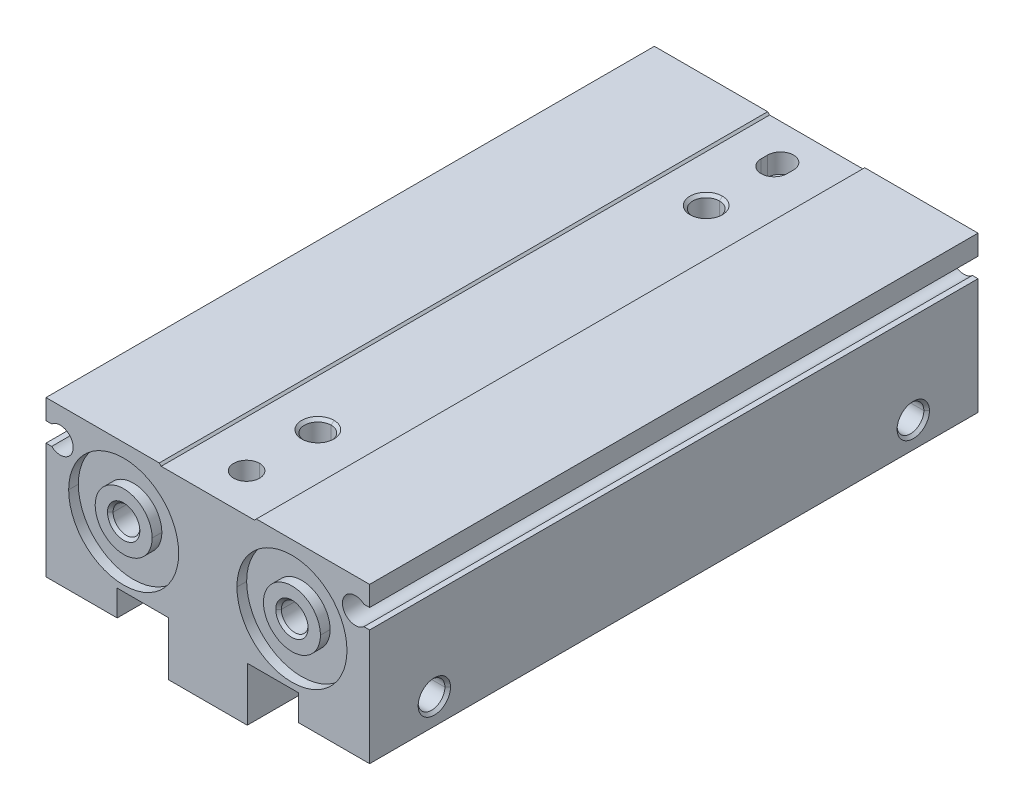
ISO-10303-21;
HEADER;
FILE_DESCRIPTION(('STEP AP214'),'2;1');
FILE_NAME('part.step','',(''),(''),'','','');
FILE_SCHEMA(('AUTOMOTIVE_DESIGN { 1 0 10303 214 1 1 1 1 }'));
ENDSEC;
DATA;
#1=APPLICATION_CONTEXT('core data for automotive mechanical design processes');
#2=APPLICATION_PROTOCOL_DEFINITION('international standard','automotive_design',2000,#1);
#3=PRODUCT_CONTEXT('',#1,'mechanical');
#4=PRODUCT('Part','Part','',(#3));
#5=PRODUCT_RELATED_PRODUCT_CATEGORY('part','',(#4));
#6=PRODUCT_DEFINITION_FORMATION('','',#4);
#7=PRODUCT_DEFINITION_CONTEXT('part definition',#1,'design');
#8=PRODUCT_DEFINITION('design','',#6,#7);
#9=PRODUCT_DEFINITION_SHAPE('','',#8);
#10=(LENGTH_UNIT() NAMED_UNIT(*) SI_UNIT(.MILLI.,.METRE.));
#11=(NAMED_UNIT(*) PLANE_ANGLE_UNIT() SI_UNIT($,.RADIAN.));
#12=(NAMED_UNIT(*) SI_UNIT($,.STERADIAN.) SOLID_ANGLE_UNIT());
#13=UNCERTAINTY_MEASURE_WITH_UNIT(LENGTH_MEASURE(1.E-05),#10,'distance_accuracy_value','');
#14=(GEOMETRIC_REPRESENTATION_CONTEXT(3) GLOBAL_UNCERTAINTY_ASSIGNED_CONTEXT((#13)) GLOBAL_UNIT_ASSIGNED_CONTEXT((#10,
#11,#12)) REPRESENTATION_CONTEXT('',''));
#15=CARTESIAN_POINT('',(0.,0.,0.));
#16=DIRECTION('',(0.,0.,1.));
#17=DIRECTION('',(1.,0.,0.));
#18=AXIS2_PLACEMENT_3D('',#15,#16,#17);
#19=CARTESIAN_POINT('',(6.1,-20.,47.));
#20=DIRECTION('',(0.,1.,0.));
#21=DIRECTION('',(0.,0.,1.));
#22=AXIS2_PLACEMENT_3D('',#19,#20,#21);
#23=PLANE('',#22);
#24=DIRECTION('',(1.,0.,0.));
#25=VECTOR('',#24,1.);
#26=CARTESIAN_POINT('',(6.1,-20.,-11.9));
#27=LINE('',#26,#25);
#28=CARTESIAN_POINT('',(6.1,-20.,-11.9));
#29=VERTEX_POINT('',#28);
#30=CARTESIAN_POINT('',(14.,-20.,-11.9));
#31=VERTEX_POINT('',#30);
#32=EDGE_CURVE('E10',#29,#31,#27,.T.);
#33=ORIENTED_EDGE('',*,*,#32,.T.);
#34=DIRECTION('',(0.,0.,-1.));
#35=VECTOR('',#34,1.);
#36=CARTESIAN_POINT('',(14.,-20.,47.));
#37=LINE('',#36,#35);
#38=CARTESIAN_POINT('',(14.,-20.,47.));
#39=VERTEX_POINT('',#38);
#40=EDGE_CURVE('E24',#39,#31,#37,.T.);
#41=ORIENTED_EDGE('',*,*,#40,.F.);
#42=DIRECTION('',(1.,0.,0.));
#43=VECTOR('',#42,1.);
#44=CARTESIAN_POINT('',(6.1,-20.,47.));
#45=LINE('',#44,#43);
#46=CARTESIAN_POINT('',(6.1,-20.,47.));
#47=VERTEX_POINT('',#46);
#48=EDGE_CURVE('E1959',#47,#39,#45,.T.);
#49=ORIENTED_EDGE('',*,*,#48,.F.);
#50=DIRECTION('',(0.,0.,-1.));
#51=VECTOR('',#50,1.);
#52=CARTESIAN_POINT('',(6.1,-20.,47.));
#53=LINE('',#52,#51);
#54=EDGE_CURVE('E1955',#47,#29,#53,.T.);
#55=ORIENTED_EDGE('',*,*,#54,.T.);
#56=EDGE_LOOP('',(#33,#41,#49,#55));
#57=FACE_BOUND('',#56,.T.);
#58=ADVANCED_FACE('F16',(#57),#23,.F.);
#59=CARTESIAN_POINT('',(6.1,-28.3,47.));
#60=DIRECTION('',(-1.,0.,0.));
#61=DIRECTION('',(0.,0.,1.));
#62=AXIS2_PLACEMENT_3D('',#59,#60,#61);
#63=PLANE('',#62);
#64=DIRECTION('',(0.,1.,0.));
#65=VECTOR('',#64,1.);
#66=CARTESIAN_POINT('',(6.1,-28.3,-47.));
#67=LINE('',#66,#65);
#68=CARTESIAN_POINT('',(6.1,-28.3,-47.));
#69=VERTEX_POINT('',#68);
#70=CARTESIAN_POINT('',(6.1,-20.,-47.));
#71=VERTEX_POINT('',#70);
#72=EDGE_CURVE('E1951',#69,#71,#67,.T.);
#73=ORIENTED_EDGE('',*,*,#72,.T.);
#74=DIRECTION('',(0.,0.,-1.));
#75=VECTOR('',#74,1.);
#76=CARTESIAN_POINT('',(6.1,-20.,47.));
#77=LINE('',#76,#75);
#78=CARTESIAN_POINT('',(6.1,-20.,-28.9));
#79=VERTEX_POINT('',#78);
#80=EDGE_CURVE('E1946',#79,#71,#77,.T.);
#81=ORIENTED_EDGE('',*,*,#80,.F.);
#82=DIRECTION('',(0.,-1.,0.));
#83=VECTOR('',#82,1.);
#84=CARTESIAN_POINT('',(6.1,-18.4,-28.9));
#85=LINE('',#84,#83);
#86=CARTESIAN_POINT('',(6.1,-18.4,-28.9));
#87=VERTEX_POINT('',#86);
#88=EDGE_CURVE('E1941',#87,#79,#85,.T.);
#89=ORIENTED_EDGE('',*,*,#88,.F.);
#90=DIRECTION('',(0.,0.,1.));
#91=VECTOR('',#90,1.);
#92=CARTESIAN_POINT('',(6.1,-18.4,-28.9));
#93=LINE('',#92,#91);
#94=CARTESIAN_POINT('',(6.1,-18.4,-11.9));
#95=VERTEX_POINT('',#94);
#96=EDGE_CURVE('E1937',#87,#95,#93,.T.);
#97=ORIENTED_EDGE('',*,*,#96,.T.);
#98=DIRECTION('',(0.,-1.,0.));
#99=VECTOR('',#98,1.);
#100=CARTESIAN_POINT('',(6.1,-18.4,-11.9));
#101=LINE('',#100,#99);
#102=EDGE_CURVE('E1932',#95,#29,#101,.T.);
#103=ORIENTED_EDGE('',*,*,#102,.T.);
#104=ORIENTED_EDGE('',*,*,#54,.F.);
#105=DIRECTION('',(0.,1.,0.));
#106=VECTOR('',#105,1.);
#107=CARTESIAN_POINT('',(6.1,-28.3,47.));
#108=LINE('',#107,#106);
#109=CARTESIAN_POINT('',(6.1,-28.3,47.));
#110=VERTEX_POINT('',#109);
#111=EDGE_CURVE('E1927',#110,#47,#108,.T.);
#112=ORIENTED_EDGE('',*,*,#111,.F.);
#113=DIRECTION('',(0.,0.,-1.));
#114=VECTOR('',#113,1.);
#115=CARTESIAN_POINT('',(6.1,-28.3,47.));
#116=LINE('',#115,#114);
#117=EDGE_CURVE('E1923',#110,#69,#116,.T.);
#118=ORIENTED_EDGE('',*,*,#117,.T.);
#119=EDGE_LOOP('',(#73,#81,#89,#97,#103,#104,#112,#118));
#120=FACE_BOUND('',#119,.T.);
#121=ADVANCED_FACE('F1975',(#120),#63,.F.);
#122=CARTESIAN_POINT('',(-6.1,-28.3,47.));
#123=DIRECTION('',(0.,1.,0.));
#124=DIRECTION('',(0.,0.,1.));
#125=AXIS2_PLACEMENT_3D('',#122,#123,#124);
#126=PLANE('',#125);
#127=CARTESIAN_POINT('',(0.,-28.3,30.));
#128=DIRECTION('',(0.,-1.,0.));
#129=DIRECTION('',(0.,0.,-1.));
#130=AXIS2_PLACEMENT_3D('',#127,#128,#129);
#131=CIRCLE('',#130,3.75);
#132=CARTESIAN_POINT('',(0.,-28.3,33.75));
#133=VERTEX_POINT('',#132);
#134=CARTESIAN_POINT('',(0.,-28.3,26.25));
#135=VERTEX_POINT('',#134);
#136=EDGE_CURVE('E1918',#133,#135,#131,.T.);
#137=ORIENTED_EDGE('',*,*,#136,.F.);
#138=CARTESIAN_POINT('',(0.,-28.3,30.));
#139=DIRECTION('',(0.,-1.,0.));
#140=DIRECTION('',(0.,0.,-1.));
#141=AXIS2_PLACEMENT_3D('',#138,#139,#140);
#142=CIRCLE('',#141,3.75);
#143=EDGE_CURVE('E1913',#135,#133,#142,.T.);
#144=ORIENTED_EDGE('',*,*,#143,.F.);
#145=EDGE_LOOP('',(#137,#144));
#146=FACE_BOUND('',#145,.T.);
#147=CARTESIAN_POINT('',(0.,-28.3,-30.));
#148=DIRECTION('',(0.,-1.,0.));
#149=DIRECTION('',(0.,0.,-1.));
#150=AXIS2_PLACEMENT_3D('',#147,#148,#149);
#151=CIRCLE('',#150,3.75);
#152=CARTESIAN_POINT('',(0.,-28.3,-26.25));
#153=VERTEX_POINT('',#152);
#154=CARTESIAN_POINT('',(0.,-28.3,-33.75));
#155=VERTEX_POINT('',#154);
#156=EDGE_CURVE('E1908',#153,#155,#151,.T.);
#157=ORIENTED_EDGE('',*,*,#156,.F.);
#158=CARTESIAN_POINT('',(0.,-28.3,-30.));
#159=DIRECTION('',(0.,-1.,0.));
#160=DIRECTION('',(0.,0.,-1.));
#161=AXIS2_PLACEMENT_3D('',#158,#159,#160);
#162=CIRCLE('',#161,3.75);
#163=EDGE_CURVE('E1903',#155,#153,#162,.T.);
#164=ORIENTED_EDGE('',*,*,#163,.F.);
#165=EDGE_LOOP('',(#157,#164));
#166=FACE_BOUND('',#165,.T.);
#167=DIRECTION('',(1.,0.,0.));
#168=VECTOR('',#167,1.);
#169=CARTESIAN_POINT('',(-6.1,-28.3,-47.));
#170=LINE('',#169,#168);
#171=CARTESIAN_POINT('',(-6.1,-28.3,-47.));
#172=VERTEX_POINT('',#171);
#173=EDGE_CURVE('E1898',#172,#69,#170,.T.);
#174=ORIENTED_EDGE('',*,*,#173,.T.);
#175=ORIENTED_EDGE('',*,*,#117,.F.);
#176=DIRECTION('',(1.,0.,0.));
#177=VECTOR('',#176,1.);
#178=CARTESIAN_POINT('',(-6.1,-28.3,47.));
#179=LINE('',#178,#177);
#180=CARTESIAN_POINT('',(-6.1,-28.3,47.));
#181=VERTEX_POINT('',#180);
#182=EDGE_CURVE('E1893',#181,#110,#179,.T.);
#183=ORIENTED_EDGE('',*,*,#182,.F.);
#184=DIRECTION('',(0.,0.,-1.));
#185=VECTOR('',#184,1.);
#186=CARTESIAN_POINT('',(-6.1,-28.3,47.));
#187=LINE('',#186,#185);
#188=EDGE_CURVE('E1889',#181,#172,#187,.T.);
#189=ORIENTED_EDGE('',*,*,#188,.T.);
#190=EDGE_LOOP('',(#174,#175,#183,#189));
#191=FACE_BOUND('',#190,.T.);
#192=ADVANCED_FACE('F2068',(#146,#166,#191),#126,.F.);
#193=CARTESIAN_POINT('',(-6.1,-20.,47.));
#194=DIRECTION('',(1.,0.,0.));
#195=DIRECTION('',(0.,0.,-1.));
#196=AXIS2_PLACEMENT_3D('',#193,#194,#195);
#197=PLANE('',#196);
#198=DIRECTION('',(0.,-1.,0.));
#199=VECTOR('',#198,1.);
#200=CARTESIAN_POINT('',(-6.1,-20.,-47.));
#201=LINE('',#200,#199);
#202=CARTESIAN_POINT('',(-6.1,-20.,-47.));
#203=VERTEX_POINT('',#202);
#204=EDGE_CURVE('E1884',#203,#172,#201,.T.);
#205=ORIENTED_EDGE('',*,*,#204,.T.);
#206=ORIENTED_EDGE('',*,*,#188,.F.);
#207=DIRECTION('',(0.,-1.,0.));
#208=VECTOR('',#207,1.);
#209=CARTESIAN_POINT('',(-6.1,-20.,47.));
#210=LINE('',#209,#208);
#211=CARTESIAN_POINT('',(-6.1,-20.,47.));
#212=VERTEX_POINT('',#211);
#213=EDGE_CURVE('E1879',#212,#181,#210,.T.);
#214=ORIENTED_EDGE('',*,*,#213,.F.);
#215=DIRECTION('',(0.,0.,-1.));
#216=VECTOR('',#215,1.);
#217=CARTESIAN_POINT('',(-6.1,-20.,47.));
#218=LINE('',#217,#216);
#219=CARTESIAN_POINT('',(-6.1,-20.,28.9));
#220=VERTEX_POINT('',#219);
#221=EDGE_CURVE('E1875',#212,#220,#218,.T.);
#222=ORIENTED_EDGE('',*,*,#221,.T.);
#223=DIRECTION('',(0.,-1.,0.));
#224=VECTOR('',#223,1.);
#225=CARTESIAN_POINT('',(-6.1,-18.4,28.9));
#226=LINE('',#225,#224);
#227=CARTESIAN_POINT('',(-6.1,-18.4,28.9));
#228=VERTEX_POINT('',#227);
#229=EDGE_CURVE('E1870',#228,#220,#226,.T.);
#230=ORIENTED_EDGE('',*,*,#229,.F.);
#231=DIRECTION('',(0.,0.,-1.));
#232=VECTOR('',#231,1.);
#233=CARTESIAN_POINT('',(-6.1,-18.4,28.9));
#234=LINE('',#233,#232);
#235=CARTESIAN_POINT('',(-6.1,-18.4,11.9));
#236=VERTEX_POINT('',#235);
#237=EDGE_CURVE('E1866',#228,#236,#234,.T.);
#238=ORIENTED_EDGE('',*,*,#237,.T.);
#239=DIRECTION('',(0.,-1.,0.));
#240=VECTOR('',#239,1.);
#241=CARTESIAN_POINT('',(-6.1,-18.4,11.9));
#242=LINE('',#241,#240);
#243=CARTESIAN_POINT('',(-6.1,-20.,11.9));
#244=VERTEX_POINT('',#243);
#245=EDGE_CURVE('E1862',#236,#244,#242,.T.);
#246=ORIENTED_EDGE('',*,*,#245,.T.);
#247=DIRECTION('',(0.,0.,-1.));
#248=VECTOR('',#247,1.);
#249=CARTESIAN_POINT('',(-6.1,-20.,47.));
#250=LINE('',#249,#248);
#251=EDGE_CURVE('E1858',#244,#203,#250,.T.);
#252=ORIENTED_EDGE('',*,*,#251,.T.);
#253=EDGE_LOOP('',(#205,#206,#214,#222,#230,#238,#246,#252));
#254=FACE_BOUND('',#253,.T.);
#255=ADVANCED_FACE('F2065',(#254),#197,.F.);
#256=CARTESIAN_POINT('',(-14.,-20.,47.));
#257=DIRECTION('',(0.,1.,0.));
#258=DIRECTION('',(0.,0.,1.));
#259=AXIS2_PLACEMENT_3D('',#256,#257,#258);
#260=PLANE('',#259);
#261=DIRECTION('',(-1.,0.,0.));
#262=VECTOR('',#261,1.);
#263=CARTESIAN_POINT('',(-6.1,-20.,11.9));
#264=LINE('',#263,#262);
#265=CARTESIAN_POINT('',(-14.,-20.,11.9));
#266=VERTEX_POINT('',#265);
#267=EDGE_CURVE('E1854',#244,#266,#264,.T.);
#268=ORIENTED_EDGE('',*,*,#267,.T.);
#269=DIRECTION('',(0.,0.,-1.));
#270=VECTOR('',#269,1.);
#271=CARTESIAN_POINT('',(-14.,-20.,47.));
#272=LINE('',#271,#270);
#273=CARTESIAN_POINT('',(-14.,-20.,-47.));
#274=VERTEX_POINT('',#273);
#275=EDGE_CURVE('E1850',#266,#274,#272,.T.);
#276=ORIENTED_EDGE('',*,*,#275,.T.);
#277=DIRECTION('',(1.,0.,0.));
#278=VECTOR('',#277,1.);
#279=CARTESIAN_POINT('',(-14.,-20.,-47.));
#280=LINE('',#279,#278);
#281=EDGE_CURVE('E1845',#274,#203,#280,.T.);
#282=ORIENTED_EDGE('',*,*,#281,.T.);
#283=ORIENTED_EDGE('',*,*,#251,.F.);
#284=EDGE_LOOP('',(#268,#276,#282,#283));
#285=FACE_BOUND('',#284,.T.);
#286=ADVANCED_FACE('F2072',(#285),#260,.F.);
#287=CARTESIAN_POINT('',(22.8,-4.6,-47.));
#288=DIRECTION('',(0.,0.,1.));
#289=DIRECTION('',(1.,0.,0.));
#290=AXIS2_PLACEMENT_3D('',#287,#288,#289);
#291=PLANE('',#290);
#292=CARTESIAN_POINT('',(-13.,-10.6,-47.));
#293=DIRECTION('',(0.,0.,1.));
#294=DIRECTION('',(1.,0.,0.));
#295=AXIS2_PLACEMENT_3D('',#292,#293,#294);
#296=CIRCLE('',#295,8.5);
#297=CARTESIAN_POINT('',(-4.5,-10.6,-47.));
#298=VERTEX_POINT('',#297);
#299=CARTESIAN_POINT('',(-21.5,-10.6,-47.));
#300=VERTEX_POINT('',#299);
#301=EDGE_CURVE('E610',#298,#300,#296,.T.);
#302=ORIENTED_EDGE('',*,*,#301,.T.);
#303=CARTESIAN_POINT('',(-13.,-10.6,-47.));
#304=DIRECTION('',(0.,0.,1.));
#305=DIRECTION('',(1.,0.,0.));
#306=AXIS2_PLACEMENT_3D('',#303,#304,#305);
#307=CIRCLE('',#306,8.5);
#308=EDGE_CURVE('E1838',#300,#298,#307,.T.);
#309=ORIENTED_EDGE('',*,*,#308,.T.);
#310=EDGE_LOOP('',(#302,#309));
#311=FACE_BOUND('',#310,.T.);
#312=CARTESIAN_POINT('',(13.,-10.6,-47.));
#313=DIRECTION('',(0.,0.,1.));
#314=DIRECTION('',(1.,0.,0.));
#315=AXIS2_PLACEMENT_3D('',#312,#313,#314);
#316=CIRCLE('',#315,8.5);
#317=CARTESIAN_POINT('',(21.5,-10.6,-47.));
#318=VERTEX_POINT('',#317);
#319=CARTESIAN_POINT('',(4.5,-10.6,-47.));
#320=VERTEX_POINT('',#319);
#321=EDGE_CURVE('E1834',#318,#320,#316,.T.);
#322=ORIENTED_EDGE('',*,*,#321,.T.);
#323=CARTESIAN_POINT('',(13.,-10.6,-47.));
#324=DIRECTION('',(0.,0.,1.));
#325=DIRECTION('',(1.,0.,0.));
#326=AXIS2_PLACEMENT_3D('',#323,#324,#325);
#327=CIRCLE('',#326,8.5);
#328=EDGE_CURVE('E1830',#320,#318,#327,.T.);
#329=ORIENTED_EDGE('',*,*,#328,.T.);
#330=EDGE_LOOP('',(#322,#329));
#331=FACE_BOUND('',#330,.T.);
#332=DIRECTION('',(-1.,0.,0.));
#333=VECTOR('',#332,1.);
#334=CARTESIAN_POINT('',(-24.122875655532,-6.1,-47.));
#335=LINE('',#334,#333);
#336=CARTESIAN_POINT('',(-24.122875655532,-6.1,-47.));
#337=VERTEX_POINT('',#336);
#338=CARTESIAN_POINT('',(-25.,-6.1,-47.));
#339=VERTEX_POINT('',#338);
#340=EDGE_CURVE('E1825',#337,#339,#335,.T.);
#341=ORIENTED_EDGE('',*,*,#340,.F.);
#342=CARTESIAN_POINT('',(-22.8,-4.6,-47.));
#343=DIRECTION('',(0.,0.,1.));
#344=DIRECTION('',(1.,0.,0.));
#345=AXIS2_PLACEMENT_3D('',#342,#343,#344);
#346=CIRCLE('',#345,1.99999999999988);
#347=CARTESIAN_POINT('',(-24.122875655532,-3.1,-47.));
#348=VERTEX_POINT('',#347);
#349=EDGE_CURVE('E1821',#337,#348,#346,.T.);
#350=ORIENTED_EDGE('',*,*,#349,.T.);
#351=DIRECTION('',(1.,0.,0.));
#352=VECTOR('',#351,1.);
#353=CARTESIAN_POINT('',(-25.,-3.1,-47.));
#354=LINE('',#353,#352);
#355=CARTESIAN_POINT('',(-25.,-3.1,-47.));
#356=VERTEX_POINT('',#355);
#357=EDGE_CURVE('E1816',#356,#348,#354,.T.);
#358=ORIENTED_EDGE('',*,*,#357,.F.);
#359=DIRECTION('',(0.,-1.,0.));
#360=VECTOR('',#359,1.);
#361=CARTESIAN_POINT('',(-25.,0.,-47.));
#362=LINE('',#361,#360);
#363=CARTESIAN_POINT('',(-25.,0.,-47.));
#364=VERTEX_POINT('',#363);
#365=EDGE_CURVE('E1811',#364,#356,#362,.T.);
#366=ORIENTED_EDGE('',*,*,#365,.F.);
#367=DIRECTION('',(-1.,0.,0.));
#368=VECTOR('',#367,1.);
#369=CARTESIAN_POINT('',(-7.5,0.,-47.));
#370=LINE('',#369,#368);
#371=CARTESIAN_POINT('',(-7.5,0.,-47.));
#372=VERTEX_POINT('',#371);
#373=EDGE_CURVE('E1806',#372,#364,#370,.T.);
#374=ORIENTED_EDGE('',*,*,#373,.F.);
#375=DIRECTION('',(-0.707106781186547,0.707106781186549,0.));
#376=VECTOR('',#375,1.);
#377=CARTESIAN_POINT('',(-7.2,-0.3,-47.));
#378=LINE('',#377,#376);
#379=CARTESIAN_POINT('',(-7.2,-0.3,-47.));
#380=VERTEX_POINT('',#379);
#381=EDGE_CURVE('E1801',#380,#372,#378,.T.);
#382=ORIENTED_EDGE('',*,*,#381,.F.);
#383=DIRECTION('',(-1.,0.,0.));
#384=VECTOR('',#383,1.);
#385=CARTESIAN_POINT('',(7.2,-0.3,-47.));
#386=LINE('',#385,#384);
#387=CARTESIAN_POINT('',(7.2,-0.3,-47.));
#388=VERTEX_POINT('',#387);
#389=EDGE_CURVE('E1796',#388,#380,#386,.T.);
#390=ORIENTED_EDGE('',*,*,#389,.F.);
#391=DIRECTION('',(-0.707106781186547,-0.707106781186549,0.));
#392=VECTOR('',#391,1.);
#393=CARTESIAN_POINT('',(7.5,0.,-47.));
#394=LINE('',#393,#392);
#395=CARTESIAN_POINT('',(7.5,0.,-47.));
#396=VERTEX_POINT('',#395);
#397=EDGE_CURVE('E1791',#396,#388,#394,.T.);
#398=ORIENTED_EDGE('',*,*,#397,.F.);
#399=DIRECTION('',(-1.,0.,0.));
#400=VECTOR('',#399,1.);
#401=CARTESIAN_POINT('',(25.,0.,-47.));
#402=LINE('',#401,#400);
#403=CARTESIAN_POINT('',(25.,0.,-47.));
#404=VERTEX_POINT('',#403);
#405=EDGE_CURVE('E1786',#404,#396,#402,.T.);
#406=ORIENTED_EDGE('',*,*,#405,.F.);
#407=DIRECTION('',(0.,1.,0.));
#408=VECTOR('',#407,1.);
#409=CARTESIAN_POINT('',(25.,-3.1,-47.));
#410=LINE('',#409,#408);
#411=CARTESIAN_POINT('',(25.,-3.1,-47.));
#412=VERTEX_POINT('',#411);
#413=EDGE_CURVE('E1781',#412,#404,#410,.T.);
#414=ORIENTED_EDGE('',*,*,#413,.F.);
#415=DIRECTION('',(1.,0.,0.));
#416=VECTOR('',#415,1.);
#417=CARTESIAN_POINT('',(24.122875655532,-3.1,-47.));
#418=LINE('',#417,#416);
#419=CARTESIAN_POINT('',(24.122875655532,-3.1,-47.));
#420=VERTEX_POINT('',#419);
#421=EDGE_CURVE('E1776',#420,#412,#418,.T.);
#422=ORIENTED_EDGE('',*,*,#421,.F.);
#423=CARTESIAN_POINT('',(22.8,-4.6,-47.));
#424=DIRECTION('',(0.,0.,1.));
#425=DIRECTION('',(1.,0.,0.));
#426=AXIS2_PLACEMENT_3D('',#423,#424,#425);
#427=CIRCLE('',#426,1.99999999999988);
#428=CARTESIAN_POINT('',(24.122875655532,-6.1,-47.));
#429=VERTEX_POINT('',#428);
#430=EDGE_CURVE('E1772',#420,#429,#427,.T.);
#431=ORIENTED_EDGE('',*,*,#430,.T.);
#432=DIRECTION('',(-1.,0.,0.));
#433=VECTOR('',#432,1.);
#434=CARTESIAN_POINT('',(25.,-6.1,-47.));
#435=LINE('',#434,#433);
#436=CARTESIAN_POINT('',(25.,-6.1,-47.));
#437=VERTEX_POINT('',#436);
#438=EDGE_CURVE('E1767',#437,#429,#435,.T.);
#439=ORIENTED_EDGE('',*,*,#438,.F.);
#440=DIRECTION('',(0.,1.,0.));
#441=VECTOR('',#440,1.);
#442=CARTESIAN_POINT('',(25.,-24.,-47.));
#443=LINE('',#442,#441);
#444=CARTESIAN_POINT('',(25.,-24.,-47.));
#445=VERTEX_POINT('',#444);
#446=EDGE_CURVE('E1762',#445,#437,#443,.T.);
#447=ORIENTED_EDGE('',*,*,#446,.F.);
#448=DIRECTION('',(1.,0.,0.));
#449=VECTOR('',#448,1.);
#450=CARTESIAN_POINT('',(14.,-24.,-47.));
#451=LINE('',#450,#449);
#452=CARTESIAN_POINT('',(14.,-24.,-47.));
#453=VERTEX_POINT('',#452);
#454=EDGE_CURVE('E1757',#453,#445,#451,.T.);
#455=ORIENTED_EDGE('',*,*,#454,.F.);
#456=DIRECTION('',(0.,-1.,0.));
#457=VECTOR('',#456,1.);
#458=CARTESIAN_POINT('',(14.,-20.,-47.));
#459=LINE('',#458,#457);
#460=CARTESIAN_POINT('',(14.,-20.,-47.));
#461=VERTEX_POINT('',#460);
#462=EDGE_CURVE('E1752',#461,#453,#459,.T.);
#463=ORIENTED_EDGE('',*,*,#462,.F.);
#464=DIRECTION('',(1.,0.,0.));
#465=VECTOR('',#464,1.);
#466=CARTESIAN_POINT('',(6.1,-20.,-47.));
#467=LINE('',#466,#465);
#468=EDGE_CURVE('E1747',#71,#461,#467,.T.);
#469=ORIENTED_EDGE('',*,*,#468,.F.);
#470=ORIENTED_EDGE('',*,*,#72,.F.);
#471=ORIENTED_EDGE('',*,*,#173,.F.);
#472=ORIENTED_EDGE('',*,*,#204,.F.);
#473=ORIENTED_EDGE('',*,*,#281,.F.);
#474=DIRECTION('',(0.,1.,0.));
#475=VECTOR('',#474,1.);
#476=CARTESIAN_POINT('',(-14.,-24.,-47.));
#477=LINE('',#476,#475);
#478=CARTESIAN_POINT('',(-14.,-24.,-47.));
#479=VERTEX_POINT('',#478);
#480=EDGE_CURVE('E1742',#479,#274,#477,.T.);
#481=ORIENTED_EDGE('',*,*,#480,.F.);
#482=DIRECTION('',(1.,0.,0.));
#483=VECTOR('',#482,1.);
#484=CARTESIAN_POINT('',(-25.,-24.,-47.));
#485=LINE('',#484,#483);
#486=CARTESIAN_POINT('',(-25.,-24.,-47.));
#487=VERTEX_POINT('',#486);
#488=EDGE_CURVE('E1737',#487,#479,#485,.T.);
#489=ORIENTED_EDGE('',*,*,#488,.F.);
#490=DIRECTION('',(0.,-1.,0.));
#491=VECTOR('',#490,1.);
#492=CARTESIAN_POINT('',(-25.,-6.1,-47.));
#493=LINE('',#492,#491);
#494=EDGE_CURVE('E1732',#339,#487,#493,.T.);
#495=ORIENTED_EDGE('',*,*,#494,.F.);
#496=EDGE_LOOP('',(#341,#350,#358,#366,#374,#382,#390,#398,#406,#414,#422,#431,#439,#447,#455,
#463,#469,#470,#471,#472,#473,#481,#489,#495));
#497=FACE_BOUND('',#496,.T.);
#498=ADVANCED_FACE('F1997',(#311,#331,#497),#291,.F.);
#499=CARTESIAN_POINT('',(-25.,-6.1,47.));
#500=DIRECTION('',(1.,0.,0.));
#501=DIRECTION('',(0.,0.,-1.));
#502=AXIS2_PLACEMENT_3D('',#499,#500,#501);
#503=PLANE('',#502);
#504=CARTESIAN_POINT('',(-25.,-20.,37.));
#505=DIRECTION('',(-1.,0.,0.));
#506=DIRECTION('',(0.,0.,1.));
#507=AXIS2_PLACEMENT_3D('',#504,#505,#506);
#508=CIRCLE('',#507,2.5);
#509=CARTESIAN_POINT('',(-25.,-20.,34.5));
#510=VERTEX_POINT('',#509);
#511=CARTESIAN_POINT('',(-25.,-20.,39.5));
#512=VERTEX_POINT('',#511);
#513=EDGE_CURVE('E1727',#510,#512,#508,.T.);
#514=ORIENTED_EDGE('',*,*,#513,.F.);
#515=CARTESIAN_POINT('',(-25.,-20.,37.));
#516=DIRECTION('',(-1.,0.,0.));
#517=DIRECTION('',(0.,0.,1.));
#518=AXIS2_PLACEMENT_3D('',#515,#516,#517);
#519=CIRCLE('',#518,2.5);
#520=EDGE_CURVE('E1722',#512,#510,#519,.T.);
#521=ORIENTED_EDGE('',*,*,#520,.F.);
#522=EDGE_LOOP('',(#514,#521));
#523=FACE_BOUND('',#522,.T.);
#524=CARTESIAN_POINT('',(-25.,-20.,-37.));
#525=DIRECTION('',(-1.,0.,0.));
#526=DIRECTION('',(0.,0.,1.));
#527=AXIS2_PLACEMENT_3D('',#524,#525,#526);
#528=CIRCLE('',#527,2.5);
#529=CARTESIAN_POINT('',(-25.,-20.,-39.5));
#530=VERTEX_POINT('',#529);
#531=CARTESIAN_POINT('',(-25.,-20.,-34.5));
#532=VERTEX_POINT('',#531);
#533=EDGE_CURVE('E1717',#530,#532,#528,.T.);
#534=ORIENTED_EDGE('',*,*,#533,.F.);
#535=CARTESIAN_POINT('',(-25.,-20.,-37.));
#536=DIRECTION('',(-1.,0.,0.));
#537=DIRECTION('',(0.,0.,1.));
#538=AXIS2_PLACEMENT_3D('',#535,#536,#537);
#539=CIRCLE('',#538,2.5);
#540=EDGE_CURVE('E1712',#532,#530,#539,.T.);
#541=ORIENTED_EDGE('',*,*,#540,.F.);
#542=EDGE_LOOP('',(#534,#541));
#543=FACE_BOUND('',#542,.T.);
#544=ORIENTED_EDGE('',*,*,#494,.T.);
#545=DIRECTION('',(0.,0.,-1.));
#546=VECTOR('',#545,1.);
#547=CARTESIAN_POINT('',(-25.,-24.,47.));
#548=LINE('',#547,#546);
#549=CARTESIAN_POINT('',(-25.,-24.,47.));
#550=VERTEX_POINT('',#549);
#551=EDGE_CURVE('E1707',#550,#487,#548,.T.);
#552=ORIENTED_EDGE('',*,*,#551,.F.);
#553=DIRECTION('',(0.,-1.,0.));
#554=VECTOR('',#553,1.);
#555=CARTESIAN_POINT('',(-25.,-6.1,47.));
#556=LINE('',#555,#554);
#557=CARTESIAN_POINT('',(-25.,-6.1,47.));
#558=VERTEX_POINT('',#557);
#559=EDGE_CURVE('E1702',#558,#550,#556,.T.);
#560=ORIENTED_EDGE('',*,*,#559,.F.);
#561=DIRECTION('',(0.,0.,-1.));
#562=VECTOR('',#561,1.);
#563=CARTESIAN_POINT('',(-25.,-6.1,47.));
#564=LINE('',#563,#562);
#565=EDGE_CURVE('E1697',#558,#339,#564,.T.);
#566=ORIENTED_EDGE('',*,*,#565,.T.);
#567=EDGE_LOOP('',(#544,#552,#560,#566));
#568=FACE_BOUND('',#567,.T.);
#569=ADVANCED_FACE('F2048',(#523,#543,#568),#503,.F.);
#570=CARTESIAN_POINT('',(-24.122875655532,-6.1,47.));
#571=DIRECTION('',(0.,-1.,0.));
#572=DIRECTION('',(0.,0.,-1.));
#573=AXIS2_PLACEMENT_3D('',#570,#571,#572);
#574=PLANE('',#573);
#575=ORIENTED_EDGE('',*,*,#340,.T.);
#576=ORIENTED_EDGE('',*,*,#565,.F.);
#577=DIRECTION('',(-1.,0.,0.));
#578=VECTOR('',#577,1.);
#579=CARTESIAN_POINT('',(-24.122875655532,-6.1,47.));
#580=LINE('',#579,#578);
#581=CARTESIAN_POINT('',(-24.122875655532,-6.1,47.));
#582=VERTEX_POINT('',#581);
#583=EDGE_CURVE('E1692',#582,#558,#580,.T.);
#584=ORIENTED_EDGE('',*,*,#583,.F.);
#585=DIRECTION('',(0.,0.,-1.));
#586=VECTOR('',#585,1.);
#587=CARTESIAN_POINT('',(-24.122875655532,-6.1,47.));
#588=LINE('',#587,#586);
#589=EDGE_CURVE('E1687',#582,#337,#588,.T.);
#590=ORIENTED_EDGE('',*,*,#589,.T.);
#591=EDGE_LOOP('',(#575,#576,#584,#590));
#592=FACE_BOUND('',#591,.T.);
#593=ADVANCED_FACE('F2046',(#592),#574,.F.);
#594=CARTESIAN_POINT('',(-22.8,-4.6,47.));
#595=DIRECTION('',(0.,0.,-1.));
#596=DIRECTION('',(-1.,0.,0.));
#597=AXIS2_PLACEMENT_3D('',#594,#595,#596);
#598=CYLINDRICAL_SURFACE('',#597,1.99999999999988);
#599=ORIENTED_EDGE('',*,*,#349,.F.);
#600=ORIENTED_EDGE('',*,*,#589,.F.);
#601=CARTESIAN_POINT('',(-22.8,-4.6,47.));
#602=DIRECTION('',(0.,0.,1.));
#603=DIRECTION('',(1.,0.,0.));
#604=AXIS2_PLACEMENT_3D('',#601,#602,#603);
#605=CIRCLE('',#604,1.99999999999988);
#606=CARTESIAN_POINT('',(-24.122875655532,-3.1,47.));
#607=VERTEX_POINT('',#606);
#608=EDGE_CURVE('E1683',#582,#607,#605,.T.);
#609=ORIENTED_EDGE('',*,*,#608,.T.);
#610=DIRECTION('',(0.,0.,-1.));
#611=VECTOR('',#610,1.);
#612=CARTESIAN_POINT('',(-24.122875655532,-3.1,47.));
#613=LINE('',#612,#611);
#614=EDGE_CURVE('E1678',#607,#348,#613,.T.);
#615=ORIENTED_EDGE('',*,*,#614,.T.);
#616=EDGE_LOOP('',(#599,#600,#609,#615));
#617=FACE_BOUND('',#616,.T.);
#618=ADVANCED_FACE('F2044',(#617),#598,.F.);
#619=CARTESIAN_POINT('',(-25.,-3.1,47.));
#620=DIRECTION('',(0.,1.,0.));
#621=DIRECTION('',(0.,0.,1.));
#622=AXIS2_PLACEMENT_3D('',#619,#620,#621);
#623=PLANE('',#622);
#624=ORIENTED_EDGE('',*,*,#357,.T.);
#625=ORIENTED_EDGE('',*,*,#614,.F.);
#626=DIRECTION('',(1.,0.,0.));
#627=VECTOR('',#626,1.);
#628=CARTESIAN_POINT('',(-25.,-3.1,47.));
#629=LINE('',#628,#627);
#630=CARTESIAN_POINT('',(-25.,-3.1,47.));
#631=VERTEX_POINT('',#630);
#632=EDGE_CURVE('E1673',#631,#607,#629,.T.);
#633=ORIENTED_EDGE('',*,*,#632,.F.);
#634=DIRECTION('',(0.,0.,-1.));
#635=VECTOR('',#634,1.);
#636=CARTESIAN_POINT('',(-25.,-3.1,47.));
#637=LINE('',#636,#635);
#638=EDGE_CURVE('E1668',#631,#356,#637,.T.);
#639=ORIENTED_EDGE('',*,*,#638,.T.);
#640=EDGE_LOOP('',(#624,#625,#633,#639));
#641=FACE_BOUND('',#640,.T.);
#642=ADVANCED_FACE('F2037',(#641),#623,.F.);
#643=CARTESIAN_POINT('',(-25.,0.,47.));
#644=DIRECTION('',(1.,0.,0.));
#645=DIRECTION('',(0.,0.,-1.));
#646=AXIS2_PLACEMENT_3D('',#643,#644,#645);
#647=PLANE('',#646);
#648=ORIENTED_EDGE('',*,*,#365,.T.);
#649=ORIENTED_EDGE('',*,*,#638,.F.);
#650=DIRECTION('',(0.,-1.,0.));
#651=VECTOR('',#650,1.);
#652=CARTESIAN_POINT('',(-25.,0.,47.));
#653=LINE('',#652,#651);
#654=CARTESIAN_POINT('',(-25.,0.,47.));
#655=VERTEX_POINT('',#654);
#656=EDGE_CURVE('E1663',#655,#631,#653,.T.);
#657=ORIENTED_EDGE('',*,*,#656,.F.);
#658=DIRECTION('',(0.,0.,-1.));
#659=VECTOR('',#658,1.);
#660=CARTESIAN_POINT('',(-25.,0.,47.));
#661=LINE('',#660,#659);
#662=EDGE_CURVE('E1658',#655,#364,#661,.T.);
#663=ORIENTED_EDGE('',*,*,#662,.T.);
#664=EDGE_LOOP('',(#648,#649,#657,#663));
#665=FACE_BOUND('',#664,.T.);
#666=ADVANCED_FACE('F2035',(#665),#647,.F.);
#667=CARTESIAN_POINT('',(-7.5,0.,47.));
#668=DIRECTION('',(0.,-1.,0.));
#669=DIRECTION('',(0.,0.,-1.));
#670=AXIS2_PLACEMENT_3D('',#667,#668,#669);
#671=PLANE('',#670);
#672=ORIENTED_EDGE('',*,*,#373,.T.);
#673=ORIENTED_EDGE('',*,*,#662,.F.);
#674=DIRECTION('',(-1.,0.,0.));
#675=VECTOR('',#674,1.);
#676=CARTESIAN_POINT('',(-7.5,0.,47.));
#677=LINE('',#676,#675);
#678=CARTESIAN_POINT('',(-7.5,0.,47.));
#679=VERTEX_POINT('',#678);
#680=EDGE_CURVE('E1653',#679,#655,#677,.T.);
#681=ORIENTED_EDGE('',*,*,#680,.F.);
#682=DIRECTION('',(0.,0.,-1.));
#683=VECTOR('',#682,1.);
#684=CARTESIAN_POINT('',(-7.5,0.,47.));
#685=LINE('',#684,#683);
#686=EDGE_CURVE('E1648',#679,#372,#685,.T.);
#687=ORIENTED_EDGE('',*,*,#686,.T.);
#688=EDGE_LOOP('',(#672,#673,#681,#687));
#689=FACE_BOUND('',#688,.T.);
#690=ADVANCED_FACE('F2033',(#689),#671,.F.);
#691=CARTESIAN_POINT('',(-7.2,-0.3,47.));
#692=DIRECTION('',(-0.707106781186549,-0.707106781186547,0.));
#693=DIRECTION('',(0.707106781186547,-0.707106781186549,0.));
#694=AXIS2_PLACEMENT_3D('',#691,#692,#693);
#695=PLANE('',#694);
#696=ORIENTED_EDGE('',*,*,#381,.T.);
#697=ORIENTED_EDGE('',*,*,#686,.F.);
#698=DIRECTION('',(-0.707106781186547,0.707106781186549,0.));
#699=VECTOR('',#698,1.);
#700=CARTESIAN_POINT('',(-7.2,-0.3,47.));
#701=LINE('',#700,#699);
#702=CARTESIAN_POINT('',(-7.2,-0.3,47.));
#703=VERTEX_POINT('',#702);
#704=EDGE_CURVE('E1643',#703,#679,#701,.T.);
#705=ORIENTED_EDGE('',*,*,#704,.F.);
#706=DIRECTION('',(0.,0.,-1.));
#707=VECTOR('',#706,1.);
#708=CARTESIAN_POINT('',(-7.2,-0.3,47.));
#709=LINE('',#708,#707);
#710=EDGE_CURVE('E1638',#703,#380,#709,.T.);
#711=ORIENTED_EDGE('',*,*,#710,.T.);
#712=EDGE_LOOP('',(#696,#697,#705,#711));
#713=FACE_BOUND('',#712,.T.);
#714=ADVANCED_FACE('F2028',(#713),#695,.F.);
#715=CARTESIAN_POINT('',(7.2,-0.3,47.));
#716=DIRECTION('',(0.,-1.,0.));
#717=DIRECTION('',(0.,0.,-1.));
#718=AXIS2_PLACEMENT_3D('',#715,#716,#717);
#719=PLANE('',#718);
#720=CARTESIAN_POINT('',(0.,-0.3,41.));
#721=DIRECTION('',(0.,1.,0.));
#722=DIRECTION('',(1.,0.,0.));
#723=AXIS2_PLACEMENT_3D('',#720,#721,#722);
#724=CIRCLE('',#723,2.);
#725=CARTESIAN_POINT('',(0.,-0.3,39.));
#726=VERTEX_POINT('',#725);
#727=CARTESIAN_POINT('',(0.,-0.3,43.));
#728=VERTEX_POINT('',#727);
#729=EDGE_CURVE('E1633',#726,#728,#724,.T.);
#730=ORIENTED_EDGE('',*,*,#729,.F.);
#731=CARTESIAN_POINT('',(0.,-0.3,41.));
#732=DIRECTION('',(0.,1.,0.));
#733=DIRECTION('',(0.,0.,1.));
#734=AXIS2_PLACEMENT_3D('',#731,#732,#733);
#735=CIRCLE('',#734,2.);
#736=EDGE_CURVE('E1628',#728,#726,#735,.T.);
#737=ORIENTED_EDGE('',*,*,#736,.F.);
#738=EDGE_LOOP('',(#730,#737));
#739=FACE_BOUND('',#738,.T.);
#740=CARTESIAN_POINT('',(0.,-0.3,-40.5));
#741=DIRECTION('',(0.,1.,0.));
#742=DIRECTION('',(1.,0.,0.));
#743=AXIS2_PLACEMENT_3D('',#740,#741,#742);
#744=CIRCLE('',#743,2.);
#745=CARTESIAN_POINT('',(-2.,-0.3,-40.5));
#746=VERTEX_POINT('',#745);
#747=CARTESIAN_POINT('',(2.,-0.3,-40.5));
#748=VERTEX_POINT('',#747);
#749=EDGE_CURVE('E1623',#746,#748,#744,.T.);
#750=ORIENTED_EDGE('',*,*,#749,.F.);
#751=DIRECTION('',(0.,0.,1.));
#752=VECTOR('',#751,1.);
#753=CARTESIAN_POINT('',(-2.,-0.3,-41.5));
#754=LINE('',#753,#752);
#755=CARTESIAN_POINT('',(-2.,-0.3,-41.5));
#756=VERTEX_POINT('',#755);
#757=EDGE_CURVE('E1618',#756,#746,#754,.T.);
#758=ORIENTED_EDGE('',*,*,#757,.F.);
#759=CARTESIAN_POINT('',(0.,-0.3,-41.5));
#760=DIRECTION('',(0.,1.,0.));
#761=DIRECTION('',(1.,0.,0.));
#762=AXIS2_PLACEMENT_3D('',#759,#760,#761);
#763=CIRCLE('',#762,2.);
#764=CARTESIAN_POINT('',(2.,-0.3,-41.5));
#765=VERTEX_POINT('',#764);
#766=EDGE_CURVE('E1613',#765,#756,#763,.T.);
#767=ORIENTED_EDGE('',*,*,#766,.F.);
#768=DIRECTION('',(0.,0.,-1.));
#769=VECTOR('',#768,1.);
#770=CARTESIAN_POINT('',(2.,-0.3,-40.5));
#771=LINE('',#770,#769);
#772=EDGE_CURVE('E1608',#748,#765,#771,.T.);
#773=ORIENTED_EDGE('',*,*,#772,.F.);
#774=EDGE_LOOP('',(#750,#758,#767,#773));
#775=FACE_BOUND('',#774,.T.);
#776=CARTESIAN_POINT('',(0.,-0.3,30.));
#777=DIRECTION('',(0.,-1.,0.));
#778=DIRECTION('',(0.,0.,-1.));
#779=AXIS2_PLACEMENT_3D('',#776,#777,#778);
#780=CIRCLE('',#779,2.5);
#781=CARTESIAN_POINT('',(0.,-0.3,27.5));
#782=VERTEX_POINT('',#781);
#783=CARTESIAN_POINT('',(0.,-0.3,32.5));
#784=VERTEX_POINT('',#783);
#785=EDGE_CURVE('E1604',#782,#784,#780,.T.);
#786=ORIENTED_EDGE('',*,*,#785,.T.);
#787=CARTESIAN_POINT('',(0.,-0.3,30.));
#788=DIRECTION('',(0.,-1.,0.));
#789=DIRECTION('',(0.,0.,-1.));
#790=AXIS2_PLACEMENT_3D('',#787,#788,#789);
#791=CIRCLE('',#790,2.5);
#792=EDGE_CURVE('E1600',#784,#782,#791,.T.);
#793=ORIENTED_EDGE('',*,*,#792,.T.);
#794=EDGE_LOOP('',(#786,#793));
#795=FACE_BOUND('',#794,.T.);
#796=CARTESIAN_POINT('',(0.,-0.3,-30.));
#797=DIRECTION('',(0.,-1.,0.));
#798=DIRECTION('',(0.,0.,-1.));
#799=AXIS2_PLACEMENT_3D('',#796,#797,#798);
#800=CIRCLE('',#799,2.5);
#801=CARTESIAN_POINT('',(0.,-0.3,-32.5));
#802=VERTEX_POINT('',#801);
#803=CARTESIAN_POINT('',(0.,-0.3,-27.5));
#804=VERTEX_POINT('',#803);
#805=EDGE_CURVE('E1596',#802,#804,#800,.T.);
#806=ORIENTED_EDGE('',*,*,#805,.T.);
#807=CARTESIAN_POINT('',(0.,-0.3,-30.));
#808=DIRECTION('',(0.,-1.,0.));
#809=DIRECTION('',(0.,0.,-1.));
#810=AXIS2_PLACEMENT_3D('',#807,#808,#809);
#811=CIRCLE('',#810,2.5);
#812=EDGE_CURVE('E1592',#804,#802,#811,.T.);
#813=ORIENTED_EDGE('',*,*,#812,.T.);
#814=EDGE_LOOP('',(#806,#813));
#815=FACE_BOUND('',#814,.T.);
#816=ORIENTED_EDGE('',*,*,#389,.T.);
#817=ORIENTED_EDGE('',*,*,#710,.F.);
#818=DIRECTION('',(-1.,0.,0.));
#819=VECTOR('',#818,1.);
#820=CARTESIAN_POINT('',(7.2,-0.3,47.));
#821=LINE('',#820,#819);
#822=CARTESIAN_POINT('',(7.2,-0.3,47.));
#823=VERTEX_POINT('',#822);
#824=EDGE_CURVE('E1587',#823,#703,#821,.T.);
#825=ORIENTED_EDGE('',*,*,#824,.F.);
#826=DIRECTION('',(0.,0.,-1.));
#827=VECTOR('',#826,1.);
#828=CARTESIAN_POINT('',(7.2,-0.3,47.));
#829=LINE('',#828,#827);
#830=EDGE_CURVE('E1582',#823,#388,#829,.T.);
#831=ORIENTED_EDGE('',*,*,#830,.T.);
#832=EDGE_LOOP('',(#816,#817,#825,#831));
#833=FACE_BOUND('',#832,.T.);
#834=ADVANCED_FACE('F2026',(#739,#775,#795,#815,#833),#719,.F.);
#835=CARTESIAN_POINT('',(7.5,0.,47.));
#836=DIRECTION('',(0.707106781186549,-0.707106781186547,0.));
#837=DIRECTION('',(0.707106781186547,0.707106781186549,0.));
#838=AXIS2_PLACEMENT_3D('',#835,#836,#837);
#839=PLANE('',#838);
#840=ORIENTED_EDGE('',*,*,#397,.T.);
#841=ORIENTED_EDGE('',*,*,#830,.F.);
#842=DIRECTION('',(-0.707106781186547,-0.707106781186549,0.));
#843=VECTOR('',#842,1.);
#844=CARTESIAN_POINT('',(7.5,0.,47.));
#845=LINE('',#844,#843);
#846=CARTESIAN_POINT('',(7.5,0.,47.));
#847=VERTEX_POINT('',#846);
#848=EDGE_CURVE('E1577',#847,#823,#845,.T.);
#849=ORIENTED_EDGE('',*,*,#848,.F.);
#850=DIRECTION('',(0.,0.,-1.));
#851=VECTOR('',#850,1.);
#852=CARTESIAN_POINT('',(7.5,0.,47.));
#853=LINE('',#852,#851);
#854=EDGE_CURVE('E1572',#847,#396,#853,.T.);
#855=ORIENTED_EDGE('',*,*,#854,.T.);
#856=EDGE_LOOP('',(#840,#841,#849,#855));
#857=FACE_BOUND('',#856,.T.);
#858=ADVANCED_FACE('F2024',(#857),#839,.F.);
#859=CARTESIAN_POINT('',(25.,0.,47.));
#860=DIRECTION('',(0.,-1.,0.));
#861=DIRECTION('',(0.,0.,-1.));
#862=AXIS2_PLACEMENT_3D('',#859,#860,#861);
#863=PLANE('',#862);
#864=ORIENTED_EDGE('',*,*,#405,.T.);
#865=ORIENTED_EDGE('',*,*,#854,.F.);
#866=DIRECTION('',(-1.,0.,0.));
#867=VECTOR('',#866,1.);
#868=CARTESIAN_POINT('',(25.,0.,47.));
#869=LINE('',#868,#867);
#870=CARTESIAN_POINT('',(25.,0.,47.));
#871=VERTEX_POINT('',#870);
#872=EDGE_CURVE('E1567',#871,#847,#869,.T.);
#873=ORIENTED_EDGE('',*,*,#872,.F.);
#874=DIRECTION('',(0.,0.,-1.));
#875=VECTOR('',#874,1.);
#876=CARTESIAN_POINT('',(25.,0.,47.));
#877=LINE('',#876,#875);
#878=EDGE_CURVE('E1562',#871,#404,#877,.T.);
#879=ORIENTED_EDGE('',*,*,#878,.T.);
#880=EDGE_LOOP('',(#864,#865,#873,#879));
#881=FACE_BOUND('',#880,.T.);
#882=ADVANCED_FACE('F2019',(#881),#863,.F.);
#883=CARTESIAN_POINT('',(25.,-3.1,47.));
#884=DIRECTION('',(-1.,0.,0.));
#885=DIRECTION('',(0.,0.,1.));
#886=AXIS2_PLACEMENT_3D('',#883,#884,#885);
#887=PLANE('',#886);
#888=ORIENTED_EDGE('',*,*,#413,.T.);
#889=ORIENTED_EDGE('',*,*,#878,.F.);
#890=DIRECTION('',(0.,1.,0.));
#891=VECTOR('',#890,1.);
#892=CARTESIAN_POINT('',(25.,-3.1,47.));
#893=LINE('',#892,#891);
#894=CARTESIAN_POINT('',(25.,-3.1,47.));
#895=VERTEX_POINT('',#894);
#896=EDGE_CURVE('E1557',#895,#871,#893,.T.);
#897=ORIENTED_EDGE('',*,*,#896,.F.);
#898=DIRECTION('',(0.,0.,-1.));
#899=VECTOR('',#898,1.);
#900=CARTESIAN_POINT('',(25.,-3.1,47.));
#901=LINE('',#900,#899);
#902=EDGE_CURVE('E1552',#895,#412,#901,.T.);
#903=ORIENTED_EDGE('',*,*,#902,.T.);
#904=EDGE_LOOP('',(#888,#889,#897,#903));
#905=FACE_BOUND('',#904,.T.);
#906=ADVANCED_FACE('F2017',(#905),#887,.F.);
#907=CARTESIAN_POINT('',(24.122875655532,-3.1,47.));
#908=DIRECTION('',(0.,1.,0.));
#909=DIRECTION('',(0.,0.,1.));
#910=AXIS2_PLACEMENT_3D('',#907,#908,#909);
#911=PLANE('',#910);
#912=ORIENTED_EDGE('',*,*,#421,.T.);
#913=ORIENTED_EDGE('',*,*,#902,.F.);
#914=DIRECTION('',(1.,0.,0.));
#915=VECTOR('',#914,1.);
#916=CARTESIAN_POINT('',(24.122875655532,-3.1,47.));
#917=LINE('',#916,#915);
#918=CARTESIAN_POINT('',(24.122875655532,-3.1,47.));
#919=VERTEX_POINT('',#918);
#920=EDGE_CURVE('E1547',#919,#895,#917,.T.);
#921=ORIENTED_EDGE('',*,*,#920,.F.);
#922=DIRECTION('',(0.,0.,-1.));
#923=VECTOR('',#922,1.);
#924=CARTESIAN_POINT('',(24.122875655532,-3.1,47.));
#925=LINE('',#924,#923);
#926=EDGE_CURVE('E1542',#919,#420,#925,.T.);
#927=ORIENTED_EDGE('',*,*,#926,.T.);
#928=EDGE_LOOP('',(#912,#913,#921,#927));
#929=FACE_BOUND('',#928,.T.);
#930=ADVANCED_FACE('F2015',(#929),#911,.F.);
#931=CARTESIAN_POINT('',(22.8,-4.6,47.));
#932=DIRECTION('',(0.,0.,-1.));
#933=DIRECTION('',(1.,0.,0.));
#934=AXIS2_PLACEMENT_3D('',#931,#932,#933);
#935=CYLINDRICAL_SURFACE('',#934,1.99999999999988);
#936=ORIENTED_EDGE('',*,*,#430,.F.);
#937=ORIENTED_EDGE('',*,*,#926,.F.);
#938=CARTESIAN_POINT('',(22.8,-4.6,47.));
#939=DIRECTION('',(0.,0.,1.));
#940=DIRECTION('',(1.,0.,0.));
#941=AXIS2_PLACEMENT_3D('',#938,#939,#940);
#942=CIRCLE('',#941,1.99999999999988);
#943=CARTESIAN_POINT('',(24.122875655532,-6.1,47.));
#944=VERTEX_POINT('',#943);
#945=EDGE_CURVE('E1538',#919,#944,#942,.T.);
#946=ORIENTED_EDGE('',*,*,#945,.T.);
#947=DIRECTION('',(0.,0.,-1.));
#948=VECTOR('',#947,1.);
#949=CARTESIAN_POINT('',(24.122875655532,-6.1,47.));
#950=LINE('',#949,#948);
#951=EDGE_CURVE('E1533',#944,#429,#950,.T.);
#952=ORIENTED_EDGE('',*,*,#951,.T.);
#953=EDGE_LOOP('',(#936,#937,#946,#952));
#954=FACE_BOUND('',#953,.T.);
#955=ADVANCED_FACE('F2010',(#954),#935,.F.);
#956=CARTESIAN_POINT('',(25.,-6.1,47.));
#957=DIRECTION('',(0.,-1.,0.));
#958=DIRECTION('',(0.,0.,-1.));
#959=AXIS2_PLACEMENT_3D('',#956,#957,#958);
#960=PLANE('',#959);
#961=ORIENTED_EDGE('',*,*,#438,.T.);
#962=ORIENTED_EDGE('',*,*,#951,.F.);
#963=DIRECTION('',(-1.,0.,0.));
#964=VECTOR('',#963,1.);
#965=CARTESIAN_POINT('',(25.,-6.1,47.));
#966=LINE('',#965,#964);
#967=CARTESIAN_POINT('',(25.,-6.1,47.));
#968=VERTEX_POINT('',#967);
#969=EDGE_CURVE('E1528',#968,#944,#966,.T.);
#970=ORIENTED_EDGE('',*,*,#969,.F.);
#971=DIRECTION('',(0.,0.,-1.));
#972=VECTOR('',#971,1.);
#973=CARTESIAN_POINT('',(25.,-6.1,47.));
#974=LINE('',#973,#972);
#975=EDGE_CURVE('E1523',#968,#437,#974,.T.);
#976=ORIENTED_EDGE('',*,*,#975,.T.);
#977=EDGE_LOOP('',(#961,#962,#970,#976));
#978=FACE_BOUND('',#977,.T.);
#979=ADVANCED_FACE('F2007',(#978),#960,.F.);
#980=CARTESIAN_POINT('',(25.,-24.,47.));
#981=DIRECTION('',(-1.,0.,0.));
#982=DIRECTION('',(0.,0.,1.));
#983=AXIS2_PLACEMENT_3D('',#980,#981,#982);
#984=PLANE('',#983);
#985=CARTESIAN_POINT('',(25.,-20.,37.));
#986=DIRECTION('',(-1.,0.,0.));
#987=DIRECTION('',(0.,0.,1.));
#988=AXIS2_PLACEMENT_3D('',#985,#986,#987);
#989=CIRCLE('',#988,2.5);
#990=CARTESIAN_POINT('',(25.,-20.,39.5));
#991=VERTEX_POINT('',#990);
#992=CARTESIAN_POINT('',(25.,-20.,34.5));
#993=VERTEX_POINT('',#992);
#994=EDGE_CURVE('E1519',#991,#993,#989,.T.);
#995=ORIENTED_EDGE('',*,*,#994,.T.);
#996=CARTESIAN_POINT('',(25.,-20.,37.));
#997=DIRECTION('',(-1.,0.,0.));
#998=DIRECTION('',(0.,0.,1.));
#999=AXIS2_PLACEMENT_3D('',#996,#997,#998);
#1000=CIRCLE('',#999,2.5);
#1001=EDGE_CURVE('E1515',#993,#991,#1000,.T.);
#1002=ORIENTED_EDGE('',*,*,#1001,.T.);
#1003=EDGE_LOOP('',(#995,#1002));
#1004=FACE_BOUND('',#1003,.T.);
#1005=CARTESIAN_POINT('',(25.,-20.,-37.));
#1006=DIRECTION('',(-1.,0.,0.));
#1007=DIRECTION('',(0.,0.,1.));
#1008=AXIS2_PLACEMENT_3D('',#1005,#1006,#1007);
#1009=CIRCLE('',#1008,2.5);
#1010=CARTESIAN_POINT('',(25.,-20.,-34.5));
#1011=VERTEX_POINT('',#1010);
#1012=CARTESIAN_POINT('',(25.,-20.,-39.5));
#1013=VERTEX_POINT('',#1012);
#1014=EDGE_CURVE('E1511',#1011,#1013,#1009,.T.);
#1015=ORIENTED_EDGE('',*,*,#1014,.T.);
#1016=CARTESIAN_POINT('',(25.,-20.,-37.));
#1017=DIRECTION('',(-1.,0.,0.));
#1018=DIRECTION('',(0.,0.,1.));
#1019=AXIS2_PLACEMENT_3D('',#1016,#1017,#1018);
#1020=CIRCLE('',#1019,2.5);
#1021=EDGE_CURVE('E1507',#1013,#1011,#1020,.T.);
#1022=ORIENTED_EDGE('',*,*,#1021,.T.);
#1023=EDGE_LOOP('',(#1015,#1022));
#1024=FACE_BOUND('',#1023,.T.);
#1025=ORIENTED_EDGE('',*,*,#446,.T.);
#1026=ORIENTED_EDGE('',*,*,#975,.F.);
#1027=DIRECTION('',(0.,1.,0.));
#1028=VECTOR('',#1027,1.);
#1029=CARTESIAN_POINT('',(25.,-24.,47.));
#1030=LINE('',#1029,#1028);
#1031=CARTESIAN_POINT('',(25.,-24.,47.));
#1032=VERTEX_POINT('',#1031);
#1033=EDGE_CURVE('E1502',#1032,#968,#1030,.T.);
#1034=ORIENTED_EDGE('',*,*,#1033,.F.);
#1035=DIRECTION('',(0.,0.,-1.));
#1036=VECTOR('',#1035,1.);
#1037=CARTESIAN_POINT('',(25.,-24.,47.));
#1038=LINE('',#1037,#1036);
#1039=EDGE_CURVE('E1497',#1032,#445,#1038,.T.);
#1040=ORIENTED_EDGE('',*,*,#1039,.T.);
#1041=EDGE_LOOP('',(#1025,#1026,#1034,#1040));
#1042=FACE_BOUND('',#1041,.T.);
#1043=ADVANCED_FACE('F2005',(#1004,#1024,#1042),#984,.F.);
#1044=CARTESIAN_POINT('',(14.,-24.,47.));
#1045=DIRECTION('',(0.,1.,0.));
#1046=DIRECTION('',(0.,0.,1.));
#1047=AXIS2_PLACEMENT_3D('',#1044,#1045,#1046);
#1048=PLANE('',#1047);
#1049=CARTESIAN_POINT('',(21.5,-24.,29.));
#1050=DIRECTION('',(0.,1.,0.));
#1051=DIRECTION('',(0.,0.,1.));
#1052=AXIS2_PLACEMENT_3D('',#1049,#1050,#1051);
#1053=CIRCLE('',#1052,2.5);
#1054=CARTESIAN_POINT('',(21.5,-24.,31.5));
#1055=VERTEX_POINT('',#1054);
#1056=CARTESIAN_POINT('',(21.5,-24.,26.5));
#1057=VERTEX_POINT('',#1056);
#1058=EDGE_CURVE('E1493',#1055,#1057,#1053,.T.);
#1059=ORIENTED_EDGE('',*,*,#1058,.T.);
#1060=CARTESIAN_POINT('',(21.5,-24.,29.));
#1061=DIRECTION('',(0.,1.,0.));
#1062=DIRECTION('',(0.,0.,1.));
#1063=AXIS2_PLACEMENT_3D('',#1060,#1061,#1062);
#1064=CIRCLE('',#1063,2.5);
#1065=EDGE_CURVE('E1489',#1057,#1055,#1064,.T.);
#1066=ORIENTED_EDGE('',*,*,#1065,.T.);
#1067=EDGE_LOOP('',(#1059,#1066));
#1068=FACE_BOUND('',#1067,.T.);
#1069=CARTESIAN_POINT('',(21.5,-24.,-29.));
#1070=DIRECTION('',(0.,1.,0.));
#1071=DIRECTION('',(0.,0.,1.));
#1072=AXIS2_PLACEMENT_3D('',#1069,#1070,#1071);
#1073=CIRCLE('',#1072,2.5);
#1074=CARTESIAN_POINT('',(21.5,-24.,-26.5));
#1075=VERTEX_POINT('',#1074);
#1076=CARTESIAN_POINT('',(21.5,-24.,-31.5));
#1077=VERTEX_POINT('',#1076);
#1078=EDGE_CURVE('E1485',#1075,#1077,#1073,.T.);
#1079=ORIENTED_EDGE('',*,*,#1078,.T.);
#1080=CARTESIAN_POINT('',(21.5,-24.,-29.));
#1081=DIRECTION('',(0.,1.,0.));
#1082=DIRECTION('',(0.,0.,1.));
#1083=AXIS2_PLACEMENT_3D('',#1080,#1081,#1082);
#1084=CIRCLE('',#1083,2.5);
#1085=EDGE_CURVE('E1481',#1077,#1075,#1084,.T.);
#1086=ORIENTED_EDGE('',*,*,#1085,.T.);
#1087=EDGE_LOOP('',(#1079,#1086));
#1088=FACE_BOUND('',#1087,.T.);
#1089=ORIENTED_EDGE('',*,*,#454,.T.);
#1090=ORIENTED_EDGE('',*,*,#1039,.F.);
#1091=DIRECTION('',(1.,0.,0.));
#1092=VECTOR('',#1091,1.);
#1093=CARTESIAN_POINT('',(14.,-24.,47.));
#1094=LINE('',#1093,#1092);
#1095=CARTESIAN_POINT('',(14.,-24.,47.));
#1096=VERTEX_POINT('',#1095);
#1097=EDGE_CURVE('E1476',#1096,#1032,#1094,.T.);
#1098=ORIENTED_EDGE('',*,*,#1097,.F.);
#1099=DIRECTION('',(0.,0.,-1.));
#1100=VECTOR('',#1099,1.);
#1101=CARTESIAN_POINT('',(14.,-24.,47.));
#1102=LINE('',#1101,#1100);
#1103=EDGE_CURVE('E1471',#1096,#453,#1102,.T.);
#1104=ORIENTED_EDGE('',*,*,#1103,.T.);
#1105=EDGE_LOOP('',(#1089,#1090,#1098,#1104));
#1106=FACE_BOUND('',#1105,.T.);
#1107=ADVANCED_FACE('F2000',(#1068,#1088,#1106),#1048,.F.);
#1108=CARTESIAN_POINT('',(14.,-20.,47.));
#1109=DIRECTION('',(1.,0.,0.));
#1110=DIRECTION('',(0.,0.,-1.));
#1111=AXIS2_PLACEMENT_3D('',#1108,#1109,#1110);
#1112=PLANE('',#1111);
#1113=ORIENTED_EDGE('',*,*,#462,.T.);
#1114=ORIENTED_EDGE('',*,*,#1103,.F.);
#1115=DIRECTION('',(0.,-1.,0.));
#1116=VECTOR('',#1115,1.);
#1117=CARTESIAN_POINT('',(14.,-20.,47.));
#1118=LINE('',#1117,#1116);
#1119=EDGE_CURVE('E1466',#39,#1096,#1118,.T.);
#1120=ORIENTED_EDGE('',*,*,#1119,.F.);
#1121=ORIENTED_EDGE('',*,*,#40,.T.);
#1122=DIRECTION('',(0.,-1.,0.));
#1123=VECTOR('',#1122,1.);
#1124=CARTESIAN_POINT('',(14.,-18.4,-11.9));
#1125=LINE('',#1124,#1123);
#1126=CARTESIAN_POINT('',(14.,-18.4,-11.9));
#1127=VERTEX_POINT('',#1126);
#1128=EDGE_CURVE('E1462',#1127,#31,#1125,.T.);
#1129=ORIENTED_EDGE('',*,*,#1128,.F.);
#1130=DIRECTION('',(0.,0.,-1.));
#1131=VECTOR('',#1130,1.);
#1132=CARTESIAN_POINT('',(14.,-18.4,-11.9));
#1133=LINE('',#1132,#1131);
#1134=CARTESIAN_POINT('',(14.,-18.4,-28.9));
#1135=VERTEX_POINT('',#1134);
#1136=EDGE_CURVE('E1458',#1127,#1135,#1133,.T.);
#1137=ORIENTED_EDGE('',*,*,#1136,.T.);
#1138=DIRECTION('',(0.,-1.,0.));
#1139=VECTOR('',#1138,1.);
#1140=CARTESIAN_POINT('',(14.,-18.4,-28.9));
#1141=LINE('',#1140,#1139);
#1142=CARTESIAN_POINT('',(14.,-20.,-28.9));
#1143=VERTEX_POINT('',#1142);
#1144=EDGE_CURVE('E1454',#1135,#1143,#1141,.T.);
#1145=ORIENTED_EDGE('',*,*,#1144,.T.);
#1146=DIRECTION('',(0.,0.,-1.));
#1147=VECTOR('',#1146,1.);
#1148=CARTESIAN_POINT('',(14.,-20.,47.));
#1149=LINE('',#1148,#1147);
#1150=EDGE_CURVE('E1449',#1143,#461,#1149,.T.);
#1151=ORIENTED_EDGE('',*,*,#1150,.T.);
#1152=EDGE_LOOP('',(#1113,#1114,#1120,#1121,#1129,#1137,#1145,#1151));
#1153=FACE_BOUND('',#1152,.T.);
#1154=ADVANCED_FACE('F1969',(#1153),#1112,.F.);
#1155=CARTESIAN_POINT('',(6.1,-20.,47.));
#1156=DIRECTION('',(0.,1.,0.));
#1157=DIRECTION('',(0.,0.,1.));
#1158=AXIS2_PLACEMENT_3D('',#1155,#1156,#1157);
#1159=PLANE('',#1158);
#1160=DIRECTION('',(-1.,0.,0.));
#1161=VECTOR('',#1160,1.);
#1162=CARTESIAN_POINT('',(14.,-20.,-28.9));
#1163=LINE('',#1162,#1161);
#1164=EDGE_CURVE('E1444',#1143,#79,#1163,.T.);
#1165=ORIENTED_EDGE('',*,*,#1164,.T.);
#1166=ORIENTED_EDGE('',*,*,#80,.T.);
#1167=ORIENTED_EDGE('',*,*,#468,.T.);
#1168=ORIENTED_EDGE('',*,*,#1150,.F.);
#1169=EDGE_LOOP('',(#1165,#1166,#1167,#1168));
#1170=FACE_BOUND('',#1169,.T.);
#1171=ADVANCED_FACE('F1990',(#1170),#1159,.F.);
#1172=CARTESIAN_POINT('',(14.,-18.4,-28.9));
#1173=DIRECTION('',(0.,0.,1.));
#1174=DIRECTION('',(1.,0.,0.));
#1175=AXIS2_PLACEMENT_3D('',#1172,#1173,#1174);
#1176=PLANE('',#1175);
#1177=ORIENTED_EDGE('',*,*,#1164,.F.);
#1178=ORIENTED_EDGE('',*,*,#1144,.F.);
#1179=DIRECTION('',(-1.,0.,0.));
#1180=VECTOR('',#1179,1.);
#1181=CARTESIAN_POINT('',(14.,-18.4,-28.9));
#1182=LINE('',#1181,#1180);
#1183=EDGE_CURVE('E1439',#1135,#87,#1182,.T.);
#1184=ORIENTED_EDGE('',*,*,#1183,.T.);
#1185=ORIENTED_EDGE('',*,*,#88,.T.);
#1186=EDGE_LOOP('',(#1177,#1178,#1184,#1185));
#1187=FACE_BOUND('',#1186,.T.);
#1188=ADVANCED_FACE('F1992',(#1187),#1176,.T.);
#1189=CARTESIAN_POINT('',(0.,-18.4,0.));
#1190=DIRECTION('',(0.,1.,0.));
#1191=DIRECTION('',(0.,0.,1.));
#1192=AXIS2_PLACEMENT_3D('',#1189,#1190,#1191);
#1193=PLANE('',#1192);
#1194=ORIENTED_EDGE('',*,*,#96,.F.);
#1195=ORIENTED_EDGE('',*,*,#1183,.F.);
#1196=ORIENTED_EDGE('',*,*,#1136,.F.);
#1197=DIRECTION('',(1.,0.,0.));
#1198=VECTOR('',#1197,1.);
#1199=CARTESIAN_POINT('',(6.1,-18.4,-11.9));
#1200=LINE('',#1199,#1198);
#1201=EDGE_CURVE('E1434',#95,#1127,#1200,.T.);
#1202=ORIENTED_EDGE('',*,*,#1201,.F.);
#1203=EDGE_LOOP('',(#1194,#1195,#1196,#1202));
#1204=FACE_BOUND('',#1203,.T.);
#1205=ADVANCED_FACE('F1984',(#1204),#1193,.F.);
#1206=CARTESIAN_POINT('',(6.1,-18.4,-11.9));
#1207=DIRECTION('',(0.,0.,-1.));
#1208=DIRECTION('',(-1.,0.,0.));
#1209=AXIS2_PLACEMENT_3D('',#1206,#1207,#1208);
#1210=PLANE('',#1209);
#1211=ORIENTED_EDGE('',*,*,#32,.F.);
#1212=ORIENTED_EDGE('',*,*,#102,.F.);
#1213=ORIENTED_EDGE('',*,*,#1201,.T.);
#1214=ORIENTED_EDGE('',*,*,#1128,.T.);
#1215=EDGE_LOOP('',(#1211,#1212,#1213,#1214));
#1216=FACE_BOUND('',#1215,.T.);
#1217=ADVANCED_FACE('F1980',(#1216),#1210,.T.);
#1218=CARTESIAN_POINT('',(22.8,-4.6,47.));
#1219=DIRECTION('',(0.,0.,1.));
#1220=DIRECTION('',(1.,0.,0.));
#1221=AXIS2_PLACEMENT_3D('',#1218,#1219,#1220);
#1222=PLANE('',#1221);
#1223=CARTESIAN_POINT('',(-13.,-10.6,47.));
#1224=DIRECTION('',(0.,0.,1.));
#1225=DIRECTION('',(1.,0.,0.));
#1226=AXIS2_PLACEMENT_3D('',#1223,#1224,#1225);
#1227=CIRCLE('',#1226,8.5);
#1228=CARTESIAN_POINT('',(-21.5,-10.6,47.));
#1229=VERTEX_POINT('',#1228);
#1230=CARTESIAN_POINT('',(-4.5,-10.6,47.));
#1231=VERTEX_POINT('',#1230);
#1232=EDGE_CURVE('E1429',#1229,#1231,#1227,.T.);
#1233=ORIENTED_EDGE('',*,*,#1232,.F.);
#1234=CARTESIAN_POINT('',(-13.,-10.6,47.));
#1235=DIRECTION('',(0.,0.,1.));
#1236=DIRECTION('',(1.,0.,0.));
#1237=AXIS2_PLACEMENT_3D('',#1234,#1235,#1236);
#1238=CIRCLE('',#1237,8.5);
#1239=EDGE_CURVE('E1424',#1231,#1229,#1238,.T.);
#1240=ORIENTED_EDGE('',*,*,#1239,.F.);
#1241=EDGE_LOOP('',(#1233,#1240));
#1242=FACE_BOUND('',#1241,.T.);
#1243=CARTESIAN_POINT('',(13.,-10.6,47.));
#1244=DIRECTION('',(0.,0.,1.));
#1245=DIRECTION('',(1.,0.,0.));
#1246=AXIS2_PLACEMENT_3D('',#1243,#1244,#1245);
#1247=CIRCLE('',#1246,8.5);
#1248=CARTESIAN_POINT('',(4.5,-10.6,47.));
#1249=VERTEX_POINT('',#1248);
#1250=CARTESIAN_POINT('',(21.5,-10.6,47.));
#1251=VERTEX_POINT('',#1250);
#1252=EDGE_CURVE('E1419',#1249,#1251,#1247,.T.);
#1253=ORIENTED_EDGE('',*,*,#1252,.F.);
#1254=CARTESIAN_POINT('',(13.,-10.6,47.));
#1255=DIRECTION('',(0.,0.,1.));
#1256=DIRECTION('',(1.,0.,0.));
#1257=AXIS2_PLACEMENT_3D('',#1254,#1255,#1256);
#1258=CIRCLE('',#1257,8.5);
#1259=EDGE_CURVE('E1414',#1251,#1249,#1258,.T.);
#1260=ORIENTED_EDGE('',*,*,#1259,.F.);
#1261=EDGE_LOOP('',(#1253,#1260));
#1262=FACE_BOUND('',#1261,.T.);
#1263=ORIENTED_EDGE('',*,*,#583,.T.);
#1264=ORIENTED_EDGE('',*,*,#559,.T.);
#1265=DIRECTION('',(1.,0.,0.));
#1266=VECTOR('',#1265,1.);
#1267=CARTESIAN_POINT('',(-25.,-24.,47.));
#1268=LINE('',#1267,#1266);
#1269=CARTESIAN_POINT('',(-14.,-24.,47.));
#1270=VERTEX_POINT('',#1269);
#1271=EDGE_CURVE('E1410',#550,#1270,#1268,.T.);
#1272=ORIENTED_EDGE('',*,*,#1271,.T.);
#1273=DIRECTION('',(0.,1.,0.));
#1274=VECTOR('',#1273,1.);
#1275=CARTESIAN_POINT('',(-14.,-24.,47.));
#1276=LINE('',#1275,#1274);
#1277=CARTESIAN_POINT('',(-14.,-20.,47.));
#1278=VERTEX_POINT('',#1277);
#1279=EDGE_CURVE('E1406',#1270,#1278,#1276,.T.);
#1280=ORIENTED_EDGE('',*,*,#1279,.T.);
#1281=DIRECTION('',(1.,0.,0.));
#1282=VECTOR('',#1281,1.);
#1283=CARTESIAN_POINT('',(-14.,-20.,47.));
#1284=LINE('',#1283,#1282);
#1285=EDGE_CURVE('E1401',#1278,#212,#1284,.T.);
#1286=ORIENTED_EDGE('',*,*,#1285,.T.);
#1287=ORIENTED_EDGE('',*,*,#213,.T.);
#1288=ORIENTED_EDGE('',*,*,#182,.T.);
#1289=ORIENTED_EDGE('',*,*,#111,.T.);
#1290=ORIENTED_EDGE('',*,*,#48,.T.);
#1291=ORIENTED_EDGE('',*,*,#1119,.T.);
#1292=ORIENTED_EDGE('',*,*,#1097,.T.);
#1293=ORIENTED_EDGE('',*,*,#1033,.T.);
#1294=ORIENTED_EDGE('',*,*,#969,.T.);
#1295=ORIENTED_EDGE('',*,*,#945,.F.);
#1296=ORIENTED_EDGE('',*,*,#920,.T.);
#1297=ORIENTED_EDGE('',*,*,#896,.T.);
#1298=ORIENTED_EDGE('',*,*,#872,.T.);
#1299=ORIENTED_EDGE('',*,*,#848,.T.);
#1300=ORIENTED_EDGE('',*,*,#824,.T.);
#1301=ORIENTED_EDGE('',*,*,#704,.T.);
#1302=ORIENTED_EDGE('',*,*,#680,.T.);
#1303=ORIENTED_EDGE('',*,*,#656,.T.);
#1304=ORIENTED_EDGE('',*,*,#632,.T.);
#1305=ORIENTED_EDGE('',*,*,#608,.F.);
#1306=EDGE_LOOP('',(#1263,#1264,#1272,#1280,#1286,#1287,#1288,#1289,#1290,#1291,#1292,#1293,
#1294,#1295,#1296,#1297,#1298,#1299,#1300,#1301,#1302,#1303,#1304,#1305));
#1307=FACE_BOUND('',#1306,.T.);
#1308=ADVANCED_FACE('F1972',(#1242,#1262,#1307),#1222,.T.);
#1309=CARTESIAN_POINT('',(-14.,-20.,47.));
#1310=DIRECTION('',(0.,1.,0.));
#1311=DIRECTION('',(0.,0.,1.));
#1312=AXIS2_PLACEMENT_3D('',#1309,#1310,#1311);
#1313=PLANE('',#1312);
#1314=DIRECTION('',(1.,0.,0.));
#1315=VECTOR('',#1314,1.);
#1316=CARTESIAN_POINT('',(-14.,-20.,28.9));
#1317=LINE('',#1316,#1315);
#1318=CARTESIAN_POINT('',(-14.,-20.,28.9));
#1319=VERTEX_POINT('',#1318);
#1320=EDGE_CURVE('E1396',#1319,#220,#1317,.T.);
#1321=ORIENTED_EDGE('',*,*,#1320,.T.);
#1322=ORIENTED_EDGE('',*,*,#221,.F.);
#1323=ORIENTED_EDGE('',*,*,#1285,.F.);
#1324=DIRECTION('',(0.,0.,-1.));
#1325=VECTOR('',#1324,1.);
#1326=CARTESIAN_POINT('',(-14.,-20.,47.));
#1327=LINE('',#1326,#1325);
#1328=EDGE_CURVE('E1392',#1278,#1319,#1327,.T.);
#1329=ORIENTED_EDGE('',*,*,#1328,.T.);
#1330=EDGE_LOOP('',(#1321,#1322,#1323,#1329));
#1331=FACE_BOUND('',#1330,.T.);
#1332=ADVANCED_FACE('F2061',(#1331),#1313,.F.);
#1333=CARTESIAN_POINT('',(-14.,-24.,47.));
#1334=DIRECTION('',(-1.,0.,0.));
#1335=DIRECTION('',(0.,0.,1.));
#1336=AXIS2_PLACEMENT_3D('',#1333,#1334,#1335);
#1337=PLANE('',#1336);
#1338=ORIENTED_EDGE('',*,*,#480,.T.);
#1339=ORIENTED_EDGE('',*,*,#275,.F.);
#1340=DIRECTION('',(0.,-1.,0.));
#1341=VECTOR('',#1340,1.);
#1342=CARTESIAN_POINT('',(-14.,-18.4,11.9));
#1343=LINE('',#1342,#1341);
#1344=CARTESIAN_POINT('',(-14.,-18.4,11.9));
#1345=VERTEX_POINT('',#1344);
#1346=EDGE_CURVE('E1387',#1345,#266,#1343,.T.);
#1347=ORIENTED_EDGE('',*,*,#1346,.F.);
#1348=DIRECTION('',(0.,0.,1.));
#1349=VECTOR('',#1348,1.);
#1350=CARTESIAN_POINT('',(-14.,-18.4,11.9));
#1351=LINE('',#1350,#1349);
#1352=CARTESIAN_POINT('',(-14.,-18.4,28.9));
#1353=VERTEX_POINT('',#1352);
#1354=EDGE_CURVE('E1383',#1345,#1353,#1351,.T.);
#1355=ORIENTED_EDGE('',*,*,#1354,.T.);
#1356=DIRECTION('',(0.,-1.,0.));
#1357=VECTOR('',#1356,1.);
#1358=CARTESIAN_POINT('',(-14.,-18.4,28.9));
#1359=LINE('',#1358,#1357);
#1360=EDGE_CURVE('E1378',#1353,#1319,#1359,.T.);
#1361=ORIENTED_EDGE('',*,*,#1360,.T.);
#1362=ORIENTED_EDGE('',*,*,#1328,.F.);
#1363=ORIENTED_EDGE('',*,*,#1279,.F.);
#1364=DIRECTION('',(0.,0.,-1.));
#1365=VECTOR('',#1364,1.);
#1366=CARTESIAN_POINT('',(-14.,-24.,47.));
#1367=LINE('',#1366,#1365);
#1368=EDGE_CURVE('E1373',#1270,#479,#1367,.T.);
#1369=ORIENTED_EDGE('',*,*,#1368,.T.);
#1370=EDGE_LOOP('',(#1338,#1339,#1347,#1355,#1361,#1362,#1363,#1369));
#1371=FACE_BOUND('',#1370,.T.);
#1372=ADVANCED_FACE('F2057',(#1371),#1337,.F.);
#1373=CARTESIAN_POINT('',(-25.,-24.,47.));
#1374=DIRECTION('',(0.,1.,0.));
#1375=DIRECTION('',(0.,0.,1.));
#1376=AXIS2_PLACEMENT_3D('',#1373,#1374,#1375);
#1377=PLANE('',#1376);
#1378=CARTESIAN_POINT('',(-21.5,-24.,-29.));
#1379=DIRECTION('',(0.,1.,0.));
#1380=DIRECTION('',(0.,0.,1.));
#1381=AXIS2_PLACEMENT_3D('',#1378,#1379,#1380);
#1382=CIRCLE('',#1381,2.5);
#1383=CARTESIAN_POINT('',(-21.5,-24.,-26.5));
#1384=VERTEX_POINT('',#1383);
#1385=CARTESIAN_POINT('',(-21.5,-24.,-31.5));
#1386=VERTEX_POINT('',#1385);
#1387=EDGE_CURVE('E1369',#1384,#1386,#1382,.T.);
#1388=ORIENTED_EDGE('',*,*,#1387,.T.);
#1389=CARTESIAN_POINT('',(-21.5,-24.,-29.));
#1390=DIRECTION('',(0.,1.,0.));
#1391=DIRECTION('',(0.,0.,1.));
#1392=AXIS2_PLACEMENT_3D('',#1389,#1390,#1391);
#1393=CIRCLE('',#1392,2.5);
#1394=EDGE_CURVE('E1365',#1386,#1384,#1393,.T.);
#1395=ORIENTED_EDGE('',*,*,#1394,.T.);
#1396=EDGE_LOOP('',(#1388,#1395));
#1397=FACE_BOUND('',#1396,.T.);
#1398=CARTESIAN_POINT('',(-21.5,-24.,29.));
#1399=DIRECTION('',(0.,1.,0.));
#1400=DIRECTION('',(0.,0.,1.));
#1401=AXIS2_PLACEMENT_3D('',#1398,#1399,#1400);
#1402=CIRCLE('',#1401,2.5);
#1403=CARTESIAN_POINT('',(-21.5,-24.,31.5));
#1404=VERTEX_POINT('',#1403);
#1405=CARTESIAN_POINT('',(-21.5,-24.,26.5));
#1406=VERTEX_POINT('',#1405);
#1407=EDGE_CURVE('E1361',#1404,#1406,#1402,.T.);
#1408=ORIENTED_EDGE('',*,*,#1407,.T.);
#1409=CARTESIAN_POINT('',(-21.5,-24.,29.));
#1410=DIRECTION('',(0.,1.,0.));
#1411=DIRECTION('',(0.,0.,1.));
#1412=AXIS2_PLACEMENT_3D('',#1409,#1410,#1411);
#1413=CIRCLE('',#1412,2.5);
#1414=EDGE_CURVE('E1357',#1406,#1404,#1413,.T.);
#1415=ORIENTED_EDGE('',*,*,#1414,.T.);
#1416=EDGE_LOOP('',(#1408,#1415));
#1417=FACE_BOUND('',#1416,.T.);
#1418=ORIENTED_EDGE('',*,*,#488,.T.);
#1419=ORIENTED_EDGE('',*,*,#1368,.F.);
#1420=ORIENTED_EDGE('',*,*,#1271,.F.);
#1421=ORIENTED_EDGE('',*,*,#551,.T.);
#1422=EDGE_LOOP('',(#1418,#1419,#1420,#1421));
#1423=FACE_BOUND('',#1422,.T.);
#1424=ADVANCED_FACE('F2054',(#1397,#1417,#1423),#1377,.F.);
#1425=CARTESIAN_POINT('',(-21.5,-24.,29.));
#1426=DIRECTION('',(0.,-1.,0.));
#1427=DIRECTION('',(1.,0.,0.));
#1428=AXIS2_PLACEMENT_3D('',#1425,#1426,#1427);
#1429=CONICAL_SURFACE('',#1428,2.5,0.785398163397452);
#1430=DIRECTION('',(0.,-0.707106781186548,0.707106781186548));
#1431=VECTOR('',#1430,1.);
#1432=CARTESIAN_POINT('',(-21.5,-23.567,31.067));
#1433=LINE('',#1432,#1431);
#1434=CARTESIAN_POINT('',(-21.5,-23.567,31.067));
#1435=VERTEX_POINT('',#1434);
#1436=EDGE_CURVE('E1352',#1435,#1404,#1433,.T.);
#1437=ORIENTED_EDGE('',*,*,#1436,.T.);
#1438=ORIENTED_EDGE('',*,*,#1414,.F.);
#1439=DIRECTION('',(0.,-0.707106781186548,-0.707106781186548));
#1440=VECTOR('',#1439,1.);
#1441=CARTESIAN_POINT('',(-21.5,-23.567,26.933));
#1442=LINE('',#1441,#1440);
#1443=CARTESIAN_POINT('',(-21.5,-23.567,26.933));
#1444=VERTEX_POINT('',#1443);
#1445=EDGE_CURVE('E1347',#1444,#1406,#1442,.T.);
#1446=ORIENTED_EDGE('',*,*,#1445,.F.);
#1447=CARTESIAN_POINT('',(-21.5,-23.567,29.));
#1448=DIRECTION('',(0.,1.,0.));
#1449=DIRECTION('',(0.,0.,1.));
#1450=AXIS2_PLACEMENT_3D('',#1447,#1448,#1449);
#1451=CIRCLE('',#1450,2.067);
#1452=EDGE_CURVE('E1343',#1444,#1435,#1451,.T.);
#1453=ORIENTED_EDGE('',*,*,#1452,.T.);
#1454=EDGE_LOOP('',(#1437,#1438,#1446,#1453));
#1455=FACE_BOUND('',#1454,.T.);
#1456=ADVANCED_FACE('F2170',(#1455),#1429,.F.);
#1457=CARTESIAN_POINT('',(-21.5,-18.5,29.));
#1458=DIRECTION('',(0.,1.,0.));
#1459=DIRECTION('',(1.,0.,0.));
#1460=AXIS2_PLACEMENT_3D('',#1457,#1458,#1459);
#1461=CYLINDRICAL_SURFACE('',#1460,2.067);
#1462=DIRECTION('',(0.,1.,0.));
#1463=VECTOR('',#1462,1.);
#1464=CARTESIAN_POINT('',(-21.5,-23.567,26.933));
#1465=LINE('',#1464,#1463);
#1466=CARTESIAN_POINT('',(-21.5,-18.5,26.933));
#1467=VERTEX_POINT('',#1466);
#1468=EDGE_CURVE('E1339',#1444,#1467,#1465,.T.);
#1469=ORIENTED_EDGE('',*,*,#1468,.T.);
#1470=CARTESIAN_POINT('',(-21.5,-18.5,29.));
#1471=DIRECTION('',(0.,1.,0.));
#1472=DIRECTION('',(0.,0.,1.));
#1473=AXIS2_PLACEMENT_3D('',#1470,#1471,#1472);
#1474=CIRCLE('',#1473,2.067);
#1475=CARTESIAN_POINT('',(-21.5,-18.5,31.067));
#1476=VERTEX_POINT('',#1475);
#1477=EDGE_CURVE('E1335',#1467,#1476,#1474,.T.);
#1478=ORIENTED_EDGE('',*,*,#1477,.T.);
#1479=DIRECTION('',(0.,1.,0.));
#1480=VECTOR('',#1479,1.);
#1481=CARTESIAN_POINT('',(-21.5,-23.567,31.067));
#1482=LINE('',#1481,#1480);
#1483=EDGE_CURVE('E1330',#1435,#1476,#1482,.T.);
#1484=ORIENTED_EDGE('',*,*,#1483,.F.);
#1485=ORIENTED_EDGE('',*,*,#1452,.F.);
#1486=EDGE_LOOP('',(#1469,#1478,#1484,#1485));
#1487=FACE_BOUND('',#1486,.T.);
#1488=ADVANCED_FACE('F2174',(#1487),#1461,.F.);
#1489=CARTESIAN_POINT('',(-21.5,-18.5,29.));
#1490=DIRECTION('',(0.,1.,0.));
#1491=DIRECTION('',(-1.,0.,0.));
#1492=AXIS2_PLACEMENT_3D('',#1489,#1490,#1491);
#1493=CYLINDRICAL_SURFACE('',#1492,2.067);
#1494=ORIENTED_EDGE('',*,*,#1468,.F.);
#1495=CARTESIAN_POINT('',(-21.5,-23.567,29.));
#1496=DIRECTION('',(0.,1.,0.));
#1497=DIRECTION('',(0.,0.,1.));
#1498=AXIS2_PLACEMENT_3D('',#1495,#1496,#1497);
#1499=CIRCLE('',#1498,2.067);
#1500=EDGE_CURVE('E1325',#1435,#1444,#1499,.T.);
#1501=ORIENTED_EDGE('',*,*,#1500,.F.);
#1502=ORIENTED_EDGE('',*,*,#1483,.T.);
#1503=CARTESIAN_POINT('',(-21.5,-18.5,29.));
#1504=DIRECTION('',(0.,1.,0.));
#1505=DIRECTION('',(0.,0.,1.));
#1506=AXIS2_PLACEMENT_3D('',#1503,#1504,#1505);
#1507=CIRCLE('',#1506,2.067);
#1508=EDGE_CURVE('E1320',#1476,#1467,#1507,.T.);
#1509=ORIENTED_EDGE('',*,*,#1508,.T.);
#1510=EDGE_LOOP('',(#1494,#1501,#1502,#1509));
#1511=FACE_BOUND('',#1510,.T.);
#1512=ADVANCED_FACE('F2178',(#1511),#1493,.F.);
#1513=CARTESIAN_POINT('',(-21.5,-18.5,31.067));
#1514=DIRECTION('',(0.,-1.,0.));
#1515=DIRECTION('',(0.,0.,-1.));
#1516=AXIS2_PLACEMENT_3D('',#1513,#1514,#1515);
#1517=PLANE('',#1516);
#1518=ORIENTED_EDGE('',*,*,#1477,.F.);
#1519=ORIENTED_EDGE('',*,*,#1508,.F.);
#1520=EDGE_LOOP('',(#1518,#1519));
#1521=FACE_BOUND('',#1520,.T.);
#1522=ADVANCED_FACE('F2182',(#1521),#1517,.T.);
#1523=CARTESIAN_POINT('',(-21.5,-24.,29.));
#1524=DIRECTION('',(0.,-1.,0.));
#1525=DIRECTION('',(-1.,0.,0.));
#1526=AXIS2_PLACEMENT_3D('',#1523,#1524,#1525);
#1527=CONICAL_SURFACE('',#1526,2.5,0.785398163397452);
#1528=ORIENTED_EDGE('',*,*,#1436,.F.);
#1529=ORIENTED_EDGE('',*,*,#1500,.T.);
#1530=ORIENTED_EDGE('',*,*,#1445,.T.);
#1531=ORIENTED_EDGE('',*,*,#1407,.F.);
#1532=EDGE_LOOP('',(#1528,#1529,#1530,#1531));
#1533=FACE_BOUND('',#1532,.T.);
#1534=ADVANCED_FACE('F2186',(#1533),#1527,.F.);
#1535=CARTESIAN_POINT('',(-21.5,-24.,-29.));
#1536=DIRECTION('',(0.,-1.,0.));
#1537=DIRECTION('',(1.,0.,0.));
#1538=AXIS2_PLACEMENT_3D('',#1535,#1536,#1537);
#1539=CONICAL_SURFACE('',#1538,2.5,0.785398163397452);
#1540=DIRECTION('',(0.,-0.707106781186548,0.707106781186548));
#1541=VECTOR('',#1540,1.);
#1542=CARTESIAN_POINT('',(-21.5,-23.567,-26.933));
#1543=LINE('',#1542,#1541);
#1544=CARTESIAN_POINT('',(-21.5,-23.567,-26.933));
#1545=VERTEX_POINT('',#1544);
#1546=EDGE_CURVE('E1315',#1545,#1384,#1543,.T.);
#1547=ORIENTED_EDGE('',*,*,#1546,.T.);
#1548=ORIENTED_EDGE('',*,*,#1394,.F.);
#1549=DIRECTION('',(0.,-0.707106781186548,-0.707106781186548));
#1550=VECTOR('',#1549,1.);
#1551=CARTESIAN_POINT('',(-21.5,-23.567,-31.067));
#1552=LINE('',#1551,#1550);
#1553=CARTESIAN_POINT('',(-21.5,-23.567,-31.067));
#1554=VERTEX_POINT('',#1553);
#1555=EDGE_CURVE('E1310',#1554,#1386,#1552,.T.);
#1556=ORIENTED_EDGE('',*,*,#1555,.F.);
#1557=CARTESIAN_POINT('',(-21.5,-23.567,-29.));
#1558=DIRECTION('',(0.,1.,0.));
#1559=DIRECTION('',(0.,0.,1.));
#1560=AXIS2_PLACEMENT_3D('',#1557,#1558,#1559);
#1561=CIRCLE('',#1560,2.067);
#1562=EDGE_CURVE('E1306',#1554,#1545,#1561,.T.);
#1563=ORIENTED_EDGE('',*,*,#1562,.T.);
#1564=EDGE_LOOP('',(#1547,#1548,#1556,#1563));
#1565=FACE_BOUND('',#1564,.T.);
#1566=ADVANCED_FACE('F2190',(#1565),#1539,.F.);
#1567=CARTESIAN_POINT('',(-21.5,-18.5,-29.));
#1568=DIRECTION('',(0.,1.,0.));
#1569=DIRECTION('',(1.,0.,0.));
#1570=AXIS2_PLACEMENT_3D('',#1567,#1568,#1569);
#1571=CYLINDRICAL_SURFACE('',#1570,2.067);
#1572=DIRECTION('',(0.,1.,0.));
#1573=VECTOR('',#1572,1.);
#1574=CARTESIAN_POINT('',(-21.5,-23.567,-31.067));
#1575=LINE('',#1574,#1573);
#1576=CARTESIAN_POINT('',(-21.5,-18.5,-31.067));
#1577=VERTEX_POINT('',#1576);
#1578=EDGE_CURVE('E1302',#1554,#1577,#1575,.T.);
#1579=ORIENTED_EDGE('',*,*,#1578,.T.);
#1580=CARTESIAN_POINT('',(-21.5,-18.5,-29.));
#1581=DIRECTION('',(0.,1.,0.));
#1582=DIRECTION('',(0.,0.,1.));
#1583=AXIS2_PLACEMENT_3D('',#1580,#1581,#1582);
#1584=CIRCLE('',#1583,2.067);
#1585=CARTESIAN_POINT('',(-21.5,-18.5,-26.933));
#1586=VERTEX_POINT('',#1585);
#1587=EDGE_CURVE('E1298',#1577,#1586,#1584,.T.);
#1588=ORIENTED_EDGE('',*,*,#1587,.T.);
#1589=DIRECTION('',(0.,1.,0.));
#1590=VECTOR('',#1589,1.);
#1591=CARTESIAN_POINT('',(-21.5,-23.567,-26.933));
#1592=LINE('',#1591,#1590);
#1593=EDGE_CURVE('E1293',#1545,#1586,#1592,.T.);
#1594=ORIENTED_EDGE('',*,*,#1593,.F.);
#1595=ORIENTED_EDGE('',*,*,#1562,.F.);
#1596=EDGE_LOOP('',(#1579,#1588,#1594,#1595));
#1597=FACE_BOUND('',#1596,.T.);
#1598=ADVANCED_FACE('F2194',(#1597),#1571,.F.);
#1599=CARTESIAN_POINT('',(-21.5,-18.5,-29.));
#1600=DIRECTION('',(0.,1.,0.));
#1601=DIRECTION('',(-1.,0.,0.));
#1602=AXIS2_PLACEMENT_3D('',#1599,#1600,#1601);
#1603=CYLINDRICAL_SURFACE('',#1602,2.067);
#1604=ORIENTED_EDGE('',*,*,#1578,.F.);
#1605=CARTESIAN_POINT('',(-21.5,-23.567,-29.));
#1606=DIRECTION('',(0.,1.,0.));
#1607=DIRECTION('',(0.,0.,1.));
#1608=AXIS2_PLACEMENT_3D('',#1605,#1606,#1607);
#1609=CIRCLE('',#1608,2.067);
#1610=EDGE_CURVE('E1288',#1545,#1554,#1609,.T.);
#1611=ORIENTED_EDGE('',*,*,#1610,.F.);
#1612=ORIENTED_EDGE('',*,*,#1593,.T.);
#1613=CARTESIAN_POINT('',(-21.5,-18.5,-29.));
#1614=DIRECTION('',(0.,1.,0.));
#1615=DIRECTION('',(0.,0.,1.));
#1616=AXIS2_PLACEMENT_3D('',#1613,#1614,#1615);
#1617=CIRCLE('',#1616,2.067);
#1618=EDGE_CURVE('E1283',#1586,#1577,#1617,.T.);
#1619=ORIENTED_EDGE('',*,*,#1618,.T.);
#1620=EDGE_LOOP('',(#1604,#1611,#1612,#1619));
#1621=FACE_BOUND('',#1620,.T.);
#1622=ADVANCED_FACE('F2198',(#1621),#1603,.F.);
#1623=CARTESIAN_POINT('',(-21.5,-18.5,-26.933));
#1624=DIRECTION('',(0.,-1.,0.));
#1625=DIRECTION('',(0.,0.,-1.));
#1626=AXIS2_PLACEMENT_3D('',#1623,#1624,#1625);
#1627=PLANE('',#1626);
#1628=ORIENTED_EDGE('',*,*,#1587,.F.);
#1629=ORIENTED_EDGE('',*,*,#1618,.F.);
#1630=EDGE_LOOP('',(#1628,#1629));
#1631=FACE_BOUND('',#1630,.T.);
#1632=ADVANCED_FACE('F2095',(#1631),#1627,.T.);
#1633=CARTESIAN_POINT('',(-21.5,-24.,-29.));
#1634=DIRECTION('',(0.,-1.,0.));
#1635=DIRECTION('',(-1.,0.,0.));
#1636=AXIS2_PLACEMENT_3D('',#1633,#1634,#1635);
#1637=CONICAL_SURFACE('',#1636,2.5,0.785398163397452);
#1638=ORIENTED_EDGE('',*,*,#1546,.F.);
#1639=ORIENTED_EDGE('',*,*,#1610,.T.);
#1640=ORIENTED_EDGE('',*,*,#1555,.T.);
#1641=ORIENTED_EDGE('',*,*,#1387,.F.);
#1642=EDGE_LOOP('',(#1638,#1639,#1640,#1641));
#1643=FACE_BOUND('',#1642,.T.);
#1644=ADVANCED_FACE('F2087',(#1643),#1637,.F.);
#1645=CARTESIAN_POINT('',(-14.,-18.4,28.9));
#1646=DIRECTION('',(0.,0.,-1.));
#1647=DIRECTION('',(-1.,0.,0.));
#1648=AXIS2_PLACEMENT_3D('',#1645,#1646,#1647);
#1649=PLANE('',#1648);
#1650=ORIENTED_EDGE('',*,*,#1320,.F.);
#1651=ORIENTED_EDGE('',*,*,#1360,.F.);
#1652=DIRECTION('',(1.,0.,0.));
#1653=VECTOR('',#1652,1.);
#1654=CARTESIAN_POINT('',(-14.,-18.4,28.9));
#1655=LINE('',#1654,#1653);
#1656=EDGE_CURVE('E1278',#1353,#228,#1655,.T.);
#1657=ORIENTED_EDGE('',*,*,#1656,.T.);
#1658=ORIENTED_EDGE('',*,*,#229,.T.);
#1659=EDGE_LOOP('',(#1650,#1651,#1657,#1658));
#1660=FACE_BOUND('',#1659,.T.);
#1661=ADVANCED_FACE('F2085',(#1660),#1649,.T.);
#1662=CARTESIAN_POINT('',(0.,-18.4,0.));
#1663=DIRECTION('',(0.,1.,0.));
#1664=DIRECTION('',(0.,0.,1.));
#1665=AXIS2_PLACEMENT_3D('',#1662,#1663,#1664);
#1666=PLANE('',#1665);
#1667=ORIENTED_EDGE('',*,*,#1354,.F.);
#1668=DIRECTION('',(-1.,0.,0.));
#1669=VECTOR('',#1668,1.);
#1670=CARTESIAN_POINT('',(-6.1,-18.4,11.9));
#1671=LINE('',#1670,#1669);
#1672=EDGE_CURVE('E1273',#236,#1345,#1671,.T.);
#1673=ORIENTED_EDGE('',*,*,#1672,.F.);
#1674=ORIENTED_EDGE('',*,*,#237,.F.);
#1675=ORIENTED_EDGE('',*,*,#1656,.F.);
#1676=EDGE_LOOP('',(#1667,#1673,#1674,#1675));
#1677=FACE_BOUND('',#1676,.T.);
#1678=ADVANCED_FACE('F2083',(#1677),#1666,.F.);
#1679=CARTESIAN_POINT('',(-6.1,-18.4,11.9));
#1680=DIRECTION('',(0.,0.,1.));
#1681=DIRECTION('',(1.,0.,0.));
#1682=AXIS2_PLACEMENT_3D('',#1679,#1680,#1681);
#1683=PLANE('',#1682);
#1684=ORIENTED_EDGE('',*,*,#267,.F.);
#1685=ORIENTED_EDGE('',*,*,#245,.F.);
#1686=ORIENTED_EDGE('',*,*,#1672,.T.);
#1687=ORIENTED_EDGE('',*,*,#1346,.T.);
#1688=EDGE_LOOP('',(#1684,#1685,#1686,#1687));
#1689=FACE_BOUND('',#1688,.T.);
#1690=ADVANCED_FACE('F2080',(#1689),#1683,.T.);
#1691=CARTESIAN_POINT('',(13.,-10.6,45.5));
#1692=DIRECTION('',(0.,0.,1.));
#1693=DIRECTION('',(0.,-1.,0.));
#1694=AXIS2_PLACEMENT_3D('',#1691,#1692,#1693);
#1695=CYLINDRICAL_SURFACE('',#1694,8.5);
#1696=DIRECTION('',(0.,0.,1.));
#1697=VECTOR('',#1696,1.);
#1698=CARTESIAN_POINT('',(4.5,-10.6,45.5));
#1699=LINE('',#1698,#1697);
#1700=CARTESIAN_POINT('',(4.5,-10.6,45.5));
#1701=VERTEX_POINT('',#1700);
#1702=EDGE_CURVE('E1268',#1701,#1249,#1699,.T.);
#1703=ORIENTED_EDGE('',*,*,#1702,.F.);
#1704=CARTESIAN_POINT('',(13.,-10.6,45.5));
#1705=DIRECTION('',(0.,0.,1.));
#1706=DIRECTION('',(1.,0.,0.));
#1707=AXIS2_PLACEMENT_3D('',#1704,#1705,#1706);
#1708=CIRCLE('',#1707,8.5);
#1709=CARTESIAN_POINT('',(21.5,-10.6,45.5));
#1710=VERTEX_POINT('',#1709);
#1711=EDGE_CURVE('E1263',#1710,#1701,#1708,.T.);
#1712=ORIENTED_EDGE('',*,*,#1711,.F.);
#1713=DIRECTION('',(0.,0.,1.));
#1714=VECTOR('',#1713,1.);
#1715=CARTESIAN_POINT('',(21.5,-10.6,45.5));
#1716=LINE('',#1715,#1714);
#1717=EDGE_CURVE('E1258',#1710,#1251,#1716,.T.);
#1718=ORIENTED_EDGE('',*,*,#1717,.T.);
#1719=ORIENTED_EDGE('',*,*,#1259,.T.);
#1720=EDGE_LOOP('',(#1703,#1712,#1718,#1719));
#1721=FACE_BOUND('',#1720,.T.);
#1722=ADVANCED_FACE('F2259',(#1721),#1695,.F.);
#1723=CARTESIAN_POINT('',(13.,-10.6,45.5));
#1724=DIRECTION('',(0.,0.,1.));
#1725=DIRECTION('',(0.,1.,0.));
#1726=AXIS2_PLACEMENT_3D('',#1723,#1724,#1725);
#1727=CYLINDRICAL_SURFACE('',#1726,8.5);
#1728=ORIENTED_EDGE('',*,*,#1702,.T.);
#1729=ORIENTED_EDGE('',*,*,#1252,.T.);
#1730=ORIENTED_EDGE('',*,*,#1717,.F.);
#1731=CARTESIAN_POINT('',(13.,-10.6,45.5));
#1732=DIRECTION('',(0.,0.,1.));
#1733=DIRECTION('',(1.,0.,0.));
#1734=AXIS2_PLACEMENT_3D('',#1731,#1732,#1733);
#1735=CIRCLE('',#1734,8.5);
#1736=EDGE_CURVE('E1253',#1701,#1710,#1735,.T.);
#1737=ORIENTED_EDGE('',*,*,#1736,.F.);
#1738=EDGE_LOOP('',(#1728,#1729,#1730,#1737));
#1739=FACE_BOUND('',#1738,.T.);
#1740=ADVANCED_FACE('F2269',(#1739),#1727,.F.);
#1741=CARTESIAN_POINT('',(13.,-10.6,45.5));
#1742=DIRECTION('',(0.,0.,1.));
#1743=DIRECTION('',(1.,0.,0.));
#1744=AXIS2_PLACEMENT_3D('',#1741,#1742,#1743);
#1745=PLANE('',#1744);
#1746=CARTESIAN_POINT('',(13.,-10.6,45.5));
#1747=DIRECTION('',(0.,0.,1.));
#1748=DIRECTION('',(1.,0.,0.));
#1749=AXIS2_PLACEMENT_3D('',#1746,#1747,#1748);
#1750=CIRCLE('',#1749,4.4);
#1751=CARTESIAN_POINT('',(8.6,-10.6,45.5));
#1752=VERTEX_POINT('',#1751);
#1753=CARTESIAN_POINT('',(17.4,-10.6,45.5));
#1754=VERTEX_POINT('',#1753);
#1755=EDGE_CURVE('E1248',#1752,#1754,#1750,.T.);
#1756=ORIENTED_EDGE('',*,*,#1755,.F.);
#1757=CARTESIAN_POINT('',(13.,-10.6,45.5));
#1758=DIRECTION('',(0.,0.,1.));
#1759=DIRECTION('',(1.,0.,0.));
#1760=AXIS2_PLACEMENT_3D('',#1757,#1758,#1759);
#1761=CIRCLE('',#1760,4.4);
#1762=EDGE_CURVE('E1243',#1754,#1752,#1761,.T.);
#1763=ORIENTED_EDGE('',*,*,#1762,.F.);
#1764=EDGE_LOOP('',(#1756,#1763));
#1765=FACE_BOUND('',#1764,.T.);
#1766=ORIENTED_EDGE('',*,*,#1711,.T.);
#1767=ORIENTED_EDGE('',*,*,#1736,.T.);
#1768=EDGE_LOOP('',(#1766,#1767));
#1769=FACE_BOUND('',#1768,.T.);
#1770=ADVANCED_FACE('F2280',(#1765,#1769),#1745,.T.);
#1771=CARTESIAN_POINT('',(13.,-10.6,45.5));
#1772=DIRECTION('',(0.,0.,1.));
#1773=DIRECTION('',(0.,-1.,0.));
#1774=AXIS2_PLACEMENT_3D('',#1771,#1772,#1773);
#1775=CYLINDRICAL_SURFACE('',#1774,4.4);
#1776=DIRECTION('',(0.,0.,1.));
#1777=VECTOR('',#1776,1.);
#1778=CARTESIAN_POINT('',(8.6,-10.6,45.5));
#1779=LINE('',#1778,#1777);
#1780=CARTESIAN_POINT('',(8.6,-10.6,47.));
#1781=VERTEX_POINT('',#1780);
#1782=EDGE_CURVE('E1239',#1752,#1781,#1779,.T.);
#1783=ORIENTED_EDGE('',*,*,#1782,.T.);
#1784=CARTESIAN_POINT('',(13.,-10.6,47.));
#1785=DIRECTION('',(0.,0.,1.));
#1786=DIRECTION('',(1.,0.,0.));
#1787=AXIS2_PLACEMENT_3D('',#1784,#1785,#1786);
#1788=CIRCLE('',#1787,4.4);
#1789=CARTESIAN_POINT('',(17.4,-10.6,47.));
#1790=VERTEX_POINT('',#1789);
#1791=EDGE_CURVE('E1234',#1790,#1781,#1788,.T.);
#1792=ORIENTED_EDGE('',*,*,#1791,.F.);
#1793=DIRECTION('',(0.,0.,1.));
#1794=VECTOR('',#1793,1.);
#1795=CARTESIAN_POINT('',(17.4,-10.6,45.5));
#1796=LINE('',#1795,#1794);
#1797=EDGE_CURVE('E1229',#1754,#1790,#1796,.T.);
#1798=ORIENTED_EDGE('',*,*,#1797,.F.);
#1799=ORIENTED_EDGE('',*,*,#1762,.T.);
#1800=EDGE_LOOP('',(#1783,#1792,#1798,#1799));
#1801=FACE_BOUND('',#1800,.T.);
#1802=ADVANCED_FACE('F2291',(#1801),#1775,.T.);
#1803=CARTESIAN_POINT('',(13.,-10.6,45.5));
#1804=DIRECTION('',(0.,0.,1.));
#1805=DIRECTION('',(0.,1.,0.));
#1806=AXIS2_PLACEMENT_3D('',#1803,#1804,#1805);
#1807=CYLINDRICAL_SURFACE('',#1806,4.4);
#1808=ORIENTED_EDGE('',*,*,#1782,.F.);
#1809=ORIENTED_EDGE('',*,*,#1755,.T.);
#1810=ORIENTED_EDGE('',*,*,#1797,.T.);
#1811=CARTESIAN_POINT('',(13.,-10.6,47.));
#1812=DIRECTION('',(0.,0.,1.));
#1813=DIRECTION('',(1.,0.,0.));
#1814=AXIS2_PLACEMENT_3D('',#1811,#1812,#1813);
#1815=CIRCLE('',#1814,4.4);
#1816=EDGE_CURVE('E1224',#1781,#1790,#1815,.T.);
#1817=ORIENTED_EDGE('',*,*,#1816,.F.);
#1818=EDGE_LOOP('',(#1808,#1809,#1810,#1817));
#1819=FACE_BOUND('',#1818,.T.);
#1820=ADVANCED_FACE('F2302',(#1819),#1807,.T.);
#1821=CARTESIAN_POINT('',(22.8,-4.6,47.));
#1822=DIRECTION('',(0.,0.,1.));
#1823=DIRECTION('',(1.,0.,0.));
#1824=AXIS2_PLACEMENT_3D('',#1821,#1822,#1823);
#1825=PLANE('',#1824);
#1826=CARTESIAN_POINT('',(13.,-10.6,47.));
#1827=DIRECTION('',(0.,0.,-1.));
#1828=DIRECTION('',(-1.,0.,0.));
#1829=AXIS2_PLACEMENT_3D('',#1826,#1827,#1828);
#1830=CIRCLE('',#1829,2.5);
#1831=CARTESIAN_POINT('',(10.5,-10.6,47.));
#1832=VERTEX_POINT('',#1831);
#1833=CARTESIAN_POINT('',(15.5,-10.6,47.));
#1834=VERTEX_POINT('',#1833);
#1835=EDGE_CURVE('E1220',#1832,#1834,#1830,.T.);
#1836=ORIENTED_EDGE('',*,*,#1835,.T.);
#1837=CARTESIAN_POINT('',(13.,-10.6,47.));
#1838=DIRECTION('',(0.,0.,-1.));
#1839=DIRECTION('',(-1.,0.,0.));
#1840=AXIS2_PLACEMENT_3D('',#1837,#1838,#1839);
#1841=CIRCLE('',#1840,2.5);
#1842=EDGE_CURVE('E1216',#1834,#1832,#1841,.T.);
#1843=ORIENTED_EDGE('',*,*,#1842,.T.);
#1844=EDGE_LOOP('',(#1836,#1843));
#1845=FACE_BOUND('',#1844,.T.);
#1846=ORIENTED_EDGE('',*,*,#1791,.T.);
#1847=ORIENTED_EDGE('',*,*,#1816,.T.);
#1848=EDGE_LOOP('',(#1846,#1847));
#1849=FACE_BOUND('',#1848,.T.);
#1850=ADVANCED_FACE('F2313',(#1845,#1849),#1825,.T.);
#1851=CARTESIAN_POINT('',(13.,-10.6,47.));
#1852=DIRECTION('',(0.,0.,1.));
#1853=DIRECTION('',(0.,1.,0.));
#1854=AXIS2_PLACEMENT_3D('',#1851,#1852,#1853);
#1855=CONICAL_SURFACE('',#1854,2.5,0.785398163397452);
#1856=DIRECTION('',(-0.707106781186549,0.,0.707106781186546));
#1857=VECTOR('',#1856,1.);
#1858=CARTESIAN_POINT('',(10.933,-10.6,46.567));
#1859=LINE('',#1858,#1857);
#1860=CARTESIAN_POINT('',(10.933,-10.6,46.567));
#1861=VERTEX_POINT('',#1860);
#1862=EDGE_CURVE('E1211',#1861,#1832,#1859,.T.);
#1863=ORIENTED_EDGE('',*,*,#1862,.T.);
#1864=ORIENTED_EDGE('',*,*,#1842,.F.);
#1865=DIRECTION('',(0.707106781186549,0.,0.707106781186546));
#1866=VECTOR('',#1865,1.);
#1867=CARTESIAN_POINT('',(15.067,-10.6,46.567));
#1868=LINE('',#1867,#1866);
#1869=CARTESIAN_POINT('',(15.067,-10.6,46.567));
#1870=VERTEX_POINT('',#1869);
#1871=EDGE_CURVE('E1206',#1870,#1834,#1868,.T.);
#1872=ORIENTED_EDGE('',*,*,#1871,.F.);
#1873=CARTESIAN_POINT('',(13.,-10.6,46.567));
#1874=DIRECTION('',(0.,0.,-1.));
#1875=DIRECTION('',(-1.,0.,0.));
#1876=AXIS2_PLACEMENT_3D('',#1873,#1874,#1875);
#1877=CIRCLE('',#1876,2.067);
#1878=EDGE_CURVE('E1202',#1870,#1861,#1877,.T.);
#1879=ORIENTED_EDGE('',*,*,#1878,.T.);
#1880=EDGE_LOOP('',(#1863,#1864,#1872,#1879));
#1881=FACE_BOUND('',#1880,.T.);
#1882=ADVANCED_FACE('F2324',(#1881),#1855,.F.);
#1883=CARTESIAN_POINT('',(13.,-10.6,42.));
#1884=DIRECTION('',(0.,0.,-1.));
#1885=DIRECTION('',(0.,1.,0.));
#1886=AXIS2_PLACEMENT_3D('',#1883,#1884,#1885);
#1887=CYLINDRICAL_SURFACE('',#1886,2.067);
#1888=DIRECTION('',(0.,0.,-1.));
#1889=VECTOR('',#1888,1.);
#1890=CARTESIAN_POINT('',(15.067,-10.6,46.567));
#1891=LINE('',#1890,#1889);
#1892=CARTESIAN_POINT('',(15.067,-10.6,42.));
#1893=VERTEX_POINT('',#1892);
#1894=EDGE_CURVE('E1198',#1870,#1893,#1891,.T.);
#1895=ORIENTED_EDGE('',*,*,#1894,.T.);
#1896=CARTESIAN_POINT('',(13.,-10.6,42.));
#1897=DIRECTION('',(0.,0.,-1.));
#1898=DIRECTION('',(-1.,0.,0.));
#1899=AXIS2_PLACEMENT_3D('',#1896,#1897,#1898);
#1900=CIRCLE('',#1899,2.067);
#1901=CARTESIAN_POINT('',(10.933,-10.6,42.));
#1902=VERTEX_POINT('',#1901);
#1903=EDGE_CURVE('E1194',#1893,#1902,#1900,.T.);
#1904=ORIENTED_EDGE('',*,*,#1903,.T.);
#1905=DIRECTION('',(0.,0.,-1.));
#1906=VECTOR('',#1905,1.);
#1907=CARTESIAN_POINT('',(10.933,-10.6,46.567));
#1908=LINE('',#1907,#1906);
#1909=EDGE_CURVE('E1189',#1861,#1902,#1908,.T.);
#1910=ORIENTED_EDGE('',*,*,#1909,.F.);
#1911=ORIENTED_EDGE('',*,*,#1878,.F.);
#1912=EDGE_LOOP('',(#1895,#1904,#1910,#1911));
#1913=FACE_BOUND('',#1912,.T.);
#1914=ADVANCED_FACE('F2335',(#1913),#1887,.F.);
#1915=CARTESIAN_POINT('',(13.,-10.6,42.));
#1916=DIRECTION('',(0.,0.,-1.));
#1917=DIRECTION('',(0.,-1.,0.));
#1918=AXIS2_PLACEMENT_3D('',#1915,#1916,#1917);
#1919=CYLINDRICAL_SURFACE('',#1918,2.067);
#1920=ORIENTED_EDGE('',*,*,#1894,.F.);
#1921=CARTESIAN_POINT('',(13.,-10.6,46.567));
#1922=DIRECTION('',(0.,0.,-1.));
#1923=DIRECTION('',(-1.,0.,0.));
#1924=AXIS2_PLACEMENT_3D('',#1921,#1922,#1923);
#1925=CIRCLE('',#1924,2.067);
#1926=EDGE_CURVE('E1184',#1861,#1870,#1925,.T.);
#1927=ORIENTED_EDGE('',*,*,#1926,.F.);
#1928=ORIENTED_EDGE('',*,*,#1909,.T.);
#1929=CARTESIAN_POINT('',(13.,-10.6,42.));
#1930=DIRECTION('',(0.,0.,-1.));
#1931=DIRECTION('',(-1.,0.,0.));
#1932=AXIS2_PLACEMENT_3D('',#1929,#1930,#1931);
#1933=CIRCLE('',#1932,2.067);
#1934=EDGE_CURVE('E1179',#1902,#1893,#1933,.T.);
#1935=ORIENTED_EDGE('',*,*,#1934,.T.);
#1936=EDGE_LOOP('',(#1920,#1927,#1928,#1935));
#1937=FACE_BOUND('',#1936,.T.);
#1938=ADVANCED_FACE('F2346',(#1937),#1919,.F.);
#1939=CARTESIAN_POINT('',(10.933,-10.6,42.));
#1940=DIRECTION('',(0.,0.,1.));
#1941=DIRECTION('',(1.,0.,0.));
#1942=AXIS2_PLACEMENT_3D('',#1939,#1940,#1941);
#1943=PLANE('',#1942);
#1944=ORIENTED_EDGE('',*,*,#1903,.F.);
#1945=ORIENTED_EDGE('',*,*,#1934,.F.);
#1946=EDGE_LOOP('',(#1944,#1945));
#1947=FACE_BOUND('',#1946,.T.);
#1948=ADVANCED_FACE('F2357',(#1947),#1943,.T.);
#1949=CARTESIAN_POINT('',(13.,-10.6,47.));
#1950=DIRECTION('',(0.,0.,1.));
#1951=DIRECTION('',(0.,-1.,0.));
#1952=AXIS2_PLACEMENT_3D('',#1949,#1950,#1951);
#1953=CONICAL_SURFACE('',#1952,2.5,0.785398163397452);
#1954=ORIENTED_EDGE('',*,*,#1862,.F.);
#1955=ORIENTED_EDGE('',*,*,#1926,.T.);
#1956=ORIENTED_EDGE('',*,*,#1871,.T.);
#1957=ORIENTED_EDGE('',*,*,#1835,.F.);
#1958=EDGE_LOOP('',(#1954,#1955,#1956,#1957));
#1959=FACE_BOUND('',#1958,.T.);
#1960=ADVANCED_FACE('F2368',(#1959),#1953,.F.);
#1961=CARTESIAN_POINT('',(-13.,-10.6,45.5));
#1962=DIRECTION('',(0.,0.,1.));
#1963=DIRECTION('',(0.,-1.,0.));
#1964=AXIS2_PLACEMENT_3D('',#1961,#1962,#1963);
#1965=CYLINDRICAL_SURFACE('',#1964,8.5);
#1966=DIRECTION('',(0.,0.,1.));
#1967=VECTOR('',#1966,1.);
#1968=CARTESIAN_POINT('',(-21.5,-10.6,45.5));
#1969=LINE('',#1968,#1967);
#1970=CARTESIAN_POINT('',(-21.5,-10.6,45.5));
#1971=VERTEX_POINT('',#1970);
#1972=EDGE_CURVE('E1174',#1971,#1229,#1969,.T.);
#1973=ORIENTED_EDGE('',*,*,#1972,.F.);
#1974=CARTESIAN_POINT('',(-13.,-10.6,45.5));
#1975=DIRECTION('',(0.,0.,1.));
#1976=DIRECTION('',(1.,0.,0.));
#1977=AXIS2_PLACEMENT_3D('',#1974,#1975,#1976);
#1978=CIRCLE('',#1977,8.5);
#1979=CARTESIAN_POINT('',(-4.5,-10.6,45.5));
#1980=VERTEX_POINT('',#1979);
#1981=EDGE_CURVE('E1169',#1980,#1971,#1978,.T.);
#1982=ORIENTED_EDGE('',*,*,#1981,.F.);
#1983=DIRECTION('',(0.,0.,1.));
#1984=VECTOR('',#1983,1.);
#1985=CARTESIAN_POINT('',(-4.5,-10.6,45.5));
#1986=LINE('',#1985,#1984);
#1987=EDGE_CURVE('E1164',#1980,#1231,#1986,.T.);
#1988=ORIENTED_EDGE('',*,*,#1987,.T.);
#1989=ORIENTED_EDGE('',*,*,#1239,.T.);
#1990=EDGE_LOOP('',(#1973,#1982,#1988,#1989));
#1991=FACE_BOUND('',#1990,.T.);
#1992=ADVANCED_FACE('F2379',(#1991),#1965,.F.);
#1993=CARTESIAN_POINT('',(-13.,-10.6,45.5));
#1994=DIRECTION('',(0.,0.,1.));
#1995=DIRECTION('',(0.,1.,0.));
#1996=AXIS2_PLACEMENT_3D('',#1993,#1994,#1995);
#1997=CYLINDRICAL_SURFACE('',#1996,8.5);
#1998=ORIENTED_EDGE('',*,*,#1972,.T.);
#1999=ORIENTED_EDGE('',*,*,#1232,.T.);
#2000=ORIENTED_EDGE('',*,*,#1987,.F.);
#2001=CARTESIAN_POINT('',(-13.,-10.6,45.5));
#2002=DIRECTION('',(0.,0.,1.));
#2003=DIRECTION('',(1.,0.,0.));
#2004=AXIS2_PLACEMENT_3D('',#2001,#2002,#2003);
#2005=CIRCLE('',#2004,8.5);
#2006=EDGE_CURVE('E1159',#1971,#1980,#2005,.T.);
#2007=ORIENTED_EDGE('',*,*,#2006,.F.);
#2008=EDGE_LOOP('',(#1998,#1999,#2000,#2007));
#2009=FACE_BOUND('',#2008,.T.);
#2010=ADVANCED_FACE('F2390',(#2009),#1997,.F.);
#2011=CARTESIAN_POINT('',(-13.,-10.6,45.5));
#2012=DIRECTION('',(0.,0.,1.));
#2013=DIRECTION('',(1.,0.,0.));
#2014=AXIS2_PLACEMENT_3D('',#2011,#2012,#2013);
#2015=PLANE('',#2014);
#2016=CARTESIAN_POINT('',(-13.,-10.6,45.5));
#2017=DIRECTION('',(0.,0.,1.));
#2018=DIRECTION('',(1.,0.,0.));
#2019=AXIS2_PLACEMENT_3D('',#2016,#2017,#2018);
#2020=CIRCLE('',#2019,4.4);
#2021=CARTESIAN_POINT('',(-17.4,-10.6,45.5));
#2022=VERTEX_POINT('',#2021);
#2023=CARTESIAN_POINT('',(-8.6,-10.6,45.5));
#2024=VERTEX_POINT('',#2023);
#2025=EDGE_CURVE('E1154',#2022,#2024,#2020,.T.);
#2026=ORIENTED_EDGE('',*,*,#2025,.F.);
#2027=CARTESIAN_POINT('',(-13.,-10.6,45.5));
#2028=DIRECTION('',(0.,0.,1.));
#2029=DIRECTION('',(1.,0.,0.));
#2030=AXIS2_PLACEMENT_3D('',#2027,#2028,#2029);
#2031=CIRCLE('',#2030,4.4);
#2032=EDGE_CURVE('E1149',#2024,#2022,#2031,.T.);
#2033=ORIENTED_EDGE('',*,*,#2032,.F.);
#2034=EDGE_LOOP('',(#2026,#2033));
#2035=FACE_BOUND('',#2034,.T.);
#2036=ORIENTED_EDGE('',*,*,#1981,.T.);
#2037=ORIENTED_EDGE('',*,*,#2006,.T.);
#2038=EDGE_LOOP('',(#2036,#2037));
#2039=FACE_BOUND('',#2038,.T.);
#2040=ADVANCED_FACE('F2401',(#2035,#2039),#2015,.T.);
#2041=CARTESIAN_POINT('',(-13.,-10.6,45.5));
#2042=DIRECTION('',(0.,0.,1.));
#2043=DIRECTION('',(0.,-1.,0.));
#2044=AXIS2_PLACEMENT_3D('',#2041,#2042,#2043);
#2045=CYLINDRICAL_SURFACE('',#2044,4.4);
#2046=DIRECTION('',(0.,0.,1.));
#2047=VECTOR('',#2046,1.);
#2048=CARTESIAN_POINT('',(-17.4,-10.6,45.5));
#2049=LINE('',#2048,#2047);
#2050=CARTESIAN_POINT('',(-17.4,-10.6,47.));
#2051=VERTEX_POINT('',#2050);
#2052=EDGE_CURVE('E1145',#2022,#2051,#2049,.T.);
#2053=ORIENTED_EDGE('',*,*,#2052,.T.);
#2054=CARTESIAN_POINT('',(-13.,-10.6,47.));
#2055=DIRECTION('',(0.,0.,1.));
#2056=DIRECTION('',(1.,0.,0.));
#2057=AXIS2_PLACEMENT_3D('',#2054,#2055,#2056);
#2058=CIRCLE('',#2057,4.4);
#2059=CARTESIAN_POINT('',(-8.6,-10.6,47.));
#2060=VERTEX_POINT('',#2059);
#2061=EDGE_CURVE('E1140',#2060,#2051,#2058,.T.);
#2062=ORIENTED_EDGE('',*,*,#2061,.F.);
#2063=DIRECTION('',(0.,0.,1.));
#2064=VECTOR('',#2063,1.);
#2065=CARTESIAN_POINT('',(-8.6,-10.6,45.5));
#2066=LINE('',#2065,#2064);
#2067=EDGE_CURVE('E1135',#2024,#2060,#2066,.T.);
#2068=ORIENTED_EDGE('',*,*,#2067,.F.);
#2069=ORIENTED_EDGE('',*,*,#2032,.T.);
#2070=EDGE_LOOP('',(#2053,#2062,#2068,#2069));
#2071=FACE_BOUND('',#2070,.T.);
#2072=ADVANCED_FACE('F2412',(#2071),#2045,.T.);
#2073=CARTESIAN_POINT('',(-13.,-10.6,45.5));
#2074=DIRECTION('',(0.,0.,1.));
#2075=DIRECTION('',(0.,1.,0.));
#2076=AXIS2_PLACEMENT_3D('',#2073,#2074,#2075);
#2077=CYLINDRICAL_SURFACE('',#2076,4.4);
#2078=ORIENTED_EDGE('',*,*,#2052,.F.);
#2079=ORIENTED_EDGE('',*,*,#2025,.T.);
#2080=ORIENTED_EDGE('',*,*,#2067,.T.);
#2081=CARTESIAN_POINT('',(-13.,-10.6,47.));
#2082=DIRECTION('',(0.,0.,1.));
#2083=DIRECTION('',(1.,0.,0.));
#2084=AXIS2_PLACEMENT_3D('',#2081,#2082,#2083);
#2085=CIRCLE('',#2084,4.4);
#2086=EDGE_CURVE('E1130',#2051,#2060,#2085,.T.);
#2087=ORIENTED_EDGE('',*,*,#2086,.F.);
#2088=EDGE_LOOP('',(#2078,#2079,#2080,#2087));
#2089=FACE_BOUND('',#2088,.T.);
#2090=ADVANCED_FACE('F2423',(#2089),#2077,.T.);
#2091=CARTESIAN_POINT('',(22.8,-4.6,47.));
#2092=DIRECTION('',(0.,0.,1.));
#2093=DIRECTION('',(1.,0.,0.));
#2094=AXIS2_PLACEMENT_3D('',#2091,#2092,#2093);
#2095=PLANE('',#2094);
#2096=CARTESIAN_POINT('',(-13.,-10.6,47.));
#2097=DIRECTION('',(0.,0.,-1.));
#2098=DIRECTION('',(-1.,0.,0.));
#2099=AXIS2_PLACEMENT_3D('',#2096,#2097,#2098);
#2100=CIRCLE('',#2099,2.5);
#2101=CARTESIAN_POINT('',(-15.5,-10.6,47.));
#2102=VERTEX_POINT('',#2101);
#2103=CARTESIAN_POINT('',(-10.5,-10.6,47.));
#2104=VERTEX_POINT('',#2103);
#2105=EDGE_CURVE('E1126',#2102,#2104,#2100,.T.);
#2106=ORIENTED_EDGE('',*,*,#2105,.T.);
#2107=CARTESIAN_POINT('',(-13.,-10.6,47.));
#2108=DIRECTION('',(0.,0.,-1.));
#2109=DIRECTION('',(-1.,0.,0.));
#2110=AXIS2_PLACEMENT_3D('',#2107,#2108,#2109);
#2111=CIRCLE('',#2110,2.5);
#2112=EDGE_CURVE('E1122',#2104,#2102,#2111,.T.);
#2113=ORIENTED_EDGE('',*,*,#2112,.T.);
#2114=EDGE_LOOP('',(#2106,#2113));
#2115=FACE_BOUND('',#2114,.T.);
#2116=ORIENTED_EDGE('',*,*,#2061,.T.);
#2117=ORIENTED_EDGE('',*,*,#2086,.T.);
#2118=EDGE_LOOP('',(#2116,#2117));
#2119=FACE_BOUND('',#2118,.T.);
#2120=ADVANCED_FACE('F2434',(#2115,#2119),#2095,.T.);
#2121=CARTESIAN_POINT('',(-13.,-10.6,47.));
#2122=DIRECTION('',(0.,0.,1.));
#2123=DIRECTION('',(0.,1.,0.));
#2124=AXIS2_PLACEMENT_3D('',#2121,#2122,#2123);
#2125=CONICAL_SURFACE('',#2124,2.5,0.785398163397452);
#2126=DIRECTION('',(-0.707106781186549,0.,0.707106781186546));
#2127=VECTOR('',#2126,1.);
#2128=CARTESIAN_POINT('',(-15.067,-10.6,46.567));
#2129=LINE('',#2128,#2127);
#2130=CARTESIAN_POINT('',(-15.067,-10.6,46.567));
#2131=VERTEX_POINT('',#2130);
#2132=EDGE_CURVE('E1117',#2131,#2102,#2129,.T.);
#2133=ORIENTED_EDGE('',*,*,#2132,.T.);
#2134=ORIENTED_EDGE('',*,*,#2112,.F.);
#2135=DIRECTION('',(0.707106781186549,0.,0.707106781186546));
#2136=VECTOR('',#2135,1.);
#2137=CARTESIAN_POINT('',(-10.933,-10.6,46.567));
#2138=LINE('',#2137,#2136);
#2139=CARTESIAN_POINT('',(-10.933,-10.6,46.567));
#2140=VERTEX_POINT('',#2139);
#2141=EDGE_CURVE('E1112',#2140,#2104,#2138,.T.);
#2142=ORIENTED_EDGE('',*,*,#2141,.F.);
#2143=CARTESIAN_POINT('',(-13.,-10.6,46.567));
#2144=DIRECTION('',(0.,0.,-1.));
#2145=DIRECTION('',(-1.,0.,0.));
#2146=AXIS2_PLACEMENT_3D('',#2143,#2144,#2145);
#2147=CIRCLE('',#2146,2.067);
#2148=EDGE_CURVE('E1108',#2140,#2131,#2147,.T.);
#2149=ORIENTED_EDGE('',*,*,#2148,.T.);
#2150=EDGE_LOOP('',(#2133,#2134,#2142,#2149));
#2151=FACE_BOUND('',#2150,.T.);
#2152=ADVANCED_FACE('F2445',(#2151),#2125,.F.);
#2153=CARTESIAN_POINT('',(-13.,-10.6,42.));
#2154=DIRECTION('',(0.,0.,-1.));
#2155=DIRECTION('',(0.,1.,0.));
#2156=AXIS2_PLACEMENT_3D('',#2153,#2154,#2155);
#2157=CYLINDRICAL_SURFACE('',#2156,2.067);
#2158=DIRECTION('',(0.,0.,-1.));
#2159=VECTOR('',#2158,1.);
#2160=CARTESIAN_POINT('',(-10.933,-10.6,46.567));
#2161=LINE('',#2160,#2159);
#2162=CARTESIAN_POINT('',(-10.933,-10.6,42.));
#2163=VERTEX_POINT('',#2162);
#2164=EDGE_CURVE('E1104',#2140,#2163,#2161,.T.);
#2165=ORIENTED_EDGE('',*,*,#2164,.T.);
#2166=CARTESIAN_POINT('',(-13.,-10.6,42.));
#2167=DIRECTION('',(0.,0.,-1.));
#2168=DIRECTION('',(-1.,0.,0.));
#2169=AXIS2_PLACEMENT_3D('',#2166,#2167,#2168);
#2170=CIRCLE('',#2169,2.067);
#2171=CARTESIAN_POINT('',(-15.067,-10.6,42.));
#2172=VERTEX_POINT('',#2171);
#2173=EDGE_CURVE('E1100',#2163,#2172,#2170,.T.);
#2174=ORIENTED_EDGE('',*,*,#2173,.T.);
#2175=DIRECTION('',(0.,0.,-1.));
#2176=VECTOR('',#2175,1.);
#2177=CARTESIAN_POINT('',(-15.067,-10.6,46.567));
#2178=LINE('',#2177,#2176);
#2179=EDGE_CURVE('E1095',#2131,#2172,#2178,.T.);
#2180=ORIENTED_EDGE('',*,*,#2179,.F.);
#2181=ORIENTED_EDGE('',*,*,#2148,.F.);
#2182=EDGE_LOOP('',(#2165,#2174,#2180,#2181));
#2183=FACE_BOUND('',#2182,.T.);
#2184=ADVANCED_FACE('F2456',(#2183),#2157,.F.);
#2185=CARTESIAN_POINT('',(-13.,-10.6,42.));
#2186=DIRECTION('',(0.,0.,-1.));
#2187=DIRECTION('',(0.,-1.,0.));
#2188=AXIS2_PLACEMENT_3D('',#2185,#2186,#2187);
#2189=CYLINDRICAL_SURFACE('',#2188,2.067);
#2190=ORIENTED_EDGE('',*,*,#2164,.F.);
#2191=CARTESIAN_POINT('',(-13.,-10.6,46.567));
#2192=DIRECTION('',(0.,0.,-1.));
#2193=DIRECTION('',(-1.,0.,0.));
#2194=AXIS2_PLACEMENT_3D('',#2191,#2192,#2193);
#2195=CIRCLE('',#2194,2.067);
#2196=EDGE_CURVE('E1090',#2131,#2140,#2195,.T.);
#2197=ORIENTED_EDGE('',*,*,#2196,.F.);
#2198=ORIENTED_EDGE('',*,*,#2179,.T.);
#2199=CARTESIAN_POINT('',(-13.,-10.6,42.));
#2200=DIRECTION('',(0.,0.,-1.));
#2201=DIRECTION('',(-1.,0.,0.));
#2202=AXIS2_PLACEMENT_3D('',#2199,#2200,#2201);
#2203=CIRCLE('',#2202,2.067);
#2204=EDGE_CURVE('E1085',#2172,#2163,#2203,.T.);
#2205=ORIENTED_EDGE('',*,*,#2204,.T.);
#2206=EDGE_LOOP('',(#2190,#2197,#2198,#2205));
#2207=FACE_BOUND('',#2206,.T.);
#2208=ADVANCED_FACE('F2467',(#2207),#2189,.F.);
#2209=CARTESIAN_POINT('',(-15.067,-10.6,42.));
#2210=DIRECTION('',(0.,0.,1.));
#2211=DIRECTION('',(1.,0.,0.));
#2212=AXIS2_PLACEMENT_3D('',#2209,#2210,#2211);
#2213=PLANE('',#2212);
#2214=ORIENTED_EDGE('',*,*,#2173,.F.);
#2215=ORIENTED_EDGE('',*,*,#2204,.F.);
#2216=EDGE_LOOP('',(#2214,#2215));
#2217=FACE_BOUND('',#2216,.T.);
#2218=ADVANCED_FACE('F2478',(#2217),#2213,.T.);
#2219=CARTESIAN_POINT('',(-13.,-10.6,47.));
#2220=DIRECTION('',(0.,0.,1.));
#2221=DIRECTION('',(0.,-1.,0.));
#2222=AXIS2_PLACEMENT_3D('',#2219,#2220,#2221);
#2223=CONICAL_SURFACE('',#2222,2.5,0.785398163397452);
#2224=ORIENTED_EDGE('',*,*,#2132,.F.);
#2225=ORIENTED_EDGE('',*,*,#2196,.T.);
#2226=ORIENTED_EDGE('',*,*,#2141,.T.);
#2227=ORIENTED_EDGE('',*,*,#2105,.F.);
#2228=EDGE_LOOP('',(#2224,#2225,#2226,#2227));
#2229=FACE_BOUND('',#2228,.T.);
#2230=ADVANCED_FACE('F2489',(#2229),#2223,.F.);
#2231=CARTESIAN_POINT('',(21.5,-24.,-29.));
#2232=DIRECTION('',(0.,-1.,0.));
#2233=DIRECTION('',(1.,0.,0.));
#2234=AXIS2_PLACEMENT_3D('',#2231,#2232,#2233);
#2235=CONICAL_SURFACE('',#2234,2.5,0.785398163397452);
#2236=DIRECTION('',(0.,-0.707106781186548,0.707106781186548));
#2237=VECTOR('',#2236,1.);
#2238=CARTESIAN_POINT('',(21.5,-23.567,-26.933));
#2239=LINE('',#2238,#2237);
#2240=CARTESIAN_POINT('',(21.5,-23.567,-26.933));
#2241=VERTEX_POINT('',#2240);
#2242=EDGE_CURVE('E1080',#2241,#1075,#2239,.T.);
#2243=ORIENTED_EDGE('',*,*,#2242,.T.);
#2244=ORIENTED_EDGE('',*,*,#1085,.F.);
#2245=DIRECTION('',(0.,-0.707106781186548,-0.707106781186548));
#2246=VECTOR('',#2245,1.);
#2247=CARTESIAN_POINT('',(21.5,-23.567,-31.067));
#2248=LINE('',#2247,#2246);
#2249=CARTESIAN_POINT('',(21.5,-23.567,-31.067));
#2250=VERTEX_POINT('',#2249);
#2251=EDGE_CURVE('E1075',#2250,#1077,#2248,.T.);
#2252=ORIENTED_EDGE('',*,*,#2251,.F.);
#2253=CARTESIAN_POINT('',(21.5,-23.567,-29.));
#2254=DIRECTION('',(0.,1.,0.));
#2255=DIRECTION('',(0.,0.,1.));
#2256=AXIS2_PLACEMENT_3D('',#2253,#2254,#2255);
#2257=CIRCLE('',#2256,2.067);
#2258=EDGE_CURVE('E1071',#2250,#2241,#2257,.T.);
#2259=ORIENTED_EDGE('',*,*,#2258,.T.);
#2260=EDGE_LOOP('',(#2243,#2244,#2252,#2259));
#2261=FACE_BOUND('',#2260,.T.);
#2262=ADVANCED_FACE('F2500',(#2261),#2235,.F.);
#2263=CARTESIAN_POINT('',(21.5,-18.5,-29.));
#2264=DIRECTION('',(0.,1.,0.));
#2265=DIRECTION('',(1.,0.,0.));
#2266=AXIS2_PLACEMENT_3D('',#2263,#2264,#2265);
#2267=CYLINDRICAL_SURFACE('',#2266,2.067);
#2268=DIRECTION('',(0.,1.,0.));
#2269=VECTOR('',#2268,1.);
#2270=CARTESIAN_POINT('',(21.5,-23.567,-31.067));
#2271=LINE('',#2270,#2269);
#2272=CARTESIAN_POINT('',(21.5,-18.5,-31.067));
#2273=VERTEX_POINT('',#2272);
#2274=EDGE_CURVE('E1067',#2250,#2273,#2271,.T.);
#2275=ORIENTED_EDGE('',*,*,#2274,.T.);
#2276=CARTESIAN_POINT('',(21.5,-18.5,-29.));
#2277=DIRECTION('',(0.,1.,0.));
#2278=DIRECTION('',(0.,0.,1.));
#2279=AXIS2_PLACEMENT_3D('',#2276,#2277,#2278);
#2280=CIRCLE('',#2279,2.067);
#2281=CARTESIAN_POINT('',(21.5,-18.5,-26.933));
#2282=VERTEX_POINT('',#2281);
#2283=EDGE_CURVE('E1063',#2273,#2282,#2280,.T.);
#2284=ORIENTED_EDGE('',*,*,#2283,.T.);
#2285=DIRECTION('',(0.,1.,0.));
#2286=VECTOR('',#2285,1.);
#2287=CARTESIAN_POINT('',(21.5,-23.567,-26.933));
#2288=LINE('',#2287,#2286);
#2289=EDGE_CURVE('E1058',#2241,#2282,#2288,.T.);
#2290=ORIENTED_EDGE('',*,*,#2289,.F.);
#2291=ORIENTED_EDGE('',*,*,#2258,.F.);
#2292=EDGE_LOOP('',(#2275,#2284,#2290,#2291));
#2293=FACE_BOUND('',#2292,.T.);
#2294=ADVANCED_FACE('F2511',(#2293),#2267,.F.);
#2295=CARTESIAN_POINT('',(21.5,-18.5,-29.));
#2296=DIRECTION('',(0.,1.,0.));
#2297=DIRECTION('',(-1.,0.,0.));
#2298=AXIS2_PLACEMENT_3D('',#2295,#2296,#2297);
#2299=CYLINDRICAL_SURFACE('',#2298,2.067);
#2300=ORIENTED_EDGE('',*,*,#2274,.F.);
#2301=CARTESIAN_POINT('',(21.5,-23.567,-29.));
#2302=DIRECTION('',(0.,1.,0.));
#2303=DIRECTION('',(0.,0.,1.));
#2304=AXIS2_PLACEMENT_3D('',#2301,#2302,#2303);
#2305=CIRCLE('',#2304,2.067);
#2306=EDGE_CURVE('E1053',#2241,#2250,#2305,.T.);
#2307=ORIENTED_EDGE('',*,*,#2306,.F.);
#2308=ORIENTED_EDGE('',*,*,#2289,.T.);
#2309=CARTESIAN_POINT('',(21.5,-18.5,-29.));
#2310=DIRECTION('',(0.,1.,0.));
#2311=DIRECTION('',(0.,0.,1.));
#2312=AXIS2_PLACEMENT_3D('',#2309,#2310,#2311);
#2313=CIRCLE('',#2312,2.067);
#2314=EDGE_CURVE('E1048',#2282,#2273,#2313,.T.);
#2315=ORIENTED_EDGE('',*,*,#2314,.T.);
#2316=EDGE_LOOP('',(#2300,#2307,#2308,#2315));
#2317=FACE_BOUND('',#2316,.T.);
#2318=ADVANCED_FACE('F2522',(#2317),#2299,.F.);
#2319=CARTESIAN_POINT('',(21.5,-18.5,-26.933));
#2320=DIRECTION('',(0.,-1.,0.));
#2321=DIRECTION('',(0.,0.,-1.));
#2322=AXIS2_PLACEMENT_3D('',#2319,#2320,#2321);
#2323=PLANE('',#2322);
#2324=ORIENTED_EDGE('',*,*,#2283,.F.);
#2325=ORIENTED_EDGE('',*,*,#2314,.F.);
#2326=EDGE_LOOP('',(#2324,#2325));
#2327=FACE_BOUND('',#2326,.T.);
#2328=ADVANCED_FACE('F2533',(#2327),#2323,.T.);
#2329=CARTESIAN_POINT('',(21.5,-24.,-29.));
#2330=DIRECTION('',(0.,-1.,0.));
#2331=DIRECTION('',(-1.,0.,0.));
#2332=AXIS2_PLACEMENT_3D('',#2329,#2330,#2331);
#2333=CONICAL_SURFACE('',#2332,2.5,0.785398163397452);
#2334=ORIENTED_EDGE('',*,*,#2242,.F.);
#2335=ORIENTED_EDGE('',*,*,#2306,.T.);
#2336=ORIENTED_EDGE('',*,*,#2251,.T.);
#2337=ORIENTED_EDGE('',*,*,#1078,.F.);
#2338=EDGE_LOOP('',(#2334,#2335,#2336,#2337));
#2339=FACE_BOUND('',#2338,.T.);
#2340=ADVANCED_FACE('F2544',(#2339),#2333,.F.);
#2341=CARTESIAN_POINT('',(21.5,-24.,29.));
#2342=DIRECTION('',(0.,-1.,0.));
#2343=DIRECTION('',(1.,0.,0.));
#2344=AXIS2_PLACEMENT_3D('',#2341,#2342,#2343);
#2345=CONICAL_SURFACE('',#2344,2.5,0.785398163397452);
#2346=DIRECTION('',(0.,-0.707106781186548,0.707106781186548));
#2347=VECTOR('',#2346,1.);
#2348=CARTESIAN_POINT('',(21.5,-23.567,31.067));
#2349=LINE('',#2348,#2347);
#2350=CARTESIAN_POINT('',(21.5,-23.567,31.067));
#2351=VERTEX_POINT('',#2350);
#2352=EDGE_CURVE('E1043',#2351,#1055,#2349,.T.);
#2353=ORIENTED_EDGE('',*,*,#2352,.T.);
#2354=ORIENTED_EDGE('',*,*,#1065,.F.);
#2355=DIRECTION('',(0.,-0.707106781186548,-0.707106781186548));
#2356=VECTOR('',#2355,1.);
#2357=CARTESIAN_POINT('',(21.5,-23.567,26.933));
#2358=LINE('',#2357,#2356);
#2359=CARTESIAN_POINT('',(21.5,-23.567,26.933));
#2360=VERTEX_POINT('',#2359);
#2361=EDGE_CURVE('E1038',#2360,#1057,#2358,.T.);
#2362=ORIENTED_EDGE('',*,*,#2361,.F.);
#2363=CARTESIAN_POINT('',(21.5,-23.567,29.));
#2364=DIRECTION('',(0.,1.,0.));
#2365=DIRECTION('',(0.,0.,1.));
#2366=AXIS2_PLACEMENT_3D('',#2363,#2364,#2365);
#2367=CIRCLE('',#2366,2.067);
#2368=EDGE_CURVE('E1034',#2360,#2351,#2367,.T.);
#2369=ORIENTED_EDGE('',*,*,#2368,.T.);
#2370=EDGE_LOOP('',(#2353,#2354,#2362,#2369));
#2371=FACE_BOUND('',#2370,.T.);
#2372=ADVANCED_FACE('F2555',(#2371),#2345,.F.);
#2373=CARTESIAN_POINT('',(21.5,-18.5,29.));
#2374=DIRECTION('',(0.,1.,0.));
#2375=DIRECTION('',(1.,0.,0.));
#2376=AXIS2_PLACEMENT_3D('',#2373,#2374,#2375);
#2377=CYLINDRICAL_SURFACE('',#2376,2.067);
#2378=DIRECTION('',(0.,1.,0.));
#2379=VECTOR('',#2378,1.);
#2380=CARTESIAN_POINT('',(21.5,-23.567,26.933));
#2381=LINE('',#2380,#2379);
#2382=CARTESIAN_POINT('',(21.5,-18.5,26.933));
#2383=VERTEX_POINT('',#2382);
#2384=EDGE_CURVE('E1030',#2360,#2383,#2381,.T.);
#2385=ORIENTED_EDGE('',*,*,#2384,.T.);
#2386=CARTESIAN_POINT('',(21.5,-18.5,29.));
#2387=DIRECTION('',(0.,1.,0.));
#2388=DIRECTION('',(0.,0.,1.));
#2389=AXIS2_PLACEMENT_3D('',#2386,#2387,#2388);
#2390=CIRCLE('',#2389,2.067);
#2391=CARTESIAN_POINT('',(21.5,-18.5,31.067));
#2392=VERTEX_POINT('',#2391);
#2393=EDGE_CURVE('E1026',#2383,#2392,#2390,.T.);
#2394=ORIENTED_EDGE('',*,*,#2393,.T.);
#2395=DIRECTION('',(0.,1.,0.));
#2396=VECTOR('',#2395,1.);
#2397=CARTESIAN_POINT('',(21.5,-23.567,31.067));
#2398=LINE('',#2397,#2396);
#2399=EDGE_CURVE('E1021',#2351,#2392,#2398,.T.);
#2400=ORIENTED_EDGE('',*,*,#2399,.F.);
#2401=ORIENTED_EDGE('',*,*,#2368,.F.);
#2402=EDGE_LOOP('',(#2385,#2394,#2400,#2401));
#2403=FACE_BOUND('',#2402,.T.);
#2404=ADVANCED_FACE('F2566',(#2403),#2377,.F.);
#2405=CARTESIAN_POINT('',(21.5,-18.5,29.));
#2406=DIRECTION('',(0.,1.,0.));
#2407=DIRECTION('',(-1.,0.,0.));
#2408=AXIS2_PLACEMENT_3D('',#2405,#2406,#2407);
#2409=CYLINDRICAL_SURFACE('',#2408,2.067);
#2410=ORIENTED_EDGE('',*,*,#2384,.F.);
#2411=CARTESIAN_POINT('',(21.5,-23.567,29.));
#2412=DIRECTION('',(0.,1.,0.));
#2413=DIRECTION('',(0.,0.,1.));
#2414=AXIS2_PLACEMENT_3D('',#2411,#2412,#2413);
#2415=CIRCLE('',#2414,2.067);
#2416=EDGE_CURVE('E1016',#2351,#2360,#2415,.T.);
#2417=ORIENTED_EDGE('',*,*,#2416,.F.);
#2418=ORIENTED_EDGE('',*,*,#2399,.T.);
#2419=CARTESIAN_POINT('',(21.5,-18.5,29.));
#2420=DIRECTION('',(0.,1.,0.));
#2421=DIRECTION('',(0.,0.,1.));
#2422=AXIS2_PLACEMENT_3D('',#2419,#2420,#2421);
#2423=CIRCLE('',#2422,2.067);
#2424=EDGE_CURVE('E1011',#2392,#2383,#2423,.T.);
#2425=ORIENTED_EDGE('',*,*,#2424,.T.);
#2426=EDGE_LOOP('',(#2410,#2417,#2418,#2425));
#2427=FACE_BOUND('',#2426,.T.);
#2428=ADVANCED_FACE('F2577',(#2427),#2409,.F.);
#2429=CARTESIAN_POINT('',(21.5,-18.5,31.067));
#2430=DIRECTION('',(0.,-1.,0.));
#2431=DIRECTION('',(0.,0.,-1.));
#2432=AXIS2_PLACEMENT_3D('',#2429,#2430,#2431);
#2433=PLANE('',#2432);
#2434=ORIENTED_EDGE('',*,*,#2393,.F.);
#2435=ORIENTED_EDGE('',*,*,#2424,.F.);
#2436=EDGE_LOOP('',(#2434,#2435));
#2437=FACE_BOUND('',#2436,.T.);
#2438=ADVANCED_FACE('F2588',(#2437),#2433,.T.);
#2439=CARTESIAN_POINT('',(21.5,-24.,29.));
#2440=DIRECTION('',(0.,-1.,0.));
#2441=DIRECTION('',(-1.,0.,0.));
#2442=AXIS2_PLACEMENT_3D('',#2439,#2440,#2441);
#2443=CONICAL_SURFACE('',#2442,2.5,0.785398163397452);
#2444=ORIENTED_EDGE('',*,*,#2352,.F.);
#2445=ORIENTED_EDGE('',*,*,#2416,.T.);
#2446=ORIENTED_EDGE('',*,*,#2361,.T.);
#2447=ORIENTED_EDGE('',*,*,#1058,.F.);
#2448=EDGE_LOOP('',(#2444,#2445,#2446,#2447));
#2449=FACE_BOUND('',#2448,.T.);
#2450=ADVANCED_FACE('F2599',(#2449),#2443,.F.);
#2451=CARTESIAN_POINT('',(25.,-20.,-37.));
#2452=DIRECTION('',(1.,0.,0.));
#2453=DIRECTION('',(0.,1.,0.));
#2454=AXIS2_PLACEMENT_3D('',#2451,#2452,#2453);
#2455=CONICAL_SURFACE('',#2454,2.5,0.785398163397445);
#2456=DIRECTION('',(0.70710678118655,0.,0.707106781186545));
#2457=VECTOR('',#2456,1.);
#2458=CARTESIAN_POINT('',(24.567,-20.,-34.933));
#2459=LINE('',#2458,#2457);
#2460=CARTESIAN_POINT('',(24.567,-20.,-34.933));
#2461=VERTEX_POINT('',#2460);
#2462=EDGE_CURVE('E1006',#2461,#1011,#2459,.T.);
#2463=ORIENTED_EDGE('',*,*,#2462,.T.);
#2464=ORIENTED_EDGE('',*,*,#1021,.F.);
#2465=DIRECTION('',(0.707106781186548,0.,-0.707106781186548));
#2466=VECTOR('',#2465,1.);
#2467=CARTESIAN_POINT('',(24.567,-20.,-39.067));
#2468=LINE('',#2467,#2466);
#2469=CARTESIAN_POINT('',(24.567,-20.,-39.067));
#2470=VERTEX_POINT('',#2469);
#2471=EDGE_CURVE('E1001',#2470,#1013,#2468,.T.);
#2472=ORIENTED_EDGE('',*,*,#2471,.F.);
#2473=CARTESIAN_POINT('',(24.567,-20.,-37.));
#2474=DIRECTION('',(-1.,0.,0.));
#2475=DIRECTION('',(0.,0.,1.));
#2476=AXIS2_PLACEMENT_3D('',#2473,#2474,#2475);
#2477=CIRCLE('',#2476,2.067);
#2478=EDGE_CURVE('E997',#2470,#2461,#2477,.T.);
#2479=ORIENTED_EDGE('',*,*,#2478,.T.);
#2480=EDGE_LOOP('',(#2463,#2464,#2472,#2479));
#2481=FACE_BOUND('',#2480,.T.);
#2482=ADVANCED_FACE('F2610',(#2481),#2455,.F.);
#2483=CARTESIAN_POINT('',(19.5,-20.,-37.));
#2484=DIRECTION('',(-1.,0.,0.));
#2485=DIRECTION('',(0.,1.,0.));
#2486=AXIS2_PLACEMENT_3D('',#2483,#2484,#2485);
#2487=CYLINDRICAL_SURFACE('',#2486,2.067);
#2488=DIRECTION('',(-1.,0.,0.));
#2489=VECTOR('',#2488,1.);
#2490=CARTESIAN_POINT('',(24.567,-20.,-39.067));
#2491=LINE('',#2490,#2489);
#2492=CARTESIAN_POINT('',(19.5,-20.,-39.067));
#2493=VERTEX_POINT('',#2492);
#2494=EDGE_CURVE('E993',#2470,#2493,#2491,.T.);
#2495=ORIENTED_EDGE('',*,*,#2494,.T.);
#2496=CARTESIAN_POINT('',(19.5,-20.,-37.));
#2497=DIRECTION('',(-1.,0.,0.));
#2498=DIRECTION('',(0.,0.,1.));
#2499=AXIS2_PLACEMENT_3D('',#2496,#2497,#2498);
#2500=CIRCLE('',#2499,2.067);
#2501=CARTESIAN_POINT('',(19.5,-20.,-34.933));
#2502=VERTEX_POINT('',#2501);
#2503=EDGE_CURVE('E989',#2493,#2502,#2500,.T.);
#2504=ORIENTED_EDGE('',*,*,#2503,.T.);
#2505=DIRECTION('',(-1.,0.,0.));
#2506=VECTOR('',#2505,1.);
#2507=CARTESIAN_POINT('',(24.567,-20.,-34.933));
#2508=LINE('',#2507,#2506);
#2509=EDGE_CURVE('E984',#2461,#2502,#2508,.T.);
#2510=ORIENTED_EDGE('',*,*,#2509,.F.);
#2511=ORIENTED_EDGE('',*,*,#2478,.F.);
#2512=EDGE_LOOP('',(#2495,#2504,#2510,#2511));
#2513=FACE_BOUND('',#2512,.T.);
#2514=ADVANCED_FACE('F2621',(#2513),#2487,.F.);
#2515=CARTESIAN_POINT('',(19.5,-20.,-37.));
#2516=DIRECTION('',(-1.,0.,0.));
#2517=DIRECTION('',(0.,-1.,0.));
#2518=AXIS2_PLACEMENT_3D('',#2515,#2516,#2517);
#2519=CYLINDRICAL_SURFACE('',#2518,2.067);
#2520=ORIENTED_EDGE('',*,*,#2494,.F.);
#2521=CARTESIAN_POINT('',(24.567,-20.,-37.));
#2522=DIRECTION('',(-1.,0.,0.));
#2523=DIRECTION('',(0.,0.,1.));
#2524=AXIS2_PLACEMENT_3D('',#2521,#2522,#2523);
#2525=CIRCLE('',#2524,2.067);
#2526=EDGE_CURVE('E979',#2461,#2470,#2525,.T.);
#2527=ORIENTED_EDGE('',*,*,#2526,.F.);
#2528=ORIENTED_EDGE('',*,*,#2509,.T.);
#2529=CARTESIAN_POINT('',(19.5,-20.,-37.));
#2530=DIRECTION('',(-1.,0.,0.));
#2531=DIRECTION('',(0.,0.,1.));
#2532=AXIS2_PLACEMENT_3D('',#2529,#2530,#2531);
#2533=CIRCLE('',#2532,2.067);
#2534=EDGE_CURVE('E974',#2502,#2493,#2533,.T.);
#2535=ORIENTED_EDGE('',*,*,#2534,.T.);
#2536=EDGE_LOOP('',(#2520,#2527,#2528,#2535));
#2537=FACE_BOUND('',#2536,.T.);
#2538=ADVANCED_FACE('F2632',(#2537),#2519,.F.);
#2539=CARTESIAN_POINT('',(19.5,-20.,-34.933));
#2540=DIRECTION('',(1.,0.,0.));
#2541=DIRECTION('',(0.,0.,-1.));
#2542=AXIS2_PLACEMENT_3D('',#2539,#2540,#2541);
#2543=PLANE('',#2542);
#2544=ORIENTED_EDGE('',*,*,#2503,.F.);
#2545=ORIENTED_EDGE('',*,*,#2534,.F.);
#2546=EDGE_LOOP('',(#2544,#2545));
#2547=FACE_BOUND('',#2546,.T.);
#2548=ADVANCED_FACE('F2643',(#2547),#2543,.T.);
#2549=CARTESIAN_POINT('',(25.,-20.,-37.));
#2550=DIRECTION('',(1.,0.,0.));
#2551=DIRECTION('',(0.,-1.,0.));
#2552=AXIS2_PLACEMENT_3D('',#2549,#2550,#2551);
#2553=CONICAL_SURFACE('',#2552,2.5,0.785398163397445);
#2554=ORIENTED_EDGE('',*,*,#2462,.F.);
#2555=ORIENTED_EDGE('',*,*,#2526,.T.);
#2556=ORIENTED_EDGE('',*,*,#2471,.T.);
#2557=ORIENTED_EDGE('',*,*,#1014,.F.);
#2558=EDGE_LOOP('',(#2554,#2555,#2556,#2557));
#2559=FACE_BOUND('',#2558,.T.);
#2560=ADVANCED_FACE('F2654',(#2559),#2553,.F.);
#2561=CARTESIAN_POINT('',(25.,-20.,37.));
#2562=DIRECTION('',(1.,0.,0.));
#2563=DIRECTION('',(0.,1.,0.));
#2564=AXIS2_PLACEMENT_3D('',#2561,#2562,#2563);
#2565=CONICAL_SURFACE('',#2564,2.5,0.785398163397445);
#2566=DIRECTION('',(0.70710678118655,0.,0.707106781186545));
#2567=VECTOR('',#2566,1.);
#2568=CARTESIAN_POINT('',(24.567,-20.,39.067));
#2569=LINE('',#2568,#2567);
#2570=CARTESIAN_POINT('',(24.567,-20.,39.067));
#2571=VERTEX_POINT('',#2570);
#2572=EDGE_CURVE('E969',#2571,#991,#2569,.T.);
#2573=ORIENTED_EDGE('',*,*,#2572,.T.);
#2574=ORIENTED_EDGE('',*,*,#1001,.F.);
#2575=DIRECTION('',(0.707106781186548,0.,-0.707106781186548));
#2576=VECTOR('',#2575,1.);
#2577=CARTESIAN_POINT('',(24.567,-20.,34.933));
#2578=LINE('',#2577,#2576);
#2579=CARTESIAN_POINT('',(24.567,-20.,34.933));
#2580=VERTEX_POINT('',#2579);
#2581=EDGE_CURVE('E964',#2580,#993,#2578,.T.);
#2582=ORIENTED_EDGE('',*,*,#2581,.F.);
#2583=CARTESIAN_POINT('',(24.567,-20.,37.));
#2584=DIRECTION('',(-1.,0.,0.));
#2585=DIRECTION('',(0.,0.,1.));
#2586=AXIS2_PLACEMENT_3D('',#2583,#2584,#2585);
#2587=CIRCLE('',#2586,2.067);
#2588=EDGE_CURVE('E960',#2580,#2571,#2587,.T.);
#2589=ORIENTED_EDGE('',*,*,#2588,.T.);
#2590=EDGE_LOOP('',(#2573,#2574,#2582,#2589));
#2591=FACE_BOUND('',#2590,.T.);
#2592=ADVANCED_FACE('F2665',(#2591),#2565,.F.);
#2593=CARTESIAN_POINT('',(19.5,-20.,37.));
#2594=DIRECTION('',(-1.,0.,0.));
#2595=DIRECTION('',(0.,1.,0.));
#2596=AXIS2_PLACEMENT_3D('',#2593,#2594,#2595);
#2597=CYLINDRICAL_SURFACE('',#2596,2.067);
#2598=DIRECTION('',(-1.,0.,0.));
#2599=VECTOR('',#2598,1.);
#2600=CARTESIAN_POINT('',(24.567,-20.,34.933));
#2601=LINE('',#2600,#2599);
#2602=CARTESIAN_POINT('',(19.5,-20.,34.933));
#2603=VERTEX_POINT('',#2602);
#2604=EDGE_CURVE('E956',#2580,#2603,#2601,.T.);
#2605=ORIENTED_EDGE('',*,*,#2604,.T.);
#2606=CARTESIAN_POINT('',(19.5,-20.,37.));
#2607=DIRECTION('',(-1.,0.,0.));
#2608=DIRECTION('',(0.,0.,1.));
#2609=AXIS2_PLACEMENT_3D('',#2606,#2607,#2608);
#2610=CIRCLE('',#2609,2.067);
#2611=CARTESIAN_POINT('',(19.5,-20.,39.067));
#2612=VERTEX_POINT('',#2611);
#2613=EDGE_CURVE('E952',#2603,#2612,#2610,.T.);
#2614=ORIENTED_EDGE('',*,*,#2613,.T.);
#2615=DIRECTION('',(-1.,0.,0.));
#2616=VECTOR('',#2615,1.);
#2617=CARTESIAN_POINT('',(24.567,-20.,39.067));
#2618=LINE('',#2617,#2616);
#2619=EDGE_CURVE('E947',#2571,#2612,#2618,.T.);
#2620=ORIENTED_EDGE('',*,*,#2619,.F.);
#2621=ORIENTED_EDGE('',*,*,#2588,.F.);
#2622=EDGE_LOOP('',(#2605,#2614,#2620,#2621));
#2623=FACE_BOUND('',#2622,.T.);
#2624=ADVANCED_FACE('F2676',(#2623),#2597,.F.);
#2625=CARTESIAN_POINT('',(19.5,-20.,37.));
#2626=DIRECTION('',(-1.,0.,0.));
#2627=DIRECTION('',(0.,-1.,0.));
#2628=AXIS2_PLACEMENT_3D('',#2625,#2626,#2627);
#2629=CYLINDRICAL_SURFACE('',#2628,2.067);
#2630=ORIENTED_EDGE('',*,*,#2604,.F.);
#2631=CARTESIAN_POINT('',(24.567,-20.,37.));
#2632=DIRECTION('',(-1.,0.,0.));
#2633=DIRECTION('',(0.,0.,1.));
#2634=AXIS2_PLACEMENT_3D('',#2631,#2632,#2633);
#2635=CIRCLE('',#2634,2.067);
#2636=EDGE_CURVE('E942',#2571,#2580,#2635,.T.);
#2637=ORIENTED_EDGE('',*,*,#2636,.F.);
#2638=ORIENTED_EDGE('',*,*,#2619,.T.);
#2639=CARTESIAN_POINT('',(19.5,-20.,37.));
#2640=DIRECTION('',(-1.,0.,0.));
#2641=DIRECTION('',(0.,0.,1.));
#2642=AXIS2_PLACEMENT_3D('',#2639,#2640,#2641);
#2643=CIRCLE('',#2642,2.067);
#2644=EDGE_CURVE('E937',#2612,#2603,#2643,.T.);
#2645=ORIENTED_EDGE('',*,*,#2644,.T.);
#2646=EDGE_LOOP('',(#2630,#2637,#2638,#2645));
#2647=FACE_BOUND('',#2646,.T.);
#2648=ADVANCED_FACE('F2687',(#2647),#2629,.F.);
#2649=CARTESIAN_POINT('',(19.5,-20.,39.067));
#2650=DIRECTION('',(1.,0.,0.));
#2651=DIRECTION('',(0.,0.,-1.));
#2652=AXIS2_PLACEMENT_3D('',#2649,#2650,#2651);
#2653=PLANE('',#2652);
#2654=ORIENTED_EDGE('',*,*,#2613,.F.);
#2655=ORIENTED_EDGE('',*,*,#2644,.F.);
#2656=EDGE_LOOP('',(#2654,#2655));
#2657=FACE_BOUND('',#2656,.T.);
#2658=ADVANCED_FACE('F2698',(#2657),#2653,.T.);
#2659=CARTESIAN_POINT('',(25.,-20.,37.));
#2660=DIRECTION('',(1.,0.,0.));
#2661=DIRECTION('',(0.,-1.,0.));
#2662=AXIS2_PLACEMENT_3D('',#2659,#2660,#2661);
#2663=CONICAL_SURFACE('',#2662,2.5,0.785398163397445);
#2664=ORIENTED_EDGE('',*,*,#2572,.F.);
#2665=ORIENTED_EDGE('',*,*,#2636,.T.);
#2666=ORIENTED_EDGE('',*,*,#2581,.T.);
#2667=ORIENTED_EDGE('',*,*,#994,.F.);
#2668=EDGE_LOOP('',(#2664,#2665,#2666,#2667));
#2669=FACE_BOUND('',#2668,.T.);
#2670=ADVANCED_FACE('F2709',(#2669),#2663,.F.);
#2671=CARTESIAN_POINT('',(0.,-0.3,-30.));
#2672=DIRECTION('',(0.,1.,0.));
#2673=DIRECTION('',(1.,0.,0.));
#2674=AXIS2_PLACEMENT_3D('',#2671,#2672,#2673);
#2675=CONICAL_SURFACE('',#2674,2.5,0.785398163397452);
#2676=DIRECTION('',(0.,0.707106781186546,-0.707106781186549));
#2677=VECTOR('',#2676,1.);
#2678=CARTESIAN_POINT('',(0.,-0.732999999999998,-32.067));
#2679=LINE('',#2678,#2677);
#2680=CARTESIAN_POINT('',(0.,-0.733,-32.067));
#2681=VERTEX_POINT('',#2680);
#2682=EDGE_CURVE('E932',#2681,#802,#2679,.T.);
#2683=ORIENTED_EDGE('',*,*,#2682,.T.);
#2684=ORIENTED_EDGE('',*,*,#812,.F.);
#2685=DIRECTION('',(0.,0.707106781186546,0.707106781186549));
#2686=VECTOR('',#2685,1.);
#2687=CARTESIAN_POINT('',(0.,-0.732999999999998,-27.933));
#2688=LINE('',#2687,#2686);
#2689=CARTESIAN_POINT('',(0.,-0.732999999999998,-27.933));
#2690=VERTEX_POINT('',#2689);
#2691=EDGE_CURVE('E927',#2690,#804,#2688,.T.);
#2692=ORIENTED_EDGE('',*,*,#2691,.F.);
#2693=CARTESIAN_POINT('',(0.,-0.733,-30.));
#2694=DIRECTION('',(0.,-1.,0.));
#2695=DIRECTION('',(0.,0.,-1.));
#2696=AXIS2_PLACEMENT_3D('',#2693,#2694,#2695);
#2697=CIRCLE('',#2696,2.067);
#2698=EDGE_CURVE('E923',#2690,#2681,#2697,.T.);
#2699=ORIENTED_EDGE('',*,*,#2698,.T.);
#2700=EDGE_LOOP('',(#2683,#2684,#2692,#2699));
#2701=FACE_BOUND('',#2700,.T.);
#2702=ADVANCED_FACE('F2720',(#2701),#2675,.F.);
#2703=CARTESIAN_POINT('',(0.,-28.3,-30.));
#2704=DIRECTION('',(0.,-1.,0.));
#2705=DIRECTION('',(1.,0.,0.));
#2706=AXIS2_PLACEMENT_3D('',#2703,#2704,#2705);
#2707=CYLINDRICAL_SURFACE('',#2706,2.067);
#2708=DIRECTION('',(0.,-1.,0.));
#2709=VECTOR('',#2708,1.);
#2710=CARTESIAN_POINT('',(0.,-0.733000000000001,-27.933));
#2711=LINE('',#2710,#2709);
#2712=CARTESIAN_POINT('',(0.,-12.3,-27.933));
#2713=VERTEX_POINT('',#2712);
#2714=EDGE_CURVE('E919',#2690,#2713,#2711,.T.);
#2715=ORIENTED_EDGE('',*,*,#2714,.T.);
#2716=CARTESIAN_POINT('',(0.,-12.3,-30.));
#2717=DIRECTION('',(0.,-1.,0.));
#2718=DIRECTION('',(0.,0.,-1.));
#2719=AXIS2_PLACEMENT_3D('',#2716,#2717,#2718);
#2720=CIRCLE('',#2719,2.067);
#2721=CARTESIAN_POINT('',(0.,-12.3,-32.067));
#2722=VERTEX_POINT('',#2721);
#2723=EDGE_CURVE('E915',#2713,#2722,#2720,.T.);
#2724=ORIENTED_EDGE('',*,*,#2723,.T.);
#2725=DIRECTION('',(0.,-1.,0.));
#2726=VECTOR('',#2725,1.);
#2727=CARTESIAN_POINT('',(0.,-0.733000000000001,-32.067));
#2728=LINE('',#2727,#2726);
#2729=EDGE_CURVE('E910',#2681,#2722,#2728,.T.);
#2730=ORIENTED_EDGE('',*,*,#2729,.F.);
#2731=ORIENTED_EDGE('',*,*,#2698,.F.);
#2732=EDGE_LOOP('',(#2715,#2724,#2730,#2731));
#2733=FACE_BOUND('',#2732,.T.);
#2734=ADVANCED_FACE('F2731',(#2733),#2707,.F.);
#2735=CARTESIAN_POINT('',(0.,-28.3,-30.));
#2736=DIRECTION('',(0.,-1.,0.));
#2737=DIRECTION('',(-1.,0.,0.));
#2738=AXIS2_PLACEMENT_3D('',#2735,#2736,#2737);
#2739=CYLINDRICAL_SURFACE('',#2738,2.067);
#2740=ORIENTED_EDGE('',*,*,#2714,.F.);
#2741=CARTESIAN_POINT('',(0.,-0.733,-30.));
#2742=DIRECTION('',(0.,-1.,0.));
#2743=DIRECTION('',(0.,0.,-1.));
#2744=AXIS2_PLACEMENT_3D('',#2741,#2742,#2743);
#2745=CIRCLE('',#2744,2.067);
#2746=EDGE_CURVE('E905',#2681,#2690,#2745,.T.);
#2747=ORIENTED_EDGE('',*,*,#2746,.F.);
#2748=ORIENTED_EDGE('',*,*,#2729,.T.);
#2749=CARTESIAN_POINT('',(0.,-12.3,-30.));
#2750=DIRECTION('',(0.,-1.,0.));
#2751=DIRECTION('',(0.,0.,-1.));
#2752=AXIS2_PLACEMENT_3D('',#2749,#2750,#2751);
#2753=CIRCLE('',#2752,2.067);
#2754=EDGE_CURVE('E900',#2722,#2713,#2753,.T.);
#2755=ORIENTED_EDGE('',*,*,#2754,.T.);
#2756=EDGE_LOOP('',(#2740,#2747,#2748,#2755));
#2757=FACE_BOUND('',#2756,.T.);
#2758=ADVANCED_FACE('F2742',(#2757),#2739,.F.);
#2759=CARTESIAN_POINT('',(0.,-12.3,-32.067));
#2760=DIRECTION('',(0.,-1.,0.));
#2761=DIRECTION('',(0.,0.,-1.));
#2762=AXIS2_PLACEMENT_3D('',#2759,#2760,#2761);
#2763=PLANE('',#2762);
#2764=CARTESIAN_POINT('',(0.,-12.3,-30.));
#2765=DIRECTION('',(0.,-1.,0.));
#2766=DIRECTION('',(0.,0.,-1.));
#2767=AXIS2_PLACEMENT_3D('',#2764,#2765,#2766);
#2768=CIRCLE('',#2767,2.15);
#2769=CARTESIAN_POINT('',(0.,-12.3,-32.15));
#2770=VERTEX_POINT('',#2769);
#2771=CARTESIAN_POINT('',(0.,-12.3,-27.85));
#2772=VERTEX_POINT('',#2771);
#2773=EDGE_CURVE('E896',#2770,#2772,#2768,.T.);
#2774=ORIENTED_EDGE('',*,*,#2773,.T.);
#2775=CARTESIAN_POINT('',(0.,-12.3,-30.));
#2776=DIRECTION('',(0.,-1.,0.));
#2777=DIRECTION('',(0.,0.,-1.));
#2778=AXIS2_PLACEMENT_3D('',#2775,#2776,#2777);
#2779=CIRCLE('',#2778,2.15);
#2780=EDGE_CURVE('E892',#2772,#2770,#2779,.T.);
#2781=ORIENTED_EDGE('',*,*,#2780,.T.);
#2782=EDGE_LOOP('',(#2774,#2781));
#2783=FACE_BOUND('',#2782,.T.);
#2784=ORIENTED_EDGE('',*,*,#2723,.F.);
#2785=ORIENTED_EDGE('',*,*,#2754,.F.);
#2786=EDGE_LOOP('',(#2784,#2785));
#2787=FACE_BOUND('',#2786,.T.);
#2788=ADVANCED_FACE('F2753',(#2783,#2787),#2763,.T.);
#2789=CARTESIAN_POINT('',(0.,-28.3,-30.));
#2790=DIRECTION('',(0.,-1.,0.));
#2791=DIRECTION('',(1.,0.,0.));
#2792=AXIS2_PLACEMENT_3D('',#2789,#2790,#2791);
#2793=CYLINDRICAL_SURFACE('',#2792,2.15);
#2794=DIRECTION('',(0.,-1.,0.));
#2795=VECTOR('',#2794,1.);
#2796=CARTESIAN_POINT('',(0.,-12.3,-27.85));
#2797=LINE('',#2796,#2795);
#2798=CARTESIAN_POINT('',(0.,-20.,-27.85));
#2799=VERTEX_POINT('',#2798);
#2800=EDGE_CURVE('E888',#2772,#2799,#2797,.T.);
#2801=ORIENTED_EDGE('',*,*,#2800,.T.);
#2802=CARTESIAN_POINT('',(0.,-20.,-30.));
#2803=DIRECTION('',(0.,-1.,0.));
#2804=DIRECTION('',(0.,0.,-1.));
#2805=AXIS2_PLACEMENT_3D('',#2802,#2803,#2804);
#2806=CIRCLE('',#2805,2.15);
#2807=CARTESIAN_POINT('',(0.,-20.,-32.15));
#2808=VERTEX_POINT('',#2807);
#2809=EDGE_CURVE('E884',#2799,#2808,#2806,.T.);
#2810=ORIENTED_EDGE('',*,*,#2809,.T.);
#2811=DIRECTION('',(0.,-1.,0.));
#2812=VECTOR('',#2811,1.);
#2813=CARTESIAN_POINT('',(0.,-12.3,-32.15));
#2814=LINE('',#2813,#2812);
#2815=EDGE_CURVE('E879',#2770,#2808,#2814,.T.);
#2816=ORIENTED_EDGE('',*,*,#2815,.F.);
#2817=ORIENTED_EDGE('',*,*,#2780,.F.);
#2818=EDGE_LOOP('',(#2801,#2810,#2816,#2817));
#2819=FACE_BOUND('',#2818,.T.);
#2820=ADVANCED_FACE('F2764',(#2819),#2793,.F.);
#2821=CARTESIAN_POINT('',(0.,-28.3,-30.));
#2822=DIRECTION('',(0.,-1.,0.));
#2823=DIRECTION('',(-1.,0.,0.));
#2824=AXIS2_PLACEMENT_3D('',#2821,#2822,#2823);
#2825=CYLINDRICAL_SURFACE('',#2824,2.15);
#2826=ORIENTED_EDGE('',*,*,#2800,.F.);
#2827=ORIENTED_EDGE('',*,*,#2773,.F.);
#2828=ORIENTED_EDGE('',*,*,#2815,.T.);
#2829=CARTESIAN_POINT('',(0.,-20.,-30.));
#2830=DIRECTION('',(0.,-1.,0.));
#2831=DIRECTION('',(0.,0.,-1.));
#2832=AXIS2_PLACEMENT_3D('',#2829,#2830,#2831);
#2833=CIRCLE('',#2832,2.15);
#2834=EDGE_CURVE('E874',#2808,#2799,#2833,.T.);
#2835=ORIENTED_EDGE('',*,*,#2834,.T.);
#2836=EDGE_LOOP('',(#2826,#2827,#2828,#2835));
#2837=FACE_BOUND('',#2836,.T.);
#2838=ADVANCED_FACE('F2775',(#2837),#2825,.F.);
#2839=CARTESIAN_POINT('',(0.,-20.,-32.15));
#2840=DIRECTION('',(0.,-1.,0.));
#2841=DIRECTION('',(0.,0.,-1.));
#2842=AXIS2_PLACEMENT_3D('',#2839,#2840,#2841);
#2843=PLANE('',#2842);
#2844=CARTESIAN_POINT('',(0.,-20.,-30.));
#2845=DIRECTION('',(0.,-1.,0.));
#2846=DIRECTION('',(0.,0.,-1.));
#2847=AXIS2_PLACEMENT_3D('',#2844,#2845,#2846);
#2848=CIRCLE('',#2847,3.75);
#2849=CARTESIAN_POINT('',(0.,-20.,-33.75));
#2850=VERTEX_POINT('',#2849);
#2851=CARTESIAN_POINT('',(0.,-20.,-26.25));
#2852=VERTEX_POINT('',#2851);
#2853=EDGE_CURVE('E870',#2850,#2852,#2848,.T.);
#2854=ORIENTED_EDGE('',*,*,#2853,.T.);
#2855=CARTESIAN_POINT('',(0.,-20.,-30.));
#2856=DIRECTION('',(0.,-1.,0.));
#2857=DIRECTION('',(0.,0.,-1.));
#2858=AXIS2_PLACEMENT_3D('',#2855,#2856,#2857);
#2859=CIRCLE('',#2858,3.75);
#2860=EDGE_CURVE('E866',#2852,#2850,#2859,.T.);
#2861=ORIENTED_EDGE('',*,*,#2860,.T.);
#2862=EDGE_LOOP('',(#2854,#2861));
#2863=FACE_BOUND('',#2862,.T.);
#2864=ORIENTED_EDGE('',*,*,#2809,.F.);
#2865=ORIENTED_EDGE('',*,*,#2834,.F.);
#2866=EDGE_LOOP('',(#2864,#2865));
#2867=FACE_BOUND('',#2866,.T.);
#2868=ADVANCED_FACE('F2786',(#2863,#2867),#2843,.T.);
#2869=CARTESIAN_POINT('',(0.,-28.3,-30.));
#2870=DIRECTION('',(0.,-1.,0.));
#2871=DIRECTION('',(1.,0.,0.));
#2872=AXIS2_PLACEMENT_3D('',#2869,#2870,#2871);
#2873=CYLINDRICAL_SURFACE('',#2872,3.75);
#2874=DIRECTION('',(0.,-1.,0.));
#2875=VECTOR('',#2874,1.);
#2876=CARTESIAN_POINT('',(0.,-20.,-26.25));
#2877=LINE('',#2876,#2875);
#2878=EDGE_CURVE('E861',#2852,#153,#2877,.T.);
#2879=ORIENTED_EDGE('',*,*,#2878,.T.);
#2880=ORIENTED_EDGE('',*,*,#156,.T.);
#2881=DIRECTION('',(0.,-1.,0.));
#2882=VECTOR('',#2881,1.);
#2883=CARTESIAN_POINT('',(0.,-20.,-33.75));
#2884=LINE('',#2883,#2882);
#2885=EDGE_CURVE('E856',#2850,#155,#2884,.T.);
#2886=ORIENTED_EDGE('',*,*,#2885,.F.);
#2887=ORIENTED_EDGE('',*,*,#2860,.F.);
#2888=EDGE_LOOP('',(#2879,#2880,#2886,#2887));
#2889=FACE_BOUND('',#2888,.T.);
#2890=ADVANCED_FACE('F2797',(#2889),#2873,.F.);
#2891=CARTESIAN_POINT('',(0.,-28.3,-30.));
#2892=DIRECTION('',(0.,-1.,0.));
#2893=DIRECTION('',(-1.,0.,0.));
#2894=AXIS2_PLACEMENT_3D('',#2891,#2892,#2893);
#2895=CYLINDRICAL_SURFACE('',#2894,3.75);
#2896=ORIENTED_EDGE('',*,*,#2878,.F.);
#2897=ORIENTED_EDGE('',*,*,#2853,.F.);
#2898=ORIENTED_EDGE('',*,*,#2885,.T.);
#2899=ORIENTED_EDGE('',*,*,#163,.T.);
#2900=EDGE_LOOP('',(#2896,#2897,#2898,#2899));
#2901=FACE_BOUND('',#2900,.T.);
#2902=ADVANCED_FACE('F2808',(#2901),#2895,.F.);
#2903=CARTESIAN_POINT('',(0.,-0.3,-30.));
#2904=DIRECTION('',(0.,1.,0.));
#2905=DIRECTION('',(-1.,0.,0.));
#2906=AXIS2_PLACEMENT_3D('',#2903,#2904,#2905);
#2907=CONICAL_SURFACE('',#2906,2.5,0.785398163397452);
#2908=ORIENTED_EDGE('',*,*,#2682,.F.);
#2909=ORIENTED_EDGE('',*,*,#2746,.T.);
#2910=ORIENTED_EDGE('',*,*,#2691,.T.);
#2911=ORIENTED_EDGE('',*,*,#805,.F.);
#2912=EDGE_LOOP('',(#2908,#2909,#2910,#2911));
#2913=FACE_BOUND('',#2912,.T.);
#2914=ADVANCED_FACE('F2819',(#2913),#2907,.F.);
#2915=CARTESIAN_POINT('',(0.,-0.3,30.));
#2916=DIRECTION('',(0.,1.,0.));
#2917=DIRECTION('',(1.,0.,0.));
#2918=AXIS2_PLACEMENT_3D('',#2915,#2916,#2917);
#2919=CONICAL_SURFACE('',#2918,2.5,0.785398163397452);
#2920=DIRECTION('',(0.,0.707106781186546,-0.707106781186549));
#2921=VECTOR('',#2920,1.);
#2922=CARTESIAN_POINT('',(0.,-0.732999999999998,27.933));
#2923=LINE('',#2922,#2921);
#2924=CARTESIAN_POINT('',(0.,-0.733,27.933));
#2925=VERTEX_POINT('',#2924);
#2926=EDGE_CURVE('E851',#2925,#782,#2923,.T.);
#2927=ORIENTED_EDGE('',*,*,#2926,.T.);
#2928=ORIENTED_EDGE('',*,*,#792,.F.);
#2929=DIRECTION('',(0.,0.707106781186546,0.707106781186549));
#2930=VECTOR('',#2929,1.);
#2931=CARTESIAN_POINT('',(0.,-0.732999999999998,32.067));
#2932=LINE('',#2931,#2930);
#2933=CARTESIAN_POINT('',(0.,-0.732999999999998,32.067));
#2934=VERTEX_POINT('',#2933);
#2935=EDGE_CURVE('E846',#2934,#784,#2932,.T.);
#2936=ORIENTED_EDGE('',*,*,#2935,.F.);
#2937=CARTESIAN_POINT('',(0.,-0.733,30.));
#2938=DIRECTION('',(0.,-1.,0.));
#2939=DIRECTION('',(0.,0.,-1.));
#2940=AXIS2_PLACEMENT_3D('',#2937,#2938,#2939);
#2941=CIRCLE('',#2940,2.067);
#2942=EDGE_CURVE('E842',#2934,#2925,#2941,.T.);
#2943=ORIENTED_EDGE('',*,*,#2942,.T.);
#2944=EDGE_LOOP('',(#2927,#2928,#2936,#2943));
#2945=FACE_BOUND('',#2944,.T.);
#2946=ADVANCED_FACE('F2830',(#2945),#2919,.F.);
#2947=CARTESIAN_POINT('',(0.,-28.3,30.));
#2948=DIRECTION('',(0.,-1.,0.));
#2949=DIRECTION('',(1.,0.,0.));
#2950=AXIS2_PLACEMENT_3D('',#2947,#2948,#2949);
#2951=CYLINDRICAL_SURFACE('',#2950,2.067);
#2952=DIRECTION('',(0.,-1.,0.));
#2953=VECTOR('',#2952,1.);
#2954=CARTESIAN_POINT('',(0.,-0.733000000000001,32.067));
#2955=LINE('',#2954,#2953);
#2956=CARTESIAN_POINT('',(0.,-12.3,32.067));
#2957=VERTEX_POINT('',#2956);
#2958=EDGE_CURVE('E838',#2934,#2957,#2955,.T.);
#2959=ORIENTED_EDGE('',*,*,#2958,.T.);
#2960=CARTESIAN_POINT('',(0.,-12.3,30.));
#2961=DIRECTION('',(0.,-1.,0.));
#2962=DIRECTION('',(0.,0.,-1.));
#2963=AXIS2_PLACEMENT_3D('',#2960,#2961,#2962);
#2964=CIRCLE('',#2963,2.067);
#2965=CARTESIAN_POINT('',(0.,-12.3,27.933));
#2966=VERTEX_POINT('',#2965);
#2967=EDGE_CURVE('E834',#2957,#2966,#2964,.T.);
#2968=ORIENTED_EDGE('',*,*,#2967,.T.);
#2969=DIRECTION('',(0.,-1.,0.));
#2970=VECTOR('',#2969,1.);
#2971=CARTESIAN_POINT('',(0.,-0.733000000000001,27.933));
#2972=LINE('',#2971,#2970);
#2973=EDGE_CURVE('E829',#2925,#2966,#2972,.T.);
#2974=ORIENTED_EDGE('',*,*,#2973,.F.);
#2975=ORIENTED_EDGE('',*,*,#2942,.F.);
#2976=EDGE_LOOP('',(#2959,#2968,#2974,#2975));
#2977=FACE_BOUND('',#2976,.T.);
#2978=ADVANCED_FACE('F2841',(#2977),#2951,.F.);
#2979=CARTESIAN_POINT('',(0.,-28.3,30.));
#2980=DIRECTION('',(0.,-1.,0.));
#2981=DIRECTION('',(-1.,0.,0.));
#2982=AXIS2_PLACEMENT_3D('',#2979,#2980,#2981);
#2983=CYLINDRICAL_SURFACE('',#2982,2.067);
#2984=ORIENTED_EDGE('',*,*,#2958,.F.);
#2985=CARTESIAN_POINT('',(0.,-0.733,30.));
#2986=DIRECTION('',(0.,-1.,0.));
#2987=DIRECTION('',(0.,0.,-1.));
#2988=AXIS2_PLACEMENT_3D('',#2985,#2986,#2987);
#2989=CIRCLE('',#2988,2.067);
#2990=EDGE_CURVE('E824',#2925,#2934,#2989,.T.);
#2991=ORIENTED_EDGE('',*,*,#2990,.F.);
#2992=ORIENTED_EDGE('',*,*,#2973,.T.);
#2993=CARTESIAN_POINT('',(0.,-12.3,30.));
#2994=DIRECTION('',(0.,-1.,0.));
#2995=DIRECTION('',(0.,0.,-1.));
#2996=AXIS2_PLACEMENT_3D('',#2993,#2994,#2995);
#2997=CIRCLE('',#2996,2.067);
#2998=EDGE_CURVE('E819',#2966,#2957,#2997,.T.);
#2999=ORIENTED_EDGE('',*,*,#2998,.T.);
#3000=EDGE_LOOP('',(#2984,#2991,#2992,#2999));
#3001=FACE_BOUND('',#3000,.T.);
#3002=ADVANCED_FACE('F2852',(#3001),#2983,.F.);
#3003=CARTESIAN_POINT('',(0.,-12.3,27.933));
#3004=DIRECTION('',(0.,-1.,0.));
#3005=DIRECTION('',(0.,0.,-1.));
#3006=AXIS2_PLACEMENT_3D('',#3003,#3004,#3005);
#3007=PLANE('',#3006);
#3008=CARTESIAN_POINT('',(0.,-12.3,30.));
#3009=DIRECTION('',(0.,-1.,0.));
#3010=DIRECTION('',(0.,0.,-1.));
#3011=AXIS2_PLACEMENT_3D('',#3008,#3009,#3010);
#3012=CIRCLE('',#3011,2.15);
#3013=CARTESIAN_POINT('',(0.,-12.3,27.85));
#3014=VERTEX_POINT('',#3013);
#3015=CARTESIAN_POINT('',(0.,-12.3,32.15));
#3016=VERTEX_POINT('',#3015);
#3017=EDGE_CURVE('E815',#3014,#3016,#3012,.T.);
#3018=ORIENTED_EDGE('',*,*,#3017,.T.);
#3019=CARTESIAN_POINT('',(0.,-12.3,30.));
#3020=DIRECTION('',(0.,-1.,0.));
#3021=DIRECTION('',(0.,0.,-1.));
#3022=AXIS2_PLACEMENT_3D('',#3019,#3020,#3021);
#3023=CIRCLE('',#3022,2.15);
#3024=EDGE_CURVE('E811',#3016,#3014,#3023,.T.);
#3025=ORIENTED_EDGE('',*,*,#3024,.T.);
#3026=EDGE_LOOP('',(#3018,#3025));
#3027=FACE_BOUND('',#3026,.T.);
#3028=ORIENTED_EDGE('',*,*,#2967,.F.);
#3029=ORIENTED_EDGE('',*,*,#2998,.F.);
#3030=EDGE_LOOP('',(#3028,#3029));
#3031=FACE_BOUND('',#3030,.T.);
#3032=ADVANCED_FACE('F2863',(#3027,#3031),#3007,.T.);
#3033=CARTESIAN_POINT('',(0.,-28.3,30.));
#3034=DIRECTION('',(0.,-1.,0.));
#3035=DIRECTION('',(1.,0.,0.));
#3036=AXIS2_PLACEMENT_3D('',#3033,#3034,#3035);
#3037=CYLINDRICAL_SURFACE('',#3036,2.15);
#3038=DIRECTION('',(0.,-1.,0.));
#3039=VECTOR('',#3038,1.);
#3040=CARTESIAN_POINT('',(0.,-12.3,32.15));
#3041=LINE('',#3040,#3039);
#3042=CARTESIAN_POINT('',(0.,-20.,32.15));
#3043=VERTEX_POINT('',#3042);
#3044=EDGE_CURVE('E807',#3016,#3043,#3041,.T.);
#3045=ORIENTED_EDGE('',*,*,#3044,.T.);
#3046=CARTESIAN_POINT('',(0.,-20.,30.));
#3047=DIRECTION('',(0.,-1.,0.));
#3048=DIRECTION('',(0.,0.,-1.));
#3049=AXIS2_PLACEMENT_3D('',#3046,#3047,#3048);
#3050=CIRCLE('',#3049,2.15);
#3051=CARTESIAN_POINT('',(0.,-20.,27.85));
#3052=VERTEX_POINT('',#3051);
#3053=EDGE_CURVE('E803',#3043,#3052,#3050,.T.);
#3054=ORIENTED_EDGE('',*,*,#3053,.T.);
#3055=DIRECTION('',(0.,-1.,0.));
#3056=VECTOR('',#3055,1.);
#3057=CARTESIAN_POINT('',(0.,-12.3,27.85));
#3058=LINE('',#3057,#3056);
#3059=EDGE_CURVE('E798',#3014,#3052,#3058,.T.);
#3060=ORIENTED_EDGE('',*,*,#3059,.F.);
#3061=ORIENTED_EDGE('',*,*,#3024,.F.);
#3062=EDGE_LOOP('',(#3045,#3054,#3060,#3061));
#3063=FACE_BOUND('',#3062,.T.);
#3064=ADVANCED_FACE('F2874',(#3063),#3037,.F.);
#3065=CARTESIAN_POINT('',(0.,-28.3,30.));
#3066=DIRECTION('',(0.,-1.,0.));
#3067=DIRECTION('',(-1.,0.,0.));
#3068=AXIS2_PLACEMENT_3D('',#3065,#3066,#3067);
#3069=CYLINDRICAL_SURFACE('',#3068,2.15);
#3070=ORIENTED_EDGE('',*,*,#3044,.F.);
#3071=ORIENTED_EDGE('',*,*,#3017,.F.);
#3072=ORIENTED_EDGE('',*,*,#3059,.T.);
#3073=CARTESIAN_POINT('',(0.,-20.,30.));
#3074=DIRECTION('',(0.,-1.,0.));
#3075=DIRECTION('',(0.,0.,-1.));
#3076=AXIS2_PLACEMENT_3D('',#3073,#3074,#3075);
#3077=CIRCLE('',#3076,2.15);
#3078=EDGE_CURVE('E793',#3052,#3043,#3077,.T.);
#3079=ORIENTED_EDGE('',*,*,#3078,.T.);
#3080=EDGE_LOOP('',(#3070,#3071,#3072,#3079));
#3081=FACE_BOUND('',#3080,.T.);
#3082=ADVANCED_FACE('F2885',(#3081),#3069,.F.);
#3083=CARTESIAN_POINT('',(0.,-20.,27.85));
#3084=DIRECTION('',(0.,-1.,0.));
#3085=DIRECTION('',(0.,0.,-1.));
#3086=AXIS2_PLACEMENT_3D('',#3083,#3084,#3085);
#3087=PLANE('',#3086);
#3088=CARTESIAN_POINT('',(0.,-20.,30.));
#3089=DIRECTION('',(0.,-1.,0.));
#3090=DIRECTION('',(0.,0.,-1.));
#3091=AXIS2_PLACEMENT_3D('',#3088,#3089,#3090);
#3092=CIRCLE('',#3091,3.75);
#3093=CARTESIAN_POINT('',(0.,-20.,26.25));
#3094=VERTEX_POINT('',#3093);
#3095=CARTESIAN_POINT('',(0.,-20.,33.75));
#3096=VERTEX_POINT('',#3095);
#3097=EDGE_CURVE('E789',#3094,#3096,#3092,.T.);
#3098=ORIENTED_EDGE('',*,*,#3097,.T.);
#3099=CARTESIAN_POINT('',(0.,-20.,30.));
#3100=DIRECTION('',(0.,-1.,0.));
#3101=DIRECTION('',(0.,0.,-1.));
#3102=AXIS2_PLACEMENT_3D('',#3099,#3100,#3101);
#3103=CIRCLE('',#3102,3.75);
#3104=EDGE_CURVE('E785',#3096,#3094,#3103,.T.);
#3105=ORIENTED_EDGE('',*,*,#3104,.T.);
#3106=EDGE_LOOP('',(#3098,#3105));
#3107=FACE_BOUND('',#3106,.T.);
#3108=ORIENTED_EDGE('',*,*,#3053,.F.);
#3109=ORIENTED_EDGE('',*,*,#3078,.F.);
#3110=EDGE_LOOP('',(#3108,#3109));
#3111=FACE_BOUND('',#3110,.T.);
#3112=ADVANCED_FACE('F2896',(#3107,#3111),#3087,.T.);
#3113=CARTESIAN_POINT('',(0.,-28.3,30.));
#3114=DIRECTION('',(0.,-1.,0.));
#3115=DIRECTION('',(1.,0.,0.));
#3116=AXIS2_PLACEMENT_3D('',#3113,#3114,#3115);
#3117=CYLINDRICAL_SURFACE('',#3116,3.75);
#3118=DIRECTION('',(0.,-1.,0.));
#3119=VECTOR('',#3118,1.);
#3120=CARTESIAN_POINT('',(0.,-20.,33.75));
#3121=LINE('',#3120,#3119);
#3122=EDGE_CURVE('E780',#3096,#133,#3121,.T.);
#3123=ORIENTED_EDGE('',*,*,#3122,.T.);
#3124=ORIENTED_EDGE('',*,*,#136,.T.);
#3125=DIRECTION('',(0.,-1.,0.));
#3126=VECTOR('',#3125,1.);
#3127=CARTESIAN_POINT('',(0.,-20.,26.25));
#3128=LINE('',#3127,#3126);
#3129=EDGE_CURVE('E775',#3094,#135,#3128,.T.);
#3130=ORIENTED_EDGE('',*,*,#3129,.F.);
#3131=ORIENTED_EDGE('',*,*,#3104,.F.);
#3132=EDGE_LOOP('',(#3123,#3124,#3130,#3131));
#3133=FACE_BOUND('',#3132,.T.);
#3134=ADVANCED_FACE('F2907',(#3133),#3117,.F.);
#3135=CARTESIAN_POINT('',(0.,-28.3,30.));
#3136=DIRECTION('',(0.,-1.,0.));
#3137=DIRECTION('',(-1.,0.,0.));
#3138=AXIS2_PLACEMENT_3D('',#3135,#3136,#3137);
#3139=CYLINDRICAL_SURFACE('',#3138,3.75);
#3140=ORIENTED_EDGE('',*,*,#3122,.F.);
#3141=ORIENTED_EDGE('',*,*,#3097,.F.);
#3142=ORIENTED_EDGE('',*,*,#3129,.T.);
#3143=ORIENTED_EDGE('',*,*,#143,.T.);
#3144=EDGE_LOOP('',(#3140,#3141,#3142,#3143));
#3145=FACE_BOUND('',#3144,.T.);
#3146=ADVANCED_FACE('F2918',(#3145),#3139,.F.);
#3147=CARTESIAN_POINT('',(0.,-0.3,30.));
#3148=DIRECTION('',(0.,1.,0.));
#3149=DIRECTION('',(-1.,0.,0.));
#3150=AXIS2_PLACEMENT_3D('',#3147,#3148,#3149);
#3151=CONICAL_SURFACE('',#3150,2.5,0.785398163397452);
#3152=ORIENTED_EDGE('',*,*,#2926,.F.);
#3153=ORIENTED_EDGE('',*,*,#2990,.T.);
#3154=ORIENTED_EDGE('',*,*,#2935,.T.);
#3155=ORIENTED_EDGE('',*,*,#785,.F.);
#3156=EDGE_LOOP('',(#3152,#3153,#3154,#3155));
#3157=FACE_BOUND('',#3156,.T.);
#3158=ADVANCED_FACE('F2929',(#3157),#3151,.F.);
#3159=CARTESIAN_POINT('',(2.,-3.3,-40.5));
#3160=DIRECTION('',(1.,0.,0.));
#3161=DIRECTION('',(0.,0.,-1.));
#3162=AXIS2_PLACEMENT_3D('',#3159,#3160,#3161);
#3163=PLANE('',#3162);
#3164=ORIENTED_EDGE('',*,*,#772,.T.);
#3165=DIRECTION('',(0.,1.,0.));
#3166=VECTOR('',#3165,1.);
#3167=CARTESIAN_POINT('',(2.,-3.3,-41.5));
#3168=LINE('',#3167,#3166);
#3169=CARTESIAN_POINT('',(2.,-3.3,-41.5));
#3170=VERTEX_POINT('',#3169);
#3171=EDGE_CURVE('E770',#3170,#765,#3168,.T.);
#3172=ORIENTED_EDGE('',*,*,#3171,.F.);
#3173=DIRECTION('',(0.,0.,-1.));
#3174=VECTOR('',#3173,1.);
#3175=CARTESIAN_POINT('',(2.,-3.3,-40.5));
#3176=LINE('',#3175,#3174);
#3177=CARTESIAN_POINT('',(2.,-3.3,-40.5));
#3178=VERTEX_POINT('',#3177);
#3179=EDGE_CURVE('E765',#3178,#3170,#3176,.T.);
#3180=ORIENTED_EDGE('',*,*,#3179,.F.);
#3181=DIRECTION('',(0.,1.,0.));
#3182=VECTOR('',#3181,1.);
#3183=CARTESIAN_POINT('',(2.,-3.3,-40.5));
#3184=LINE('',#3183,#3182);
#3185=EDGE_CURVE('E760',#3178,#748,#3184,.T.);
#3186=ORIENTED_EDGE('',*,*,#3185,.T.);
#3187=EDGE_LOOP('',(#3164,#3172,#3180,#3186));
#3188=FACE_BOUND('',#3187,.T.);
#3189=ADVANCED_FACE('F2940',(#3188),#3163,.F.);
#3190=CARTESIAN_POINT('',(0.,-3.3,-40.5));
#3191=DIRECTION('',(0.,1.,0.));
#3192=DIRECTION('',(0.,0.,-1.));
#3193=AXIS2_PLACEMENT_3D('',#3190,#3191,#3192);
#3194=CYLINDRICAL_SURFACE('',#3193,2.);
#3195=ORIENTED_EDGE('',*,*,#749,.T.);
#3196=ORIENTED_EDGE('',*,*,#3185,.F.);
#3197=CARTESIAN_POINT('',(0.,-3.3,-40.5));
#3198=DIRECTION('',(0.,1.,0.));
#3199=DIRECTION('',(1.,0.,0.));
#3200=AXIS2_PLACEMENT_3D('',#3197,#3198,#3199);
#3201=CIRCLE('',#3200,2.);
#3202=CARTESIAN_POINT('',(-2.,-3.3,-40.5));
#3203=VERTEX_POINT('',#3202);
#3204=EDGE_CURVE('E755',#3203,#3178,#3201,.T.);
#3205=ORIENTED_EDGE('',*,*,#3204,.F.);
#3206=DIRECTION('',(0.,1.,0.));
#3207=VECTOR('',#3206,1.);
#3208=CARTESIAN_POINT('',(-2.,-3.3,-40.5));
#3209=LINE('',#3208,#3207);
#3210=EDGE_CURVE('E750',#3203,#746,#3209,.T.);
#3211=ORIENTED_EDGE('',*,*,#3210,.T.);
#3212=EDGE_LOOP('',(#3195,#3196,#3205,#3211));
#3213=FACE_BOUND('',#3212,.T.);
#3214=ADVANCED_FACE('F2951',(#3213),#3194,.F.);
#3215=CARTESIAN_POINT('',(-2.,-3.3,-41.5));
#3216=DIRECTION('',(-1.,0.,0.));
#3217=DIRECTION('',(0.,0.,1.));
#3218=AXIS2_PLACEMENT_3D('',#3215,#3216,#3217);
#3219=PLANE('',#3218);
#3220=ORIENTED_EDGE('',*,*,#757,.T.);
#3221=ORIENTED_EDGE('',*,*,#3210,.F.);
#3222=DIRECTION('',(0.,0.,1.));
#3223=VECTOR('',#3222,1.);
#3224=CARTESIAN_POINT('',(-2.,-3.3,-41.5));
#3225=LINE('',#3224,#3223);
#3226=CARTESIAN_POINT('',(-2.,-3.3,-41.5));
#3227=VERTEX_POINT('',#3226);
#3228=EDGE_CURVE('E745',#3227,#3203,#3225,.T.);
#3229=ORIENTED_EDGE('',*,*,#3228,.F.);
#3230=DIRECTION('',(0.,1.,0.));
#3231=VECTOR('',#3230,1.);
#3232=CARTESIAN_POINT('',(-2.,-3.3,-41.5));
#3233=LINE('',#3232,#3231);
#3234=EDGE_CURVE('E740',#3227,#756,#3233,.T.);
#3235=ORIENTED_EDGE('',*,*,#3234,.T.);
#3236=EDGE_LOOP('',(#3220,#3221,#3229,#3235));
#3237=FACE_BOUND('',#3236,.T.);
#3238=ADVANCED_FACE('F2962',(#3237),#3219,.F.);
#3239=CARTESIAN_POINT('',(0.,-3.3,-41.5));
#3240=DIRECTION('',(0.,1.,0.));
#3241=DIRECTION('',(0.,0.,1.));
#3242=AXIS2_PLACEMENT_3D('',#3239,#3240,#3241);
#3243=CYLINDRICAL_SURFACE('',#3242,2.);
#3244=ORIENTED_EDGE('',*,*,#766,.T.);
#3245=ORIENTED_EDGE('',*,*,#3234,.F.);
#3246=CARTESIAN_POINT('',(0.,-3.3,-41.5));
#3247=DIRECTION('',(0.,1.,0.));
#3248=DIRECTION('',(1.,0.,0.));
#3249=AXIS2_PLACEMENT_3D('',#3246,#3247,#3248);
#3250=CIRCLE('',#3249,2.);
#3251=EDGE_CURVE('E735',#3170,#3227,#3250,.T.);
#3252=ORIENTED_EDGE('',*,*,#3251,.F.);
#3253=ORIENTED_EDGE('',*,*,#3171,.T.);
#3254=EDGE_LOOP('',(#3244,#3245,#3252,#3253));
#3255=FACE_BOUND('',#3254,.T.);
#3256=ADVANCED_FACE('F2973',(#3255),#3243,.F.);
#3257=CARTESIAN_POINT('',(0.,-3.3,-40.5));
#3258=DIRECTION('',(0.,1.,0.));
#3259=DIRECTION('',(0.,0.,1.));
#3260=AXIS2_PLACEMENT_3D('',#3257,#3258,#3259);
#3261=PLANE('',#3260);
#3262=ORIENTED_EDGE('',*,*,#3228,.T.);
#3263=ORIENTED_EDGE('',*,*,#3204,.T.);
#3264=ORIENTED_EDGE('',*,*,#3179,.T.);
#3265=ORIENTED_EDGE('',*,*,#3251,.T.);
#3266=EDGE_LOOP('',(#3262,#3263,#3264,#3265));
#3267=FACE_BOUND('',#3266,.T.);
#3268=ADVANCED_FACE('F2984',(#3267),#3261,.T.);
#3269=CARTESIAN_POINT('',(0.,-3.3,41.));
#3270=DIRECTION('',(0.,1.,0.));
#3271=DIRECTION('',(-1.,0.,0.));
#3272=AXIS2_PLACEMENT_3D('',#3269,#3270,#3271);
#3273=CYLINDRICAL_SURFACE('',#3272,2.);
#3274=DIRECTION('',(0.,1.,0.));
#3275=VECTOR('',#3274,1.);
#3276=CARTESIAN_POINT('',(0.,-3.3,39.));
#3277=LINE('',#3276,#3275);
#3278=CARTESIAN_POINT('',(0.,-3.3,39.));
#3279=VERTEX_POINT('',#3278);
#3280=EDGE_CURVE('E730',#3279,#726,#3277,.T.);
#3281=ORIENTED_EDGE('',*,*,#3280,.F.);
#3282=CARTESIAN_POINT('',(0.,-3.3,41.));
#3283=DIRECTION('',(0.,1.,0.));
#3284=DIRECTION('',(0.,0.,1.));
#3285=AXIS2_PLACEMENT_3D('',#3282,#3283,#3284);
#3286=CIRCLE('',#3285,2.);
#3287=CARTESIAN_POINT('',(0.,-3.3,43.));
#3288=VERTEX_POINT('',#3287);
#3289=EDGE_CURVE('E725',#3288,#3279,#3286,.T.);
#3290=ORIENTED_EDGE('',*,*,#3289,.F.);
#3291=DIRECTION('',(0.,1.,0.));
#3292=VECTOR('',#3291,1.);
#3293=CARTESIAN_POINT('',(0.,-3.3,43.));
#3294=LINE('',#3293,#3292);
#3295=EDGE_CURVE('E720',#3288,#728,#3294,.T.);
#3296=ORIENTED_EDGE('',*,*,#3295,.T.);
#3297=ORIENTED_EDGE('',*,*,#736,.T.);
#3298=EDGE_LOOP('',(#3281,#3290,#3296,#3297));
#3299=FACE_BOUND('',#3298,.T.);
#3300=ADVANCED_FACE('F2995',(#3299),#3273,.F.);
#3301=CARTESIAN_POINT('',(0.,-3.3,41.));
#3302=DIRECTION('',(0.,1.,0.));
#3303=DIRECTION('',(1.,0.,0.));
#3304=AXIS2_PLACEMENT_3D('',#3301,#3302,#3303);
#3305=CYLINDRICAL_SURFACE('',#3304,2.);
#3306=ORIENTED_EDGE('',*,*,#3280,.T.);
#3307=ORIENTED_EDGE('',*,*,#729,.T.);
#3308=ORIENTED_EDGE('',*,*,#3295,.F.);
#3309=CARTESIAN_POINT('',(0.,-3.3,41.));
#3310=DIRECTION('',(0.,1.,0.));
#3311=DIRECTION('',(1.,0.,0.));
#3312=AXIS2_PLACEMENT_3D('',#3309,#3310,#3311);
#3313=CIRCLE('',#3312,2.);
#3314=EDGE_CURVE('E715',#3279,#3288,#3313,.T.);
#3315=ORIENTED_EDGE('',*,*,#3314,.F.);
#3316=EDGE_LOOP('',(#3306,#3307,#3308,#3315));
#3317=FACE_BOUND('',#3316,.T.);
#3318=ADVANCED_FACE('F3006',(#3317),#3305,.F.);
#3319=CARTESIAN_POINT('',(0.,-3.3,41.));
#3320=DIRECTION('',(0.,1.,0.));
#3321=DIRECTION('',(0.,0.,1.));
#3322=AXIS2_PLACEMENT_3D('',#3319,#3320,#3321);
#3323=PLANE('',#3322);
#3324=ORIENTED_EDGE('',*,*,#3289,.T.);
#3325=ORIENTED_EDGE('',*,*,#3314,.T.);
#3326=EDGE_LOOP('',(#3324,#3325));
#3327=FACE_BOUND('',#3326,.T.);
#3328=ADVANCED_FACE('F3017',(#3327),#3323,.T.);
#3329=CARTESIAN_POINT('',(-24.567,-20.,-37.));
#3330=DIRECTION('',(-1.,0.,0.));
#3331=DIRECTION('',(0.,-1.,0.));
#3332=AXIS2_PLACEMENT_3D('',#3329,#3330,#3331);
#3333=CONICAL_SURFACE('',#3332,2.067,0.785398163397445);
#3334=DIRECTION('',(-0.707106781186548,0.,-0.707106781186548));
#3335=VECTOR('',#3334,1.);
#3336=CARTESIAN_POINT('',(-24.567,-20.,-39.067));
#3337=LINE('',#3336,#3335);
#3338=CARTESIAN_POINT('',(-24.567,-20.,-39.067));
#3339=VERTEX_POINT('',#3338);
#3340=EDGE_CURVE('E710',#3339,#530,#3337,.T.);
#3341=ORIENTED_EDGE('',*,*,#3340,.F.);
#3342=CARTESIAN_POINT('',(-24.567,-20.,-37.));
#3343=DIRECTION('',(-1.,0.,0.));
#3344=DIRECTION('',(0.,0.,1.));
#3345=AXIS2_PLACEMENT_3D('',#3342,#3343,#3344);
#3346=CIRCLE('',#3345,2.067);
#3347=CARTESIAN_POINT('',(-24.567,-20.,-34.933));
#3348=VERTEX_POINT('',#3347);
#3349=EDGE_CURVE('E705',#3348,#3339,#3346,.T.);
#3350=ORIENTED_EDGE('',*,*,#3349,.F.);
#3351=DIRECTION('',(-0.707106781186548,0.,0.707106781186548));
#3352=VECTOR('',#3351,1.);
#3353=CARTESIAN_POINT('',(-24.567,-20.,-34.933));
#3354=LINE('',#3353,#3352);
#3355=EDGE_CURVE('E700',#3348,#532,#3354,.T.);
#3356=ORIENTED_EDGE('',*,*,#3355,.T.);
#3357=ORIENTED_EDGE('',*,*,#540,.T.);
#3358=EDGE_LOOP('',(#3341,#3350,#3356,#3357));
#3359=FACE_BOUND('',#3358,.T.);
#3360=ADVANCED_FACE('F3028',(#3359),#3333,.F.);
#3361=CARTESIAN_POINT('',(-24.567,-20.,-37.));
#3362=DIRECTION('',(-1.,0.,0.));
#3363=DIRECTION('',(0.,1.,0.));
#3364=AXIS2_PLACEMENT_3D('',#3361,#3362,#3363);
#3365=CONICAL_SURFACE('',#3364,2.067,0.785398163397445);
#3366=ORIENTED_EDGE('',*,*,#3340,.T.);
#3367=ORIENTED_EDGE('',*,*,#533,.T.);
#3368=ORIENTED_EDGE('',*,*,#3355,.F.);
#3369=CARTESIAN_POINT('',(-24.567,-20.,-37.));
#3370=DIRECTION('',(-1.,0.,0.));
#3371=DIRECTION('',(0.,0.,1.));
#3372=AXIS2_PLACEMENT_3D('',#3369,#3370,#3371);
#3373=CIRCLE('',#3372,2.067);
#3374=EDGE_CURVE('E695',#3339,#3348,#3373,.T.);
#3375=ORIENTED_EDGE('',*,*,#3374,.F.);
#3376=EDGE_LOOP('',(#3366,#3367,#3368,#3375));
#3377=FACE_BOUND('',#3376,.T.);
#3378=ADVANCED_FACE('F3039',(#3377),#3365,.F.);
#3379=CARTESIAN_POINT('',(-25.,-20.,-37.));
#3380=DIRECTION('',(-1.,0.,0.));
#3381=DIRECTION('',(0.,1.,0.));
#3382=AXIS2_PLACEMENT_3D('',#3379,#3380,#3381);
#3383=CYLINDRICAL_SURFACE('',#3382,2.067);
#3384=DIRECTION('',(-1.,0.,0.));
#3385=VECTOR('',#3384,1.);
#3386=CARTESIAN_POINT('',(-19.5,-20.,-39.067));
#3387=LINE('',#3386,#3385);
#3388=CARTESIAN_POINT('',(-19.5,-20.,-39.067));
#3389=VERTEX_POINT('',#3388);
#3390=EDGE_CURVE('E690',#3389,#3339,#3387,.T.);
#3391=ORIENTED_EDGE('',*,*,#3390,.T.);
#3392=ORIENTED_EDGE('',*,*,#3374,.T.);
#3393=DIRECTION('',(-1.,0.,0.));
#3394=VECTOR('',#3393,1.);
#3395=CARTESIAN_POINT('',(-19.5,-20.,-34.933));
#3396=LINE('',#3395,#3394);
#3397=CARTESIAN_POINT('',(-19.5,-20.,-34.933));
#3398=VERTEX_POINT('',#3397);
#3399=EDGE_CURVE('E685',#3398,#3348,#3396,.T.);
#3400=ORIENTED_EDGE('',*,*,#3399,.F.);
#3401=CARTESIAN_POINT('',(-19.5,-20.,-37.));
#3402=DIRECTION('',(-1.,0.,0.));
#3403=DIRECTION('',(0.,0.,1.));
#3404=AXIS2_PLACEMENT_3D('',#3401,#3402,#3403);
#3405=CIRCLE('',#3404,2.067);
#3406=EDGE_CURVE('E680',#3389,#3398,#3405,.T.);
#3407=ORIENTED_EDGE('',*,*,#3406,.F.);
#3408=EDGE_LOOP('',(#3391,#3392,#3400,#3407));
#3409=FACE_BOUND('',#3408,.T.);
#3410=ADVANCED_FACE('F3050',(#3409),#3383,.F.);
#3411=CARTESIAN_POINT('',(-19.5,-20.,-37.));
#3412=DIRECTION('',(-1.,0.,0.));
#3413=DIRECTION('',(0.,0.,1.));
#3414=AXIS2_PLACEMENT_3D('',#3411,#3412,#3413);
#3415=PLANE('',#3414);
#3416=CARTESIAN_POINT('',(-19.5,-20.,-37.));
#3417=DIRECTION('',(-1.,0.,0.));
#3418=DIRECTION('',(0.,0.,1.));
#3419=AXIS2_PLACEMENT_3D('',#3416,#3417,#3418);
#3420=CIRCLE('',#3419,2.067);
#3421=EDGE_CURVE('E675',#3398,#3389,#3420,.T.);
#3422=ORIENTED_EDGE('',*,*,#3421,.T.);
#3423=ORIENTED_EDGE('',*,*,#3406,.T.);
#3424=EDGE_LOOP('',(#3422,#3423));
#3425=FACE_BOUND('',#3424,.T.);
#3426=ADVANCED_FACE('F3061',(#3425),#3415,.T.);
#3427=CARTESIAN_POINT('',(-25.,-20.,-37.));
#3428=DIRECTION('',(-1.,0.,0.));
#3429=DIRECTION('',(0.,-1.,0.));
#3430=AXIS2_PLACEMENT_3D('',#3427,#3428,#3429);
#3431=CYLINDRICAL_SURFACE('',#3430,2.067);
#3432=ORIENTED_EDGE('',*,*,#3390,.F.);
#3433=ORIENTED_EDGE('',*,*,#3421,.F.);
#3434=ORIENTED_EDGE('',*,*,#3399,.T.);
#3435=ORIENTED_EDGE('',*,*,#3349,.T.);
#3436=EDGE_LOOP('',(#3432,#3433,#3434,#3435));
#3437=FACE_BOUND('',#3436,.T.);
#3438=ADVANCED_FACE('F3072',(#3437),#3431,.F.);
#3439=CARTESIAN_POINT('',(-24.567,-20.,37.));
#3440=DIRECTION('',(-1.,0.,0.));
#3441=DIRECTION('',(0.,-1.,0.));
#3442=AXIS2_PLACEMENT_3D('',#3439,#3440,#3441);
#3443=CONICAL_SURFACE('',#3442,2.067,0.785398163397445);
#3444=DIRECTION('',(-0.707106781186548,0.,-0.707106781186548));
#3445=VECTOR('',#3444,1.);
#3446=CARTESIAN_POINT('',(-24.567,-20.,34.933));
#3447=LINE('',#3446,#3445);
#3448=CARTESIAN_POINT('',(-24.567,-20.,34.933));
#3449=VERTEX_POINT('',#3448);
#3450=EDGE_CURVE('E670',#3449,#510,#3447,.T.);
#3451=ORIENTED_EDGE('',*,*,#3450,.F.);
#3452=CARTESIAN_POINT('',(-24.567,-20.,37.));
#3453=DIRECTION('',(-1.,0.,0.));
#3454=DIRECTION('',(0.,0.,1.));
#3455=AXIS2_PLACEMENT_3D('',#3452,#3453,#3454);
#3456=CIRCLE('',#3455,2.067);
#3457=CARTESIAN_POINT('',(-24.567,-20.,39.067));
#3458=VERTEX_POINT('',#3457);
#3459=EDGE_CURVE('E665',#3458,#3449,#3456,.T.);
#3460=ORIENTED_EDGE('',*,*,#3459,.F.);
#3461=DIRECTION('',(-0.707106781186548,0.,0.707106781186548));
#3462=VECTOR('',#3461,1.);
#3463=CARTESIAN_POINT('',(-24.567,-20.,39.067));
#3464=LINE('',#3463,#3462);
#3465=EDGE_CURVE('E660',#3458,#512,#3464,.T.);
#3466=ORIENTED_EDGE('',*,*,#3465,.T.);
#3467=ORIENTED_EDGE('',*,*,#520,.T.);
#3468=EDGE_LOOP('',(#3451,#3460,#3466,#3467));
#3469=FACE_BOUND('',#3468,.T.);
#3470=ADVANCED_FACE('F3083',(#3469),#3443,.F.);
#3471=CARTESIAN_POINT('',(-24.567,-20.,37.));
#3472=DIRECTION('',(-1.,0.,0.));
#3473=DIRECTION('',(0.,1.,0.));
#3474=AXIS2_PLACEMENT_3D('',#3471,#3472,#3473);
#3475=CONICAL_SURFACE('',#3474,2.067,0.785398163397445);
#3476=ORIENTED_EDGE('',*,*,#3450,.T.);
#3477=ORIENTED_EDGE('',*,*,#513,.T.);
#3478=ORIENTED_EDGE('',*,*,#3465,.F.);
#3479=CARTESIAN_POINT('',(-24.567,-20.,37.));
#3480=DIRECTION('',(-1.,0.,0.));
#3481=DIRECTION('',(0.,0.,1.));
#3482=AXIS2_PLACEMENT_3D('',#3479,#3480,#3481);
#3483=CIRCLE('',#3482,2.067);
#3484=EDGE_CURVE('E655',#3449,#3458,#3483,.T.);
#3485=ORIENTED_EDGE('',*,*,#3484,.F.);
#3486=EDGE_LOOP('',(#3476,#3477,#3478,#3485));
#3487=FACE_BOUND('',#3486,.T.);
#3488=ADVANCED_FACE('F3094',(#3487),#3475,.F.);
#3489=CARTESIAN_POINT('',(-25.,-20.,37.));
#3490=DIRECTION('',(-1.,0.,0.));
#3491=DIRECTION('',(0.,1.,0.));
#3492=AXIS2_PLACEMENT_3D('',#3489,#3490,#3491);
#3493=CYLINDRICAL_SURFACE('',#3492,2.067);
#3494=DIRECTION('',(-1.,0.,0.));
#3495=VECTOR('',#3494,1.);
#3496=CARTESIAN_POINT('',(-19.5,-20.,34.933));
#3497=LINE('',#3496,#3495);
#3498=CARTESIAN_POINT('',(-19.5,-20.,34.933));
#3499=VERTEX_POINT('',#3498);
#3500=EDGE_CURVE('E650',#3499,#3449,#3497,.T.);
#3501=ORIENTED_EDGE('',*,*,#3500,.T.);
#3502=ORIENTED_EDGE('',*,*,#3484,.T.);
#3503=DIRECTION('',(-1.,0.,0.));
#3504=VECTOR('',#3503,1.);
#3505=CARTESIAN_POINT('',(-19.5,-20.,39.067));
#3506=LINE('',#3505,#3504);
#3507=CARTESIAN_POINT('',(-19.5,-20.,39.067));
#3508=VERTEX_POINT('',#3507);
#3509=EDGE_CURVE('E645',#3508,#3458,#3506,.T.);
#3510=ORIENTED_EDGE('',*,*,#3509,.F.);
#3511=CARTESIAN_POINT('',(-19.5,-20.,37.));
#3512=DIRECTION('',(-1.,0.,0.));
#3513=DIRECTION('',(0.,0.,1.));
#3514=AXIS2_PLACEMENT_3D('',#3511,#3512,#3513);
#3515=CIRCLE('',#3514,2.067);
#3516=EDGE_CURVE('E640',#3499,#3508,#3515,.T.);
#3517=ORIENTED_EDGE('',*,*,#3516,.F.);
#3518=EDGE_LOOP('',(#3501,#3502,#3510,#3517));
#3519=FACE_BOUND('',#3518,.T.);
#3520=ADVANCED_FACE('F3105',(#3519),#3493,.F.);
#3521=CARTESIAN_POINT('',(-19.5,-20.,37.));
#3522=DIRECTION('',(-1.,0.,0.));
#3523=DIRECTION('',(0.,0.,1.));
#3524=AXIS2_PLACEMENT_3D('',#3521,#3522,#3523);
#3525=PLANE('',#3524);
#3526=CARTESIAN_POINT('',(-19.5,-20.,37.));
#3527=DIRECTION('',(-1.,0.,0.));
#3528=DIRECTION('',(0.,0.,1.));
#3529=AXIS2_PLACEMENT_3D('',#3526,#3527,#3528);
#3530=CIRCLE('',#3529,2.067);
#3531=EDGE_CURVE('E635',#3508,#3499,#3530,.T.);
#3532=ORIENTED_EDGE('',*,*,#3531,.T.);
#3533=ORIENTED_EDGE('',*,*,#3516,.T.);
#3534=EDGE_LOOP('',(#3532,#3533));
#3535=FACE_BOUND('',#3534,.T.);
#3536=ADVANCED_FACE('F3116',(#3535),#3525,.T.);
#3537=CARTESIAN_POINT('',(-25.,-20.,37.));
#3538=DIRECTION('',(-1.,0.,0.));
#3539=DIRECTION('',(0.,-1.,0.));
#3540=AXIS2_PLACEMENT_3D('',#3537,#3538,#3539);
#3541=CYLINDRICAL_SURFACE('',#3540,2.067);
#3542=ORIENTED_EDGE('',*,*,#3500,.F.);
#3543=ORIENTED_EDGE('',*,*,#3531,.F.);
#3544=ORIENTED_EDGE('',*,*,#3509,.T.);
#3545=ORIENTED_EDGE('',*,*,#3459,.T.);
#3546=EDGE_LOOP('',(#3542,#3543,#3544,#3545));
#3547=FACE_BOUND('',#3546,.T.);
#3548=ADVANCED_FACE('F3127',(#3547),#3541,.F.);
#3549=CARTESIAN_POINT('',(13.,-10.6,-45.5));
#3550=DIRECTION('',(0.,0.,-1.));
#3551=DIRECTION('',(0.,1.,0.));
#3552=AXIS2_PLACEMENT_3D('',#3549,#3550,#3551);
#3553=CYLINDRICAL_SURFACE('',#3552,8.5);
#3554=DIRECTION('',(0.,0.,-1.));
#3555=VECTOR('',#3554,1.);
#3556=CARTESIAN_POINT('',(21.5,-10.6,-45.5));
#3557=LINE('',#3556,#3555);
#3558=CARTESIAN_POINT('',(21.5,-10.6,-45.5));
#3559=VERTEX_POINT('',#3558);
#3560=EDGE_CURVE('E630',#3559,#318,#3557,.T.);
#3561=ORIENTED_EDGE('',*,*,#3560,.T.);
#3562=ORIENTED_EDGE('',*,*,#328,.F.);
#3563=DIRECTION('',(0.,0.,-1.));
#3564=VECTOR('',#3563,1.);
#3565=CARTESIAN_POINT('',(4.5,-10.6,-45.5));
#3566=LINE('',#3565,#3564);
#3567=CARTESIAN_POINT('',(4.5,-10.6,-45.5));
#3568=VERTEX_POINT('',#3567);
#3569=EDGE_CURVE('E625',#3568,#320,#3566,.T.);
#3570=ORIENTED_EDGE('',*,*,#3569,.F.);
#3571=CARTESIAN_POINT('',(13.,-10.6,-45.5));
#3572=DIRECTION('',(0.,0.,1.));
#3573=DIRECTION('',(1.,0.,0.));
#3574=AXIS2_PLACEMENT_3D('',#3571,#3572,#3573);
#3575=CIRCLE('',#3574,8.5);
#3576=EDGE_CURVE('E614',#3568,#3559,#3575,.T.);
#3577=ORIENTED_EDGE('',*,*,#3576,.T.);
#3578=EDGE_LOOP('',(#3561,#3562,#3570,#3577));
#3579=FACE_BOUND('',#3578,.T.);
#3580=ADVANCED_FACE('F3138',(#3579),#3553,.F.);
#3581=CARTESIAN_POINT('',(13.,-10.6,-45.5));
#3582=DIRECTION('',(0.,0.,1.));
#3583=DIRECTION('',(1.,0.,0.));
#3584=AXIS2_PLACEMENT_3D('',#3581,#3582,#3583);
#3585=PLANE('',#3584);
#3586=ORIENTED_EDGE('',*,*,#3576,.F.);
#3587=CARTESIAN_POINT('',(13.,-10.6,-45.5));
#3588=DIRECTION('',(0.,0.,1.));
#3589=DIRECTION('',(1.,0.,0.));
#3590=AXIS2_PLACEMENT_3D('',#3587,#3588,#3589);
#3591=CIRCLE('',#3590,8.5);
#3592=EDGE_CURVE('E611',#3559,#3568,#3591,.T.);
#3593=ORIENTED_EDGE('',*,*,#3592,.F.);
#3594=EDGE_LOOP('',(#3586,#3593));
#3595=FACE_BOUND('',#3594,.T.);
#3596=ADVANCED_FACE('F3149',(#3595),#3585,.F.);
#3597=CARTESIAN_POINT('',(13.,-10.6,-45.5));
#3598=DIRECTION('',(0.,0.,-1.));
#3599=DIRECTION('',(0.,-1.,0.));
#3600=AXIS2_PLACEMENT_3D('',#3597,#3598,#3599);
#3601=CYLINDRICAL_SURFACE('',#3600,8.5);
#3602=ORIENTED_EDGE('',*,*,#3560,.F.);
#3603=ORIENTED_EDGE('',*,*,#3592,.T.);
#3604=ORIENTED_EDGE('',*,*,#3569,.T.);
#3605=ORIENTED_EDGE('',*,*,#321,.F.);
#3606=EDGE_LOOP('',(#3602,#3603,#3604,#3605));
#3607=FACE_BOUND('',#3606,.T.);
#3608=ADVANCED_FACE('F3160',(#3607),#3601,.F.);
#3609=CARTESIAN_POINT('',(-13.,-10.6,-45.5));
#3610=DIRECTION('',(0.,0.,-1.));
#3611=DIRECTION('',(0.,1.,0.));
#3612=AXIS2_PLACEMENT_3D('',#3609,#3610,#3611);
#3613=CYLINDRICAL_SURFACE('',#3612,8.5);
#3614=DIRECTION('',(0.,0.,-1.));
#3615=VECTOR('',#3614,1.);
#3616=CARTESIAN_POINT('',(-4.5,-10.6,-45.5));
#3617=LINE('',#3616,#3615);
#3618=CARTESIAN_POINT('',(-4.5,-10.6,-45.5));
#3619=VERTEX_POINT('',#3618);
#3620=EDGE_CURVE('E598',#3619,#298,#3617,.T.);
#3621=ORIENTED_EDGE('',*,*,#3620,.T.);
#3622=ORIENTED_EDGE('',*,*,#308,.F.);
#3623=DIRECTION('',(0.,0.,-1.));
#3624=VECTOR('',#3623,1.);
#3625=CARTESIAN_POINT('',(-21.5,-10.6,-45.5));
#3626=LINE('',#3625,#3624);
#3627=CARTESIAN_POINT('',(-21.5,-10.6,-45.5));
#3628=VERTEX_POINT('',#3627);
#3629=EDGE_CURVE('E600',#3628,#300,#3626,.T.);
#3630=ORIENTED_EDGE('',*,*,#3629,.F.);
#3631=CARTESIAN_POINT('',(-13.,-10.6,-45.5));
#3632=DIRECTION('',(0.,0.,1.));
#3633=DIRECTION('',(1.,0.,0.));
#3634=AXIS2_PLACEMENT_3D('',#3631,#3632,#3633);
#3635=CIRCLE('',#3634,8.5);
#3636=EDGE_CURVE('E593',#3628,#3619,#3635,.T.);
#3637=ORIENTED_EDGE('',*,*,#3636,.T.);
#3638=EDGE_LOOP('',(#3621,#3622,#3630,#3637));
#3639=FACE_BOUND('',#3638,.T.);
#3640=ADVANCED_FACE('F595',(#3639),#3613,.F.);
#3641=CARTESIAN_POINT('',(-13.,-10.6,-45.5));
#3642=DIRECTION('',(0.,0.,1.));
#3643=DIRECTION('',(1.,0.,0.));
#3644=AXIS2_PLACEMENT_3D('',#3641,#3642,#3643);
#3645=PLANE('',#3644);
#3646=ORIENTED_EDGE('',*,*,#3636,.F.);
#3647=CARTESIAN_POINT('',(-13.,-10.6,-45.5));
#3648=DIRECTION('',(0.,0.,1.));
#3649=DIRECTION('',(1.,0.,0.));
#3650=AXIS2_PLACEMENT_3D('',#3647,#3648,#3649);
#3651=CIRCLE('',#3650,8.5);
#3652=EDGE_CURVE('E603',#3619,#3628,#3651,.T.);
#3653=ORIENTED_EDGE('',*,*,#3652,.F.);
#3654=EDGE_LOOP('',(#3646,#3653));
#3655=FACE_BOUND('',#3654,.T.);
#3656=ADVANCED_FACE('F605',(#3655),#3645,.F.);
#3657=CARTESIAN_POINT('',(-13.,-10.6,-45.5));
#3658=DIRECTION('',(0.,0.,-1.));
#3659=DIRECTION('',(0.,-1.,0.));
#3660=AXIS2_PLACEMENT_3D('',#3657,#3658,#3659);
#3661=CYLINDRICAL_SURFACE('',#3660,8.5);
#3662=ORIENTED_EDGE('',*,*,#3620,.F.);
#3663=ORIENTED_EDGE('',*,*,#3652,.T.);
#3664=ORIENTED_EDGE('',*,*,#3629,.T.);
#3665=ORIENTED_EDGE('',*,*,#301,.F.);
#3666=EDGE_LOOP('',(#3662,#3663,#3664,#3665));
#3667=FACE_BOUND('',#3666,.T.);
#3668=ADVANCED_FACE('F609',(#3667),#3661,.F.);
#3669=CLOSED_SHELL('',(#58,#121,#192,#255,#286,#498,#569,#593,#618,#642,#666,#690,#714,#834,
#858,#882,#906,#930,#955,#979,#1043,#1107,#1154,#1171,#1188,#1205,#1217,#1308,#1332,#1372,#1424,
#1456,#1488,#1512,#1522,#1534,#1566,#1598,#1622,#1632,#1644,#1661,#1678,#1690,#1722,#1740,#1770,
#1802,#1820,#1850,#1882,#1914,#1938,#1948,#1960,#1992,#2010,#2040,#2072,#2090,#2120,#2152,#2184,
#2208,#2218,#2230,#2262,#2294,#2318,#2328,#2340,#2372,#2404,#2428,#2438,#2450,#2482,#2514,#2538,
#2548,#2560,#2592,#2624,#2648,#2658,#2670,#2702,#2734,#2758,#2788,#2820,#2838,#2868,#2890,#2902,
#2914,#2946,#2978,#3002,#3032,#3064,#3082,#3112,#3134,#3146,#3158,#3189,#3214,#3238,#3256,#3268,
#3300,#3318,#3328,#3360,#3378,#3410,#3426,#3438,#3470,#3488,#3520,#3536,#3548,#3580,#3596,#3608,
#3640,#3656,#3668));
#3670=MANIFOLD_SOLID_BREP('B1',#3669);
#3671=ADVANCED_BREP_SHAPE_REPRESENTATION('',(#18,#3670),#14);
#3672=SHAPE_DEFINITION_REPRESENTATION(#9,#3671);
ENDSEC;
END-ISO-10303-21;
